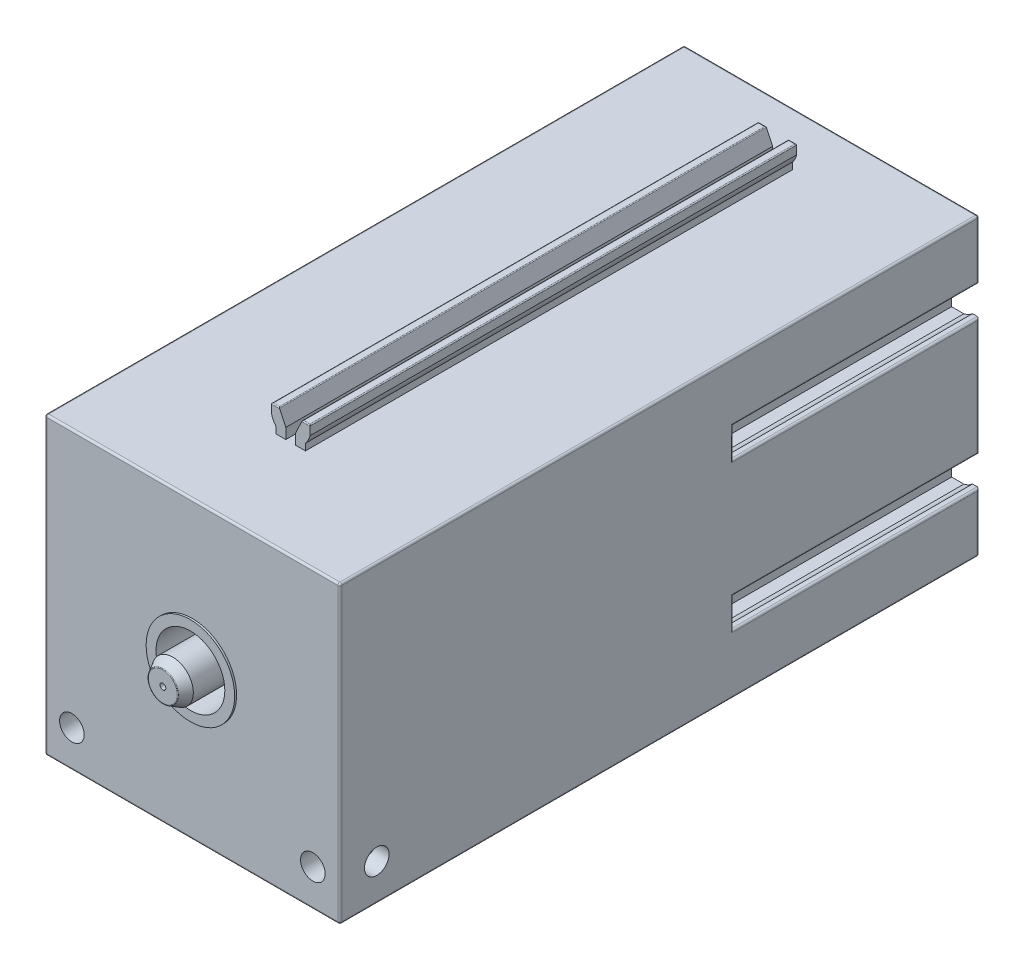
ISO-10303-21;
HEADER;
FILE_DESCRIPTION(('STEP AP214'),'2;1');
FILE_NAME('part.step','',(''),(''),'','','');
FILE_SCHEMA(('AUTOMOTIVE_DESIGN { 1 0 10303 214 1 1 1 1 }'));
ENDSEC;
DATA;
#1=APPLICATION_CONTEXT('core data for automotive mechanical design processes');
#2=APPLICATION_PROTOCOL_DEFINITION('international standard','automotive_design',2000,#1);
#3=PRODUCT_CONTEXT('',#1,'mechanical');
#4=PRODUCT('Part','Part','',(#3));
#5=PRODUCT_RELATED_PRODUCT_CATEGORY('part','',(#4));
#6=PRODUCT_DEFINITION_FORMATION('','',#4);
#7=PRODUCT_DEFINITION_CONTEXT('part definition',#1,'design');
#8=PRODUCT_DEFINITION('design','',#6,#7);
#9=PRODUCT_DEFINITION_SHAPE('','',#8);
#10=(LENGTH_UNIT() NAMED_UNIT(*) SI_UNIT(.MILLI.,.METRE.));
#11=(NAMED_UNIT(*) PLANE_ANGLE_UNIT() SI_UNIT($,.RADIAN.));
#12=(NAMED_UNIT(*) SI_UNIT($,.STERADIAN.) SOLID_ANGLE_UNIT());
#13=UNCERTAINTY_MEASURE_WITH_UNIT(LENGTH_MEASURE(1.E-05),#10,'distance_accuracy_value','');
#14=(GEOMETRIC_REPRESENTATION_CONTEXT(3) GLOBAL_UNCERTAINTY_ASSIGNED_CONTEXT((#13)) GLOBAL_UNIT_ASSIGNED_CONTEXT((#10,
#11,#12)) REPRESENTATION_CONTEXT('',''));
#15=CARTESIAN_POINT('',(0.,0.,0.));
#16=DIRECTION('',(0.,0.,1.));
#17=DIRECTION('',(1.,0.,0.));
#18=AXIS2_PLACEMENT_3D('',#15,#16,#17);
#19=CARTESIAN_POINT('',(-12.25,3.75,-5.));
#20=DIRECTION('',(0.,0.,1.));
#21=DIRECTION('',(1.,0.,0.));
#22=AXIS2_PLACEMENT_3D('',#19,#20,#21);
#23=CYLINDRICAL_SURFACE('',#22,1.25);
#24=CARTESIAN_POINT('',(-12.25,3.75,0.));
#25=DIRECTION('',(0.,0.,1.));
#26=DIRECTION('',(1.,0.,0.));
#27=AXIS2_PLACEMENT_3D('',#24,#25,#26);
#28=CIRCLE('',#27,1.25);
#29=CARTESIAN_POINT('',(-11.,3.75,0.));
#30=VERTEX_POINT('',#29);
#31=EDGE_CURVE('E654',#30,#30,#28,.T.);
#32=ORIENTED_EDGE('',*,*,#31,.T.);
#33=EDGE_LOOP('',(#32));
#34=FACE_BOUND('',#33,.T.);
#35=CARTESIAN_POINT('',(-12.25,3.75,-3.75));
#36=DIRECTION('',(0.707106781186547,0.,0.707106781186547));
#37=DIRECTION('',(-0.707106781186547,0.,0.707106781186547));
#38=AXIS2_PLACEMENT_3D('',#35,#36,#37);
#39=ELLIPSE('',#38,1.76776695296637,1.25);
#40=CARTESIAN_POINT('',(-12.25,2.5,-3.75));
#41=VERTEX_POINT('',#40);
#42=CARTESIAN_POINT('',(-12.25,5.,-3.75));
#43=VERTEX_POINT('',#42);
#44=EDGE_CURVE('E52',#41,#43,#39,.F.);
#45=ORIENTED_EDGE('',*,*,#44,.T.);
#46=CARTESIAN_POINT('',(-12.25,3.75,-3.75));
#47=DIRECTION('',(-0.707106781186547,0.,0.707106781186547));
#48=DIRECTION('',(0.707106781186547,0.,0.707106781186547));
#49=AXIS2_PLACEMENT_3D('',#46,#47,#48);
#50=ELLIPSE('',#49,1.76776695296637,1.25);
#51=EDGE_CURVE('E636',#43,#41,#50,.F.);
#52=ORIENTED_EDGE('',*,*,#51,.T.);
#53=EDGE_LOOP('',(#45,#52));
#54=FACE_BOUND('',#53,.T.);
#55=ADVANCED_FACE('F36',(#34,#54),#23,.F.);
#56=CARTESIAN_POINT('',(12.25,3.75,-5.));
#57=DIRECTION('',(0.,0.,1.));
#58=DIRECTION('',(1.,0.,0.));
#59=AXIS2_PLACEMENT_3D('',#56,#57,#58);
#60=CYLINDRICAL_SURFACE('',#59,1.25);
#61=CARTESIAN_POINT('',(12.25,3.75,0.));
#62=DIRECTION('',(0.,0.,1.));
#63=DIRECTION('',(1.,0.,0.));
#64=AXIS2_PLACEMENT_3D('',#61,#62,#63);
#65=CIRCLE('',#64,1.25);
#66=CARTESIAN_POINT('',(13.5,3.75,0.));
#67=VERTEX_POINT('',#66);
#68=EDGE_CURVE('E663',#67,#67,#65,.T.);
#69=ORIENTED_EDGE('',*,*,#68,.T.);
#70=EDGE_LOOP('',(#69));
#71=FACE_BOUND('',#70,.T.);
#72=CARTESIAN_POINT('',(12.25,3.75,-3.75));
#73=DIRECTION('',(-0.707106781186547,0.,0.707106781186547));
#74=DIRECTION('',(0.707106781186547,0.,0.707106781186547));
#75=AXIS2_PLACEMENT_3D('',#72,#73,#74);
#76=ELLIPSE('',#75,1.76776695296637,1.25);
#77=CARTESIAN_POINT('',(12.25,5.,-3.75));
#78=VERTEX_POINT('',#77);
#79=CARTESIAN_POINT('',(12.25,2.5,-3.75));
#80=VERTEX_POINT('',#79);
#81=EDGE_CURVE('E59',#78,#80,#76,.F.);
#82=ORIENTED_EDGE('',*,*,#81,.T.);
#83=CARTESIAN_POINT('',(12.25,3.75,-3.75));
#84=DIRECTION('',(0.707106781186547,0.,0.707106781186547));
#85=DIRECTION('',(-0.707106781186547,0.,0.707106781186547));
#86=AXIS2_PLACEMENT_3D('',#83,#84,#85);
#87=ELLIPSE('',#86,1.76776695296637,1.25);
#88=EDGE_CURVE('E1876',#80,#78,#87,.F.);
#89=ORIENTED_EDGE('',*,*,#88,.T.);
#90=EDGE_LOOP('',(#82,#89));
#91=FACE_BOUND('',#90,.T.);
#92=ADVANCED_FACE('F1806',(#71,#91),#60,.F.);
#93=CARTESIAN_POINT('',(0.,15.,-5.));
#94=DIRECTION('',(0.,0.,1.));
#95=DIRECTION('',(1.,0.,0.));
#96=AXIS2_PLACEMENT_3D('',#93,#94,#95);
#97=PLANE('',#96);
#98=CARTESIAN_POINT('',(0.,15.,-5.));
#99=DIRECTION('',(0.,0.,1.));
#100=DIRECTION('',(1.,0.,0.));
#101=AXIS2_PLACEMENT_3D('',#98,#99,#100);
#102=CIRCLE('',#101,3.5);
#103=CARTESIAN_POINT('',(3.5,15.,-5.));
#104=VERTEX_POINT('',#103);
#105=EDGE_CURVE('E683',#104,#104,#102,.T.);
#106=ORIENTED_EDGE('',*,*,#105,.T.);
#107=EDGE_LOOP('',(#106));
#108=FACE_BOUND('',#107,.T.);
#109=CARTESIAN_POINT('',(0.,15.,-5.));
#110=DIRECTION('',(0.,0.,1.));
#111=DIRECTION('',(1.,0.,0.));
#112=AXIS2_PLACEMENT_3D('',#109,#110,#111);
#113=CIRCLE('',#112,2.1);
#114=CARTESIAN_POINT('',(2.1,15.,-5.));
#115=VERTEX_POINT('',#114);
#116=EDGE_CURVE('E671',#115,#115,#113,.T.);
#117=ORIENTED_EDGE('',*,*,#116,.F.);
#118=EDGE_LOOP('',(#117));
#119=FACE_BOUND('',#118,.T.);
#120=ADVANCED_FACE('F1812',(#108,#119),#97,.T.);
#121=CARTESIAN_POINT('',(-15.,30.,0.));
#122=DIRECTION('',(0.,0.,-1.));
#123=DIRECTION('',(-1.,0.,0.));
#124=AXIS2_PLACEMENT_3D('',#121,#122,#123);
#125=PLANE('',#124);
#126=ORIENTED_EDGE('',*,*,#68,.F.);
#127=EDGE_LOOP('',(#126));
#128=FACE_BOUND('',#127,.T.);
#129=ORIENTED_EDGE('',*,*,#31,.F.);
#130=EDGE_LOOP('',(#129));
#131=FACE_BOUND('',#130,.T.);
#132=DIRECTION('',(0.,-1.,0.));
#133=VECTOR('',#132,1.);
#134=CARTESIAN_POINT('',(-14.8,0.,0.));
#135=LINE('',#134,#133);
#136=CARTESIAN_POINT('',(-14.8,29.8,0.));
#137=VERTEX_POINT('',#136);
#138=CARTESIAN_POINT('',(-14.8,0.199999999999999,0.));
#139=VERTEX_POINT('',#138);
#140=EDGE_CURVE('E1220',#137,#139,#135,.T.);
#141=ORIENTED_EDGE('',*,*,#140,.T.);
#142=DIRECTION('',(1.,0.,0.));
#143=VECTOR('',#142,1.);
#144=CARTESIAN_POINT('',(15.,0.199999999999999,0.));
#145=LINE('',#144,#143);
#146=CARTESIAN_POINT('',(14.8,0.199999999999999,0.));
#147=VERTEX_POINT('',#146);
#148=EDGE_CURVE('E1222',#139,#147,#145,.T.);
#149=ORIENTED_EDGE('',*,*,#148,.T.);
#150=DIRECTION('',(0.,1.,0.));
#151=VECTOR('',#150,1.);
#152=CARTESIAN_POINT('',(14.8,30.,0.));
#153=LINE('',#152,#151);
#154=CARTESIAN_POINT('',(14.8,29.8,0.));
#155=VERTEX_POINT('',#154);
#156=EDGE_CURVE('E1218',#147,#155,#153,.T.);
#157=ORIENTED_EDGE('',*,*,#156,.T.);
#158=DIRECTION('',(-1.,0.,0.));
#159=VECTOR('',#158,1.);
#160=CARTESIAN_POINT('',(-15.,29.8,0.));
#161=LINE('',#160,#159);
#162=EDGE_CURVE('E1216',#155,#137,#161,.T.);
#163=ORIENTED_EDGE('',*,*,#162,.T.);
#164=EDGE_LOOP('',(#141,#149,#157,#163));
#165=FACE_BOUND('',#164,.T.);
#166=CARTESIAN_POINT('',(0.,15.,0.));
#167=DIRECTION('',(0.,0.,-1.));
#168=DIRECTION('',(-1.,0.,0.));
#169=AXIS2_PLACEMENT_3D('',#166,#167,#168);
#170=CIRCLE('',#169,4.5);
#171=CARTESIAN_POINT('',(-4.5,15.,0.));
#172=VERTEX_POINT('',#171);
#173=EDGE_CURVE('E1140',#172,#172,#170,.F.);
#174=ORIENTED_EDGE('',*,*,#173,.F.);
#175=EDGE_LOOP('',(#174));
#176=FACE_BOUND('',#175,.T.);
#177=ADVANCED_FACE('F2591',(#128,#131,#165,#176),#125,.F.);
#178=CARTESIAN_POINT('',(-15.,30.,-65.));
#179=DIRECTION('',(0.,1.,0.));
#180=DIRECTION('',(0.,0.,1.));
#181=AXIS2_PLACEMENT_3D('',#178,#179,#180);
#182=PLANE('',#181);
#183=DIRECTION('',(0.,0.,1.));
#184=VECTOR('',#183,1.);
#185=CARTESIAN_POINT('',(-14.8,30.,-65.));
#186=LINE('',#185,#184);
#187=CARTESIAN_POINT('',(-14.8,30.,-64.8));
#188=VERTEX_POINT('',#187);
#189=CARTESIAN_POINT('',(-14.8,30.,-0.2));
#190=VERTEX_POINT('',#189);
#191=EDGE_CURVE('E1272',#188,#190,#186,.T.);
#192=ORIENTED_EDGE('',*,*,#191,.T.);
#193=DIRECTION('',(-1.,0.,0.));
#194=VECTOR('',#193,1.);
#195=CARTESIAN_POINT('',(15.,30.,-0.2));
#196=LINE('',#195,#194);
#197=CARTESIAN_POINT('',(14.8,30.,-0.2));
#198=VERTEX_POINT('',#197);
#199=EDGE_CURVE('E1275',#190,#198,#196,.F.);
#200=ORIENTED_EDGE('',*,*,#199,.T.);
#201=DIRECTION('',(0.,0.,1.));
#202=VECTOR('',#201,1.);
#203=CARTESIAN_POINT('',(14.8,30.,-65.));
#204=LINE('',#203,#202);
#205=CARTESIAN_POINT('',(14.8,30.,-64.8));
#206=VERTEX_POINT('',#205);
#207=EDGE_CURVE('E1270',#198,#206,#204,.F.);
#208=ORIENTED_EDGE('',*,*,#207,.T.);
#209=DIRECTION('',(-1.,0.,0.));
#210=VECTOR('',#209,1.);
#211=CARTESIAN_POINT('',(-15.,30.,-64.8));
#212=LINE('',#211,#210);
#213=EDGE_CURVE('E1268',#206,#188,#212,.T.);
#214=ORIENTED_EDGE('',*,*,#213,.T.);
#215=EDGE_LOOP('',(#192,#200,#208,#214));
#216=FACE_BOUND('',#215,.T.);
#217=DIRECTION('',(0.,0.,-1.));
#218=VECTOR('',#217,1.);
#219=CARTESIAN_POINT('',(1.5,30.,-10.));
#220=LINE('',#219,#218);
#221=CARTESIAN_POINT('',(1.5,30.,-10.));
#222=VERTEX_POINT('',#221);
#223=CARTESIAN_POINT('',(1.5,30.,-59.5));
#224=VERTEX_POINT('',#223);
#225=EDGE_CURVE('E770',#222,#224,#220,.T.);
#226=ORIENTED_EDGE('',*,*,#225,.F.);
#227=DIRECTION('',(-1.,0.,0.));
#228=VECTOR('',#227,1.);
#229=CARTESIAN_POINT('',(1.5,30.,-10.));
#230=LINE('',#229,#228);
#231=CARTESIAN_POINT('',(0.5,30.,-10.));
#232=VERTEX_POINT('',#231);
#233=EDGE_CURVE('E749',#222,#232,#230,.T.);
#234=ORIENTED_EDGE('',*,*,#233,.T.);
#235=DIRECTION('',(0.,0.,-1.));
#236=VECTOR('',#235,1.);
#237=CARTESIAN_POINT('',(0.5,30.,-10.));
#238=LINE('',#237,#236);
#239=CARTESIAN_POINT('',(0.5,30.,-59.5));
#240=VERTEX_POINT('',#239);
#241=EDGE_CURVE('E767',#232,#240,#238,.T.);
#242=ORIENTED_EDGE('',*,*,#241,.T.);
#243=DIRECTION('',(-1.,0.,0.));
#244=VECTOR('',#243,1.);
#245=CARTESIAN_POINT('',(1.5,30.,-59.5));
#246=LINE('',#245,#244);
#247=EDGE_CURVE('E738',#224,#240,#246,.T.);
#248=ORIENTED_EDGE('',*,*,#247,.F.);
#249=EDGE_LOOP('',(#226,#234,#242,#248));
#250=FACE_BOUND('',#249,.T.);
#251=DIRECTION('',(0.,0.,-1.));
#252=VECTOR('',#251,1.);
#253=CARTESIAN_POINT('',(-0.5,30.,-10.));
#254=LINE('',#253,#252);
#255=CARTESIAN_POINT('',(-0.5,30.,-10.));
#256=VERTEX_POINT('',#255);
#257=CARTESIAN_POINT('',(-0.5,30.,-59.5));
#258=VERTEX_POINT('',#257);
#259=EDGE_CURVE('E727',#256,#258,#254,.T.);
#260=ORIENTED_EDGE('',*,*,#259,.F.);
#261=DIRECTION('',(-1.,0.,0.));
#262=VECTOR('',#261,1.);
#263=CARTESIAN_POINT('',(-0.5,30.,-10.));
#264=LINE('',#263,#262);
#265=CARTESIAN_POINT('',(-1.5,30.,-10.));
#266=VERTEX_POINT('',#265);
#267=EDGE_CURVE('E699',#256,#266,#264,.T.);
#268=ORIENTED_EDGE('',*,*,#267,.T.);
#269=DIRECTION('',(0.,0.,-1.));
#270=VECTOR('',#269,1.);
#271=CARTESIAN_POINT('',(-1.5,30.,-10.));
#272=LINE('',#271,#270);
#273=CARTESIAN_POINT('',(-1.5,30.,-59.5));
#274=VERTEX_POINT('',#273);
#275=EDGE_CURVE('E725',#266,#274,#272,.T.);
#276=ORIENTED_EDGE('',*,*,#275,.T.);
#277=DIRECTION('',(-1.,0.,0.));
#278=VECTOR('',#277,1.);
#279=CARTESIAN_POINT('',(-0.5,30.,-59.5));
#280=LINE('',#279,#278);
#281=EDGE_CURVE('E717',#258,#274,#280,.T.);
#282=ORIENTED_EDGE('',*,*,#281,.F.);
#283=EDGE_LOOP('',(#260,#268,#276,#282));
#284=FACE_BOUND('',#283,.T.);
#285=ADVANCED_FACE('F1697',(#216,#250,#284),#182,.T.);
#286=CARTESIAN_POINT('',(-15.,0.,-65.));
#287=DIRECTION('',(-1.,0.,0.));
#288=DIRECTION('',(0.,0.,1.));
#289=AXIS2_PLACEMENT_3D('',#286,#287,#288);
#290=PLANE('',#289);
#291=CARTESIAN_POINT('',(-15.,3.75,-3.75));
#292=DIRECTION('',(-1.,0.,0.));
#293=DIRECTION('',(0.,0.,1.));
#294=AXIS2_PLACEMENT_3D('',#291,#292,#293);
#295=CIRCLE('',#294,1.25);
#296=CARTESIAN_POINT('',(-15.,3.75,-2.5));
#297=VERTEX_POINT('',#296);
#298=EDGE_CURVE('E1855',#297,#297,#295,.T.);
#299=ORIENTED_EDGE('',*,*,#298,.F.);
#300=EDGE_LOOP('',(#299));
#301=FACE_BOUND('',#300,.T.);
#302=DIRECTION('',(0.,0.,-1.));
#303=VECTOR('',#302,1.);
#304=CARTESIAN_POINT('',(-15.,20.8,-65.));
#305=LINE('',#304,#303);
#306=CARTESIAN_POINT('',(-15.,20.8,-39.8));
#307=VERTEX_POINT('',#306);
#308=CARTESIAN_POINT('',(-15.,20.8,-64.8));
#309=VERTEX_POINT('',#308);
#310=EDGE_CURVE('E1257',#307,#309,#305,.T.);
#311=ORIENTED_EDGE('',*,*,#310,.T.);
#312=DIRECTION('',(0.,-1.,0.));
#313=VECTOR('',#312,1.);
#314=CARTESIAN_POINT('',(-15.,0.,-64.8));
#315=LINE('',#314,#313);
#316=CARTESIAN_POINT('',(-15.,9.2,-64.8));
#317=VERTEX_POINT('',#316);
#318=EDGE_CURVE('E1259',#309,#317,#315,.T.);
#319=ORIENTED_EDGE('',*,*,#318,.T.);
#320=DIRECTION('',(0.,0.,-1.));
#321=VECTOR('',#320,1.);
#322=CARTESIAN_POINT('',(-15.,9.2,-40.));
#323=LINE('',#322,#321);
#324=CARTESIAN_POINT('',(-15.,9.2,-39.8));
#325=VERTEX_POINT('',#324);
#326=EDGE_CURVE('E1237',#317,#325,#323,.F.);
#327=ORIENTED_EDGE('',*,*,#326,.T.);
#328=DIRECTION('',(0.,1.,0.));
#329=VECTOR('',#328,1.);
#330=CARTESIAN_POINT('',(-15.,6.,-39.8));
#331=LINE('',#330,#329);
#332=CARTESIAN_POINT('',(-15.,5.8,-39.8));
#333=VERTEX_POINT('',#332);
#334=EDGE_CURVE('E1239',#325,#333,#331,.F.);
#335=ORIENTED_EDGE('',*,*,#334,.T.);
#336=DIRECTION('',(0.,0.,-1.));
#337=VECTOR('',#336,1.);
#338=CARTESIAN_POINT('',(-15.,5.8,-65.));
#339=LINE('',#338,#337);
#340=CARTESIAN_POINT('',(-15.,5.8,-64.8));
#341=VERTEX_POINT('',#340);
#342=EDGE_CURVE('E1241',#333,#341,#339,.T.);
#343=ORIENTED_EDGE('',*,*,#342,.T.);
#344=DIRECTION('',(0.,-1.,0.));
#345=VECTOR('',#344,1.);
#346=CARTESIAN_POINT('',(-15.,0.,-64.8));
#347=LINE('',#346,#345);
#348=CARTESIAN_POINT('',(-15.,0.2,-64.8));
#349=VERTEX_POINT('',#348);
#350=EDGE_CURVE('E1243',#341,#349,#347,.T.);
#351=ORIENTED_EDGE('',*,*,#350,.T.);
#352=DIRECTION('',(0.,0.,1.));
#353=VECTOR('',#352,1.);
#354=CARTESIAN_POINT('',(-15.,0.2,-65.));
#355=LINE('',#354,#353);
#356=CARTESIAN_POINT('',(-15.,0.2,-0.2));
#357=VERTEX_POINT('',#356);
#358=EDGE_CURVE('E1245',#349,#357,#355,.T.);
#359=ORIENTED_EDGE('',*,*,#358,.T.);
#360=DIRECTION('',(0.,-1.,0.));
#361=VECTOR('',#360,1.);
#362=CARTESIAN_POINT('',(-15.,30.,-0.2));
#363=LINE('',#362,#361);
#364=CARTESIAN_POINT('',(-15.,29.8,-0.2));
#365=VERTEX_POINT('',#364);
#366=EDGE_CURVE('E1247',#357,#365,#363,.F.);
#367=ORIENTED_EDGE('',*,*,#366,.T.);
#368=DIRECTION('',(0.,0.,1.));
#369=VECTOR('',#368,1.);
#370=CARTESIAN_POINT('',(-15.,29.8,-65.));
#371=LINE('',#370,#369);
#372=CARTESIAN_POINT('',(-15.,29.8,-64.8));
#373=VERTEX_POINT('',#372);
#374=EDGE_CURVE('E1249',#365,#373,#371,.F.);
#375=ORIENTED_EDGE('',*,*,#374,.T.);
#376=DIRECTION('',(0.,-1.,0.));
#377=VECTOR('',#376,1.);
#378=CARTESIAN_POINT('',(-15.,0.,-64.8));
#379=LINE('',#378,#377);
#380=CARTESIAN_POINT('',(-15.,24.2,-64.8));
#381=VERTEX_POINT('',#380);
#382=EDGE_CURVE('E1251',#373,#381,#379,.T.);
#383=ORIENTED_EDGE('',*,*,#382,.T.);
#384=DIRECTION('',(0.,0.,-1.));
#385=VECTOR('',#384,1.);
#386=CARTESIAN_POINT('',(-15.,24.2,-40.));
#387=LINE('',#386,#385);
#388=CARTESIAN_POINT('',(-15.,24.2,-39.8));
#389=VERTEX_POINT('',#388);
#390=EDGE_CURVE('E1253',#381,#389,#387,.F.);
#391=ORIENTED_EDGE('',*,*,#390,.T.);
#392=DIRECTION('',(0.,1.,0.));
#393=VECTOR('',#392,1.);
#394=CARTESIAN_POINT('',(-15.,0.,-39.8));
#395=LINE('',#394,#393);
#396=EDGE_CURVE('E1255',#389,#307,#395,.F.);
#397=ORIENTED_EDGE('',*,*,#396,.T.);
#398=EDGE_LOOP('',(#311,#319,#327,#335,#343,#351,#359,#367,#375,#383,#391,#397));
#399=FACE_BOUND('',#398,.T.);
#400=ADVANCED_FACE('F1665',(#301,#399),#290,.T.);
#401=CARTESIAN_POINT('',(15.,0.,-65.));
#402=DIRECTION('',(1.,0.,0.));
#403=DIRECTION('',(0.,0.,-1.));
#404=AXIS2_PLACEMENT_3D('',#401,#402,#403);
#405=PLANE('',#404);
#406=CARTESIAN_POINT('',(15.,3.75,-3.75));
#407=DIRECTION('',(1.,0.,0.));
#408=DIRECTION('',(0.,0.,-1.));
#409=AXIS2_PLACEMENT_3D('',#406,#407,#408);
#410=CIRCLE('',#409,1.25);
#411=CARTESIAN_POINT('',(15.,3.75,-5.));
#412=VERTEX_POINT('',#411);
#413=EDGE_CURVE('E650',#412,#412,#410,.T.);
#414=ORIENTED_EDGE('',*,*,#413,.F.);
#415=EDGE_LOOP('',(#414));
#416=FACE_BOUND('',#415,.T.);
#417=DIRECTION('',(0.,0.,-1.));
#418=VECTOR('',#417,1.);
#419=CARTESIAN_POINT('',(15.,9.2,-65.));
#420=LINE('',#419,#418);
#421=CARTESIAN_POINT('',(15.,9.2,-39.8));
#422=VERTEX_POINT('',#421);
#423=CARTESIAN_POINT('',(15.,9.2,-64.8));
#424=VERTEX_POINT('',#423);
#425=EDGE_CURVE('E1303',#422,#424,#420,.T.);
#426=ORIENTED_EDGE('',*,*,#425,.T.);
#427=DIRECTION('',(0.,1.,0.));
#428=VECTOR('',#427,1.);
#429=CARTESIAN_POINT('',(15.,0.,-64.8));
#430=LINE('',#429,#428);
#431=CARTESIAN_POINT('',(15.,20.8,-64.8));
#432=VERTEX_POINT('',#431);
#433=EDGE_CURVE('E1305',#424,#432,#430,.T.);
#434=ORIENTED_EDGE('',*,*,#433,.T.);
#435=DIRECTION('',(0.,0.,-1.));
#436=VECTOR('',#435,1.);
#437=CARTESIAN_POINT('',(15.,20.8,-40.));
#438=LINE('',#437,#436);
#439=CARTESIAN_POINT('',(15.,20.8,-39.8));
#440=VERTEX_POINT('',#439);
#441=EDGE_CURVE('E1283',#432,#440,#438,.F.);
#442=ORIENTED_EDGE('',*,*,#441,.T.);
#443=DIRECTION('',(0.,-1.,0.));
#444=VECTOR('',#443,1.);
#445=CARTESIAN_POINT('',(15.,24.,-39.8));
#446=LINE('',#445,#444);
#447=CARTESIAN_POINT('',(15.,24.2,-39.8));
#448=VERTEX_POINT('',#447);
#449=EDGE_CURVE('E1285',#440,#448,#446,.F.);
#450=ORIENTED_EDGE('',*,*,#449,.T.);
#451=DIRECTION('',(0.,0.,-1.));
#452=VECTOR('',#451,1.);
#453=CARTESIAN_POINT('',(15.,24.2,-65.));
#454=LINE('',#453,#452);
#455=CARTESIAN_POINT('',(15.,24.2,-64.8));
#456=VERTEX_POINT('',#455);
#457=EDGE_CURVE('E1287',#448,#456,#454,.T.);
#458=ORIENTED_EDGE('',*,*,#457,.T.);
#459=DIRECTION('',(0.,1.,0.));
#460=VECTOR('',#459,1.);
#461=CARTESIAN_POINT('',(15.,0.,-64.8));
#462=LINE('',#461,#460);
#463=CARTESIAN_POINT('',(15.,29.8,-64.8));
#464=VERTEX_POINT('',#463);
#465=EDGE_CURVE('E1289',#456,#464,#462,.T.);
#466=ORIENTED_EDGE('',*,*,#465,.T.);
#467=DIRECTION('',(0.,0.,1.));
#468=VECTOR('',#467,1.);
#469=CARTESIAN_POINT('',(15.,29.8,-65.));
#470=LINE('',#469,#468);
#471=CARTESIAN_POINT('',(15.,29.8,-0.2));
#472=VERTEX_POINT('',#471);
#473=EDGE_CURVE('E1291',#464,#472,#470,.T.);
#474=ORIENTED_EDGE('',*,*,#473,.T.);
#475=DIRECTION('',(0.,1.,0.));
#476=VECTOR('',#475,1.);
#477=CARTESIAN_POINT('',(15.,0.,-0.2));
#478=LINE('',#477,#476);
#479=CARTESIAN_POINT('',(15.,0.2,-0.2));
#480=VERTEX_POINT('',#479);
#481=EDGE_CURVE('E1293',#472,#480,#478,.F.);
#482=ORIENTED_EDGE('',*,*,#481,.T.);
#483=DIRECTION('',(0.,0.,1.));
#484=VECTOR('',#483,1.);
#485=CARTESIAN_POINT('',(15.,0.2,-65.));
#486=LINE('',#485,#484);
#487=CARTESIAN_POINT('',(15.,0.2,-64.8));
#488=VERTEX_POINT('',#487);
#489=EDGE_CURVE('E1295',#480,#488,#486,.F.);
#490=ORIENTED_EDGE('',*,*,#489,.T.);
#491=DIRECTION('',(0.,1.,0.));
#492=VECTOR('',#491,1.);
#493=CARTESIAN_POINT('',(15.,0.,-64.8));
#494=LINE('',#493,#492);
#495=CARTESIAN_POINT('',(15.,5.8,-64.8));
#496=VERTEX_POINT('',#495);
#497=EDGE_CURVE('E1297',#488,#496,#494,.T.);
#498=ORIENTED_EDGE('',*,*,#497,.T.);
#499=DIRECTION('',(0.,0.,-1.));
#500=VECTOR('',#499,1.);
#501=CARTESIAN_POINT('',(15.,5.8,-40.));
#502=LINE('',#501,#500);
#503=CARTESIAN_POINT('',(15.,5.8,-39.8));
#504=VERTEX_POINT('',#503);
#505=EDGE_CURVE('E1299',#496,#504,#502,.F.);
#506=ORIENTED_EDGE('',*,*,#505,.T.);
#507=DIRECTION('',(0.,-1.,0.));
#508=VECTOR('',#507,1.);
#509=CARTESIAN_POINT('',(15.,0.,-39.8));
#510=LINE('',#509,#508);
#511=EDGE_CURVE('E1301',#504,#422,#510,.F.);
#512=ORIENTED_EDGE('',*,*,#511,.T.);
#513=EDGE_LOOP('',(#426,#434,#442,#450,#458,#466,#474,#482,#490,#498,#506,#512));
#514=FACE_BOUND('',#513,.T.);
#515=ADVANCED_FACE('F1500',(#416,#514),#405,.T.);
#516=CARTESIAN_POINT('',(-15.,0.,-65.));
#517=DIRECTION('',(0.,-1.,0.));
#518=DIRECTION('',(0.,0.,-1.));
#519=AXIS2_PLACEMENT_3D('',#516,#517,#518);
#520=PLANE('',#519);
#521=DIRECTION('',(0.,0.,-1.));
#522=VECTOR('',#521,1.);
#523=CARTESIAN_POINT('',(5.8,0.,-11.));
#524=LINE('',#523,#522);
#525=CARTESIAN_POINT('',(5.8,0.,-64.8));
#526=VERTEX_POINT('',#525);
#527=CARTESIAN_POINT('',(5.8,0.,-10.8));
#528=VERTEX_POINT('',#527);
#529=EDGE_CURVE('E1191',#526,#528,#524,.F.);
#530=ORIENTED_EDGE('',*,*,#529,.T.);
#531=DIRECTION('',(-1.,0.,0.));
#532=VECTOR('',#531,1.);
#533=CARTESIAN_POINT('',(-15.,0.,-10.8));
#534=LINE('',#533,#532);
#535=CARTESIAN_POINT('',(9.2,0.,-10.8));
#536=VERTEX_POINT('',#535);
#537=EDGE_CURVE('E1193',#528,#536,#534,.F.);
#538=ORIENTED_EDGE('',*,*,#537,.T.);
#539=DIRECTION('',(0.,0.,-1.));
#540=VECTOR('',#539,1.);
#541=CARTESIAN_POINT('',(9.2,0.,-65.));
#542=LINE('',#541,#540);
#543=CARTESIAN_POINT('',(9.2,0.,-64.8));
#544=VERTEX_POINT('',#543);
#545=EDGE_CURVE('E1178',#536,#544,#542,.T.);
#546=ORIENTED_EDGE('',*,*,#545,.T.);
#547=DIRECTION('',(1.,0.,0.));
#548=VECTOR('',#547,1.);
#549=CARTESIAN_POINT('',(-15.,0.,-64.8));
#550=LINE('',#549,#548);
#551=CARTESIAN_POINT('',(14.8,0.,-64.8));
#552=VERTEX_POINT('',#551);
#553=EDGE_CURVE('E1172',#544,#552,#550,.T.);
#554=ORIENTED_EDGE('',*,*,#553,.T.);
#555=DIRECTION('',(0.,0.,1.));
#556=VECTOR('',#555,1.);
#557=CARTESIAN_POINT('',(14.8,0.,-65.));
#558=LINE('',#557,#556);
#559=CARTESIAN_POINT('',(14.8,0.,-0.2));
#560=VERTEX_POINT('',#559);
#561=EDGE_CURVE('E1170',#552,#560,#558,.T.);
#562=ORIENTED_EDGE('',*,*,#561,.T.);
#563=DIRECTION('',(1.,0.,0.));
#564=VECTOR('',#563,1.);
#565=CARTESIAN_POINT('',(-15.,0.,-0.2));
#566=LINE('',#565,#564);
#567=CARTESIAN_POINT('',(-14.8,0.,-0.2));
#568=VERTEX_POINT('',#567);
#569=EDGE_CURVE('E1174',#560,#568,#566,.F.);
#570=ORIENTED_EDGE('',*,*,#569,.T.);
#571=DIRECTION('',(0.,0.,1.));
#572=VECTOR('',#571,1.);
#573=CARTESIAN_POINT('',(-14.8,0.,-65.));
#574=LINE('',#573,#572);
#575=CARTESIAN_POINT('',(-14.8,0.,-64.8));
#576=VERTEX_POINT('',#575);
#577=EDGE_CURVE('E1176',#568,#576,#574,.F.);
#578=ORIENTED_EDGE('',*,*,#577,.T.);
#579=DIRECTION('',(1.,0.,0.));
#580=VECTOR('',#579,1.);
#581=CARTESIAN_POINT('',(-15.,0.,-64.8));
#582=LINE('',#581,#580);
#583=CARTESIAN_POINT('',(-9.2,0.,-64.8));
#584=VERTEX_POINT('',#583);
#585=EDGE_CURVE('E1180',#576,#584,#582,.T.);
#586=ORIENTED_EDGE('',*,*,#585,.T.);
#587=DIRECTION('',(0.,0.,-1.));
#588=VECTOR('',#587,1.);
#589=CARTESIAN_POINT('',(-9.2,0.,-11.));
#590=LINE('',#589,#588);
#591=CARTESIAN_POINT('',(-9.2,0.,-10.8));
#592=VERTEX_POINT('',#591);
#593=EDGE_CURVE('E1183',#584,#592,#590,.F.);
#594=ORIENTED_EDGE('',*,*,#593,.T.);
#595=DIRECTION('',(-1.,0.,0.));
#596=VECTOR('',#595,1.);
#597=CARTESIAN_POINT('',(-6.,0.,-10.8));
#598=LINE('',#597,#596);
#599=CARTESIAN_POINT('',(-5.8,0.,-10.8));
#600=VERTEX_POINT('',#599);
#601=EDGE_CURVE('E1185',#592,#600,#598,.F.);
#602=ORIENTED_EDGE('',*,*,#601,.T.);
#603=DIRECTION('',(0.,0.,-1.));
#604=VECTOR('',#603,1.);
#605=CARTESIAN_POINT('',(-5.8,0.,-65.));
#606=LINE('',#605,#604);
#607=CARTESIAN_POINT('',(-5.8,0.,-64.8));
#608=VERTEX_POINT('',#607);
#609=EDGE_CURVE('E1187',#600,#608,#606,.T.);
#610=ORIENTED_EDGE('',*,*,#609,.T.);
#611=DIRECTION('',(1.,0.,0.));
#612=VECTOR('',#611,1.);
#613=CARTESIAN_POINT('',(-15.,0.,-64.8));
#614=LINE('',#613,#612);
#615=EDGE_CURVE('E1189',#608,#526,#614,.T.);
#616=ORIENTED_EDGE('',*,*,#615,.T.);
#617=EDGE_LOOP('',(#530,#538,#546,#554,#562,#570,#578,#586,#594,#602,#610,#616));
#618=FACE_BOUND('',#617,.T.);
#619=ADVANCED_FACE('F1900',(#618),#520,.T.);
#620=CARTESIAN_POINT('',(-15.,30.,-65.));
#621=DIRECTION('',(0.,0.,-1.));
#622=DIRECTION('',(-1.,0.,0.));
#623=AXIS2_PLACEMENT_3D('',#620,#621,#622);
#624=PLANE('',#623);
#625=DIRECTION('',(0.,1.,0.));
#626=VECTOR('',#625,1.);
#627=CARTESIAN_POINT('',(6.,0.677124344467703,-65.));
#628=LINE('',#627,#626);
#629=CARTESIAN_POINT('',(6.,0.2,-65.));
#630=VERTEX_POINT('',#629);
#631=CARTESIAN_POINT('',(6.,0.677124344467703,-65.));
#632=VERTEX_POINT('',#631);
#633=EDGE_CURVE('E1073',#630,#632,#628,.T.);
#634=ORIENTED_EDGE('',*,*,#633,.F.);
#635=DIRECTION('',(1.,0.,0.));
#636=VECTOR('',#635,1.);
#637=CARTESIAN_POINT('',(-15.,0.199999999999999,-65.));
#638=LINE('',#637,#636);
#639=CARTESIAN_POINT('',(-6.,0.2,-65.));
#640=VERTEX_POINT('',#639);
#641=EDGE_CURVE('E1214',#630,#640,#638,.F.);
#642=ORIENTED_EDGE('',*,*,#641,.T.);
#643=DIRECTION('',(0.,-1.,0.));
#644=VECTOR('',#643,1.);
#645=CARTESIAN_POINT('',(-6.,0.677124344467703,-65.));
#646=LINE('',#645,#644);
#647=CARTESIAN_POINT('',(-6.,0.677124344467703,-65.));
#648=VERTEX_POINT('',#647);
#649=EDGE_CURVE('E1026',#648,#640,#646,.T.);
#650=ORIENTED_EDGE('',*,*,#649,.F.);
#651=CARTESIAN_POINT('',(-7.5,2.,-65.));
#652=DIRECTION('',(0.,0.,-1.));
#653=DIRECTION('',(1.,0.,0.));
#654=AXIS2_PLACEMENT_3D('',#651,#652,#653);
#655=CIRCLE('',#654,2.);
#656=CARTESIAN_POINT('',(-5.55,1.55559027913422,-65.));
#657=VERTEX_POINT('',#656);
#658=EDGE_CURVE('E1023',#657,#648,#655,.T.);
#659=ORIENTED_EDGE('',*,*,#658,.F.);
#660=DIRECTION('',(0.,-1.,0.));
#661=VECTOR('',#660,1.);
#662=CARTESIAN_POINT('',(-5.55,2.8,-65.));
#663=LINE('',#662,#661);
#664=CARTESIAN_POINT('',(-5.55,2.8,-65.));
#665=VERTEX_POINT('',#664);
#666=EDGE_CURVE('E1020',#665,#657,#663,.T.);
#667=ORIENTED_EDGE('',*,*,#666,.F.);
#668=DIRECTION('',(1.,0.,0.));
#669=VECTOR('',#668,1.);
#670=CARTESIAN_POINT('',(-9.45,2.8,-65.));
#671=LINE('',#670,#669);
#672=CARTESIAN_POINT('',(-9.45,2.8,-65.));
#673=VERTEX_POINT('',#672);
#674=EDGE_CURVE('E1017',#673,#665,#671,.T.);
#675=ORIENTED_EDGE('',*,*,#674,.F.);
#676=DIRECTION('',(0.,1.,0.));
#677=VECTOR('',#676,1.);
#678=CARTESIAN_POINT('',(-9.45,2.8,-65.));
#679=LINE('',#678,#677);
#680=CARTESIAN_POINT('',(-9.45,1.55559027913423,-65.));
#681=VERTEX_POINT('',#680);
#682=EDGE_CURVE('E1014',#681,#673,#679,.T.);
#683=ORIENTED_EDGE('',*,*,#682,.F.);
#684=CARTESIAN_POINT('',(-7.5,2.,-65.));
#685=DIRECTION('',(0.,0.,-1.));
#686=DIRECTION('',(1.,0.,0.));
#687=AXIS2_PLACEMENT_3D('',#684,#685,#686);
#688=CIRCLE('',#687,2.);
#689=CARTESIAN_POINT('',(-9.,0.677124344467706,-65.));
#690=VERTEX_POINT('',#689);
#691=EDGE_CURVE('E979',#690,#681,#688,.T.);
#692=ORIENTED_EDGE('',*,*,#691,.F.);
#693=DIRECTION('',(0.,1.,0.));
#694=VECTOR('',#693,1.);
#695=CARTESIAN_POINT('',(-9.,0.677124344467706,-65.));
#696=LINE('',#695,#694);
#697=CARTESIAN_POINT('',(-9.,0.2,-65.));
#698=VERTEX_POINT('',#697);
#699=EDGE_CURVE('E995',#698,#690,#696,.T.);
#700=ORIENTED_EDGE('',*,*,#699,.F.);
#701=DIRECTION('',(1.,0.,0.));
#702=VECTOR('',#701,1.);
#703=CARTESIAN_POINT('',(-15.,0.199999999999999,-65.));
#704=LINE('',#703,#702);
#705=CARTESIAN_POINT('',(-14.8,0.2,-65.));
#706=VERTEX_POINT('',#705);
#707=EDGE_CURVE('E1209',#698,#706,#704,.F.);
#708=ORIENTED_EDGE('',*,*,#707,.T.);
#709=DIRECTION('',(0.,-1.,0.));
#710=VECTOR('',#709,1.);
#711=CARTESIAN_POINT('',(-14.8,30.,-65.));
#712=LINE('',#711,#710);
#713=CARTESIAN_POINT('',(-14.8,6.,-65.));
#714=VERTEX_POINT('',#713);
#715=EDGE_CURVE('E1207',#706,#714,#712,.F.);
#716=ORIENTED_EDGE('',*,*,#715,.T.);
#717=DIRECTION('',(-1.,0.,0.));
#718=VECTOR('',#717,1.);
#719=CARTESIAN_POINT('',(-15.,6.,-65.));
#720=LINE('',#719,#718);
#721=CARTESIAN_POINT('',(-14.3228756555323,6.,-65.));
#722=VERTEX_POINT('',#721);
#723=EDGE_CURVE('E814',#722,#714,#720,.T.);
#724=ORIENTED_EDGE('',*,*,#723,.F.);
#725=CARTESIAN_POINT('',(-13.,7.5,-65.));
#726=DIRECTION('',(0.,0.,-1.));
#727=DIRECTION('',(1.,0.,0.));
#728=AXIS2_PLACEMENT_3D('',#725,#726,#727);
#729=CIRCLE('',#728,2.);
#730=CARTESIAN_POINT('',(-13.4444097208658,5.55,-65.));
#731=VERTEX_POINT('',#730);
#732=EDGE_CURVE('E811',#731,#722,#729,.T.);
#733=ORIENTED_EDGE('',*,*,#732,.F.);
#734=DIRECTION('',(-1.,0.,0.));
#735=VECTOR('',#734,1.);
#736=CARTESIAN_POINT('',(-12.2,5.55,-65.));
#737=LINE('',#736,#735);
#738=CARTESIAN_POINT('',(-12.2,5.55,-65.));
#739=VERTEX_POINT('',#738);
#740=EDGE_CURVE('E808',#739,#731,#737,.T.);
#741=ORIENTED_EDGE('',*,*,#740,.F.);
#742=DIRECTION('',(0.,-1.,0.));
#743=VECTOR('',#742,1.);
#744=CARTESIAN_POINT('',(-12.2,9.45,-65.));
#745=LINE('',#744,#743);
#746=CARTESIAN_POINT('',(-12.2,9.45,-65.));
#747=VERTEX_POINT('',#746);
#748=EDGE_CURVE('E805',#747,#739,#745,.T.);
#749=ORIENTED_EDGE('',*,*,#748,.F.);
#750=DIRECTION('',(1.,0.,0.));
#751=VECTOR('',#750,1.);
#752=CARTESIAN_POINT('',(-12.2,9.45,-65.));
#753=LINE('',#752,#751);
#754=CARTESIAN_POINT('',(-13.4444097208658,9.45,-65.));
#755=VERTEX_POINT('',#754);
#756=EDGE_CURVE('E802',#755,#747,#753,.T.);
#757=ORIENTED_EDGE('',*,*,#756,.F.);
#758=CARTESIAN_POINT('',(-13.,7.5,-65.));
#759=DIRECTION('',(0.,0.,-1.));
#760=DIRECTION('',(1.,0.,0.));
#761=AXIS2_PLACEMENT_3D('',#758,#759,#760);
#762=CIRCLE('',#761,2.);
#763=CARTESIAN_POINT('',(-14.3228756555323,9.,-65.));
#764=VERTEX_POINT('',#763);
#765=EDGE_CURVE('E769',#764,#755,#762,.T.);
#766=ORIENTED_EDGE('',*,*,#765,.F.);
#767=DIRECTION('',(1.,0.,0.));
#768=VECTOR('',#767,1.);
#769=CARTESIAN_POINT('',(-14.3228756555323,9.,-65.));
#770=LINE('',#769,#768);
#771=CARTESIAN_POINT('',(-14.8,9.,-65.));
#772=VERTEX_POINT('',#771);
#773=EDGE_CURVE('E783',#772,#764,#770,.T.);
#774=ORIENTED_EDGE('',*,*,#773,.F.);
#775=DIRECTION('',(0.,-1.,0.));
#776=VECTOR('',#775,1.);
#777=CARTESIAN_POINT('',(-14.8,30.,-65.));
#778=LINE('',#777,#776);
#779=CARTESIAN_POINT('',(-14.8,21.,-65.));
#780=VERTEX_POINT('',#779);
#781=EDGE_CURVE('E1212',#772,#780,#778,.F.);
#782=ORIENTED_EDGE('',*,*,#781,.T.);
#783=DIRECTION('',(-1.,0.,0.));
#784=VECTOR('',#783,1.);
#785=CARTESIAN_POINT('',(-14.3228756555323,21.,-65.));
#786=LINE('',#785,#784);
#787=CARTESIAN_POINT('',(-14.3228756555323,21.,-65.));
#788=VERTEX_POINT('',#787);
#789=EDGE_CURVE('E867',#788,#780,#786,.T.);
#790=ORIENTED_EDGE('',*,*,#789,.F.);
#791=CARTESIAN_POINT('',(-13.,22.5,-65.));
#792=DIRECTION('',(0.,0.,-1.));
#793=DIRECTION('',(-1.,0.,0.));
#794=AXIS2_PLACEMENT_3D('',#791,#792,#793);
#795=CIRCLE('',#794,2.);
#796=CARTESIAN_POINT('',(-13.4444097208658,20.55,-65.));
#797=VERTEX_POINT('',#796);
#798=EDGE_CURVE('E864',#797,#788,#795,.T.);
#799=ORIENTED_EDGE('',*,*,#798,.F.);
#800=DIRECTION('',(-1.,0.,0.));
#801=VECTOR('',#800,1.);
#802=CARTESIAN_POINT('',(-12.2,20.55,-65.));
#803=LINE('',#802,#801);
#804=CARTESIAN_POINT('',(-12.2,20.55,-65.));
#805=VERTEX_POINT('',#804);
#806=EDGE_CURVE('E861',#805,#797,#803,.T.);
#807=ORIENTED_EDGE('',*,*,#806,.F.);
#808=DIRECTION('',(0.,-1.,0.));
#809=VECTOR('',#808,1.);
#810=CARTESIAN_POINT('',(-12.2,20.55,-65.));
#811=LINE('',#810,#809);
#812=CARTESIAN_POINT('',(-12.2,24.45,-65.));
#813=VERTEX_POINT('',#812);
#814=EDGE_CURVE('E858',#813,#805,#811,.T.);
#815=ORIENTED_EDGE('',*,*,#814,.F.);
#816=DIRECTION('',(1.,0.,0.));
#817=VECTOR('',#816,1.);
#818=CARTESIAN_POINT('',(-12.2,24.45,-65.));
#819=LINE('',#818,#817);
#820=CARTESIAN_POINT('',(-13.4444097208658,24.45,-65.));
#821=VERTEX_POINT('',#820);
#822=EDGE_CURVE('E855',#821,#813,#819,.T.);
#823=ORIENTED_EDGE('',*,*,#822,.F.);
#824=CARTESIAN_POINT('',(-13.,22.5,-65.));
#825=DIRECTION('',(0.,0.,-1.));
#826=DIRECTION('',(-1.,0.,0.));
#827=AXIS2_PLACEMENT_3D('',#824,#825,#826);
#828=CIRCLE('',#827,2.);
#829=CARTESIAN_POINT('',(-14.3228756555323,24.,-65.));
#830=VERTEX_POINT('',#829);
#831=EDGE_CURVE('E821',#830,#821,#828,.T.);
#832=ORIENTED_EDGE('',*,*,#831,.F.);
#833=DIRECTION('',(1.,0.,0.));
#834=VECTOR('',#833,1.);
#835=CARTESIAN_POINT('',(-15.,24.,-65.));
#836=LINE('',#835,#834);
#837=CARTESIAN_POINT('',(-14.8,24.,-65.));
#838=VERTEX_POINT('',#837);
#839=EDGE_CURVE('E836',#838,#830,#836,.T.);
#840=ORIENTED_EDGE('',*,*,#839,.F.);
#841=DIRECTION('',(0.,-1.,0.));
#842=VECTOR('',#841,1.);
#843=CARTESIAN_POINT('',(-14.8,30.,-65.));
#844=LINE('',#843,#842);
#845=CARTESIAN_POINT('',(-14.8,29.8,-65.));
#846=VERTEX_POINT('',#845);
#847=EDGE_CURVE('E1199',#838,#846,#844,.F.);
#848=ORIENTED_EDGE('',*,*,#847,.T.);
#849=DIRECTION('',(-1.,0.,0.));
#850=VECTOR('',#849,1.);
#851=CARTESIAN_POINT('',(-15.,29.8,-65.));
#852=LINE('',#851,#850);
#853=CARTESIAN_POINT('',(14.8,29.8,-65.));
#854=VERTEX_POINT('',#853);
#855=EDGE_CURVE('E1195',#846,#854,#852,.F.);
#856=ORIENTED_EDGE('',*,*,#855,.T.);
#857=DIRECTION('',(0.,1.,0.));
#858=VECTOR('',#857,1.);
#859=CARTESIAN_POINT('',(14.8,30.,-65.));
#860=LINE('',#859,#858);
#861=CARTESIAN_POINT('',(14.8,24.,-65.));
#862=VERTEX_POINT('',#861);
#863=EDGE_CURVE('E1197',#854,#862,#860,.F.);
#864=ORIENTED_EDGE('',*,*,#863,.T.);
#865=DIRECTION('',(1.,0.,0.));
#866=VECTOR('',#865,1.);
#867=CARTESIAN_POINT('',(15.,24.,-65.));
#868=LINE('',#867,#866);
#869=CARTESIAN_POINT('',(14.3228756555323,24.,-65.));
#870=VERTEX_POINT('',#869);
#871=EDGE_CURVE('E920',#870,#862,#868,.T.);
#872=ORIENTED_EDGE('',*,*,#871,.F.);
#873=CARTESIAN_POINT('',(13.,22.5,-65.));
#874=DIRECTION('',(0.,0.,-1.));
#875=DIRECTION('',(1.,0.,0.));
#876=AXIS2_PLACEMENT_3D('',#873,#874,#875);
#877=CIRCLE('',#876,2.);
#878=CARTESIAN_POINT('',(13.4444097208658,24.45,-65.));
#879=VERTEX_POINT('',#878);
#880=EDGE_CURVE('E917',#879,#870,#877,.T.);
#881=ORIENTED_EDGE('',*,*,#880,.F.);
#882=DIRECTION('',(1.,0.,0.));
#883=VECTOR('',#882,1.);
#884=CARTESIAN_POINT('',(12.2,24.45,-65.));
#885=LINE('',#884,#883);
#886=CARTESIAN_POINT('',(12.2,24.45,-65.));
#887=VERTEX_POINT('',#886);
#888=EDGE_CURVE('E914',#887,#879,#885,.T.);
#889=ORIENTED_EDGE('',*,*,#888,.F.);
#890=DIRECTION('',(0.,1.,0.));
#891=VECTOR('',#890,1.);
#892=CARTESIAN_POINT('',(12.2,20.55,-65.));
#893=LINE('',#892,#891);
#894=CARTESIAN_POINT('',(12.2,20.55,-65.));
#895=VERTEX_POINT('',#894);
#896=EDGE_CURVE('E911',#895,#887,#893,.T.);
#897=ORIENTED_EDGE('',*,*,#896,.F.);
#898=DIRECTION('',(-1.,0.,0.));
#899=VECTOR('',#898,1.);
#900=CARTESIAN_POINT('',(12.2,20.55,-65.));
#901=LINE('',#900,#899);
#902=CARTESIAN_POINT('',(13.4444097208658,20.55,-65.));
#903=VERTEX_POINT('',#902);
#904=EDGE_CURVE('E908',#903,#895,#901,.T.);
#905=ORIENTED_EDGE('',*,*,#904,.F.);
#906=CARTESIAN_POINT('',(13.,22.5,-65.));
#907=DIRECTION('',(0.,0.,-1.));
#908=DIRECTION('',(1.,0.,0.));
#909=AXIS2_PLACEMENT_3D('',#906,#907,#908);
#910=CIRCLE('',#909,2.);
#911=CARTESIAN_POINT('',(14.3228756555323,21.,-65.));
#912=VERTEX_POINT('',#911);
#913=EDGE_CURVE('E874',#912,#903,#910,.T.);
#914=ORIENTED_EDGE('',*,*,#913,.F.);
#915=DIRECTION('',(-1.,0.,0.));
#916=VECTOR('',#915,1.);
#917=CARTESIAN_POINT('',(14.3228756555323,21.,-65.));
#918=LINE('',#917,#916);
#919=CARTESIAN_POINT('',(14.8,21.,-65.));
#920=VERTEX_POINT('',#919);
#921=EDGE_CURVE('E889',#920,#912,#918,.T.);
#922=ORIENTED_EDGE('',*,*,#921,.F.);
#923=DIRECTION('',(0.,1.,0.));
#924=VECTOR('',#923,1.);
#925=CARTESIAN_POINT('',(14.8,30.,-65.));
#926=LINE('',#925,#924);
#927=CARTESIAN_POINT('',(14.8,9.,-65.));
#928=VERTEX_POINT('',#927);
#929=EDGE_CURVE('E1205',#920,#928,#926,.F.);
#930=ORIENTED_EDGE('',*,*,#929,.T.);
#931=DIRECTION('',(1.,0.,0.));
#932=VECTOR('',#931,1.);
#933=CARTESIAN_POINT('',(14.3228756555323,9.,-65.));
#934=LINE('',#933,#932);
#935=CARTESIAN_POINT('',(14.3228756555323,9.,-65.));
#936=VERTEX_POINT('',#935);
#937=EDGE_CURVE('E961',#936,#928,#934,.T.);
#938=ORIENTED_EDGE('',*,*,#937,.F.);
#939=CARTESIAN_POINT('',(13.,7.5,-65.));
#940=DIRECTION('',(0.,0.,-1.));
#941=DIRECTION('',(-1.,0.,0.));
#942=AXIS2_PLACEMENT_3D('',#939,#940,#941);
#943=CIRCLE('',#942,2.);
#944=CARTESIAN_POINT('',(13.4444097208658,9.45,-65.));
#945=VERTEX_POINT('',#944);
#946=EDGE_CURVE('E927',#945,#936,#943,.T.);
#947=ORIENTED_EDGE('',*,*,#946,.F.);
#948=DIRECTION('',(1.,0.,0.));
#949=VECTOR('',#948,1.);
#950=CARTESIAN_POINT('',(12.2,9.45,-65.));
#951=LINE('',#950,#949);
#952=CARTESIAN_POINT('',(12.2,9.45,-65.));
#953=VERTEX_POINT('',#952);
#954=EDGE_CURVE('E942',#953,#945,#951,.T.);
#955=ORIENTED_EDGE('',*,*,#954,.F.);
#956=DIRECTION('',(0.,1.,0.));
#957=VECTOR('',#956,1.);
#958=CARTESIAN_POINT('',(12.2,9.45,-65.));
#959=LINE('',#958,#957);
#960=CARTESIAN_POINT('',(12.2,5.55,-65.));
#961=VERTEX_POINT('',#960);
#962=EDGE_CURVE('E972',#961,#953,#959,.T.);
#963=ORIENTED_EDGE('',*,*,#962,.F.);
#964=DIRECTION('',(-1.,0.,0.));
#965=VECTOR('',#964,1.);
#966=CARTESIAN_POINT('',(12.2,5.55,-65.));
#967=LINE('',#966,#965);
#968=CARTESIAN_POINT('',(13.4444097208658,5.55,-65.));
#969=VERTEX_POINT('',#968);
#970=EDGE_CURVE('E969',#969,#961,#967,.T.);
#971=ORIENTED_EDGE('',*,*,#970,.F.);
#972=CARTESIAN_POINT('',(13.,7.5,-65.));
#973=DIRECTION('',(0.,0.,-1.));
#974=DIRECTION('',(-1.,0.,0.));
#975=AXIS2_PLACEMENT_3D('',#972,#973,#974);
#976=CIRCLE('',#975,2.);
#977=CARTESIAN_POINT('',(14.3228756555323,6.,-65.));
#978=VERTEX_POINT('',#977);
#979=EDGE_CURVE('E966',#978,#969,#976,.T.);
#980=ORIENTED_EDGE('',*,*,#979,.F.);
#981=DIRECTION('',(-1.,0.,0.));
#982=VECTOR('',#981,1.);
#983=CARTESIAN_POINT('',(15.,6.,-65.));
#984=LINE('',#983,#982);
#985=CARTESIAN_POINT('',(14.8,6.,-65.));
#986=VERTEX_POINT('',#985);
#987=EDGE_CURVE('E964',#986,#978,#984,.T.);
#988=ORIENTED_EDGE('',*,*,#987,.F.);
#989=DIRECTION('',(0.,1.,0.));
#990=VECTOR('',#989,1.);
#991=CARTESIAN_POINT('',(14.8,30.,-65.));
#992=LINE('',#991,#990);
#993=CARTESIAN_POINT('',(14.8,0.2,-65.));
#994=VERTEX_POINT('',#993);
#995=EDGE_CURVE('E1201',#986,#994,#992,.F.);
#996=ORIENTED_EDGE('',*,*,#995,.T.);
#997=DIRECTION('',(1.,0.,0.));
#998=VECTOR('',#997,1.);
#999=CARTESIAN_POINT('',(-15.,0.199999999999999,-65.));
#1000=LINE('',#999,#998);
#1001=CARTESIAN_POINT('',(9.,0.2,-65.));
#1002=VERTEX_POINT('',#1001);
#1003=EDGE_CURVE('E1203',#994,#1002,#1000,.F.);
#1004=ORIENTED_EDGE('',*,*,#1003,.T.);
#1005=DIRECTION('',(0.,-1.,0.));
#1006=VECTOR('',#1005,1.);
#1007=CARTESIAN_POINT('',(9.,0.677124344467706,-65.));
#1008=LINE('',#1007,#1006);
#1009=CARTESIAN_POINT('',(9.,0.677124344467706,-65.));
#1010=VERTEX_POINT('',#1009);
#1011=EDGE_CURVE('E1070',#1010,#1002,#1008,.T.);
#1012=ORIENTED_EDGE('',*,*,#1011,.F.);
#1013=CARTESIAN_POINT('',(7.5,2.,-65.));
#1014=DIRECTION('',(0.,0.,-1.));
#1015=DIRECTION('',(-1.,0.,0.));
#1016=AXIS2_PLACEMENT_3D('',#1013,#1014,#1015);
#1017=CIRCLE('',#1016,2.);
#1018=CARTESIAN_POINT('',(9.45,1.55559027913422,-65.));
#1019=VERTEX_POINT('',#1018);
#1020=EDGE_CURVE('E1067',#1019,#1010,#1017,.T.);
#1021=ORIENTED_EDGE('',*,*,#1020,.F.);
#1022=DIRECTION('',(0.,-1.,0.));
#1023=VECTOR('',#1022,1.);
#1024=CARTESIAN_POINT('',(9.45,2.8,-65.));
#1025=LINE('',#1024,#1023);
#1026=CARTESIAN_POINT('',(9.45,2.8,-65.));
#1027=VERTEX_POINT('',#1026);
#1028=EDGE_CURVE('E1033',#1027,#1019,#1025,.T.);
#1029=ORIENTED_EDGE('',*,*,#1028,.F.);
#1030=DIRECTION('',(1.,0.,0.));
#1031=VECTOR('',#1030,1.);
#1032=CARTESIAN_POINT('',(9.45,2.8,-65.));
#1033=LINE('',#1032,#1031);
#1034=CARTESIAN_POINT('',(5.55,2.8,-65.));
#1035=VERTEX_POINT('',#1034);
#1036=EDGE_CURVE('E1048',#1035,#1027,#1033,.T.);
#1037=ORIENTED_EDGE('',*,*,#1036,.F.);
#1038=DIRECTION('',(0.,1.,0.));
#1039=VECTOR('',#1038,1.);
#1040=CARTESIAN_POINT('',(5.55,2.8,-65.));
#1041=LINE('',#1040,#1039);
#1042=CARTESIAN_POINT('',(5.55,1.55559027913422,-65.));
#1043=VERTEX_POINT('',#1042);
#1044=EDGE_CURVE('E1078',#1043,#1035,#1041,.T.);
#1045=ORIENTED_EDGE('',*,*,#1044,.F.);
#1046=CARTESIAN_POINT('',(7.5,2.,-65.));
#1047=DIRECTION('',(0.,0.,-1.));
#1048=DIRECTION('',(-1.,0.,0.));
#1049=AXIS2_PLACEMENT_3D('',#1046,#1047,#1048);
#1050=CIRCLE('',#1049,2.);
#1051=EDGE_CURVE('E1075',#632,#1043,#1050,.T.);
#1052=ORIENTED_EDGE('',*,*,#1051,.F.);
#1053=EDGE_LOOP('',(#634,#642,#650,#659,#667,#675,#683,#692,#700,#708,#716,#724,#733,#741,#749,
#757,#766,#774,#782,#790,#799,#807,#815,#823,#832,#840,#848,#856,#864,#872,#881,#889,#897,#905,
#914,#922,#930,#938,#947,#955,#963,#971,#980,#988,#996,#1004,#1012,#1021,#1029,#1037,#1045,#1052));
#1054=FACE_BOUND('',#1053,.T.);
#1055=ADVANCED_FACE('F1470',(#1054),#624,.T.);
#1056=CARTESIAN_POINT('',(9.45,2.8,-11.));
#1057=DIRECTION('',(1.,0.,0.));
#1058=DIRECTION('',(0.,0.,-1.));
#1059=AXIS2_PLACEMENT_3D('',#1056,#1057,#1058);
#1060=PLANE('',#1059);
#1061=ORIENTED_EDGE('',*,*,#1028,.T.);
#1062=DIRECTION('',(0.,0.,-1.));
#1063=VECTOR('',#1062,1.);
#1064=CARTESIAN_POINT('',(9.45,1.55559027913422,-11.));
#1065=LINE('',#1064,#1063);
#1066=CARTESIAN_POINT('',(9.45,1.55559027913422,-11.));
#1067=VERTEX_POINT('',#1066);
#1068=EDGE_CURVE('E1065',#1067,#1019,#1065,.T.);
#1069=ORIENTED_EDGE('',*,*,#1068,.F.);
#1070=DIRECTION('',(0.,-1.,0.));
#1071=VECTOR('',#1070,1.);
#1072=CARTESIAN_POINT('',(9.45,2.8,-11.));
#1073=LINE('',#1072,#1071);
#1074=CARTESIAN_POINT('',(9.45,2.8,-11.));
#1075=VERTEX_POINT('',#1074);
#1076=EDGE_CURVE('E1044',#1075,#1067,#1073,.T.);
#1077=ORIENTED_EDGE('',*,*,#1076,.F.);
#1078=DIRECTION('',(0.,0.,-1.));
#1079=VECTOR('',#1078,1.);
#1080=CARTESIAN_POINT('',(9.45,2.8,-11.));
#1081=LINE('',#1080,#1079);
#1082=EDGE_CURVE('E1083',#1075,#1027,#1081,.T.);
#1083=ORIENTED_EDGE('',*,*,#1082,.T.);
#1084=EDGE_LOOP('',(#1061,#1069,#1077,#1083));
#1085=FACE_BOUND('',#1084,.T.);
#1086=ADVANCED_FACE('F1581',(#1085),#1060,.F.);
#1087=CARTESIAN_POINT('',(9.45,2.8,-11.));
#1088=DIRECTION('',(0.,1.,0.));
#1089=DIRECTION('',(0.,0.,1.));
#1090=AXIS2_PLACEMENT_3D('',#1087,#1088,#1089);
#1091=PLANE('',#1090);
#1092=ORIENTED_EDGE('',*,*,#1036,.T.);
#1093=ORIENTED_EDGE('',*,*,#1082,.F.);
#1094=DIRECTION('',(1.,0.,0.));
#1095=VECTOR('',#1094,1.);
#1096=CARTESIAN_POINT('',(9.45,2.8,-11.));
#1097=LINE('',#1096,#1095);
#1098=CARTESIAN_POINT('',(5.55,2.8,-11.));
#1099=VERTEX_POINT('',#1098);
#1100=EDGE_CURVE('E1062',#1099,#1075,#1097,.T.);
#1101=ORIENTED_EDGE('',*,*,#1100,.F.);
#1102=DIRECTION('',(0.,0.,-1.));
#1103=VECTOR('',#1102,1.);
#1104=CARTESIAN_POINT('',(5.55,2.8,-11.));
#1105=LINE('',#1104,#1103);
#1106=EDGE_CURVE('E1086',#1099,#1035,#1105,.T.);
#1107=ORIENTED_EDGE('',*,*,#1106,.T.);
#1108=EDGE_LOOP('',(#1092,#1093,#1101,#1107));
#1109=FACE_BOUND('',#1108,.T.);
#1110=ADVANCED_FACE('F1584',(#1109),#1091,.F.);
#1111=CARTESIAN_POINT('',(5.55,2.8,-11.));
#1112=DIRECTION('',(-1.,0.,0.));
#1113=DIRECTION('',(0.,0.,1.));
#1114=AXIS2_PLACEMENT_3D('',#1111,#1112,#1113);
#1115=PLANE('',#1114);
#1116=ORIENTED_EDGE('',*,*,#1044,.T.);
#1117=ORIENTED_EDGE('',*,*,#1106,.F.);
#1118=DIRECTION('',(0.,1.,0.));
#1119=VECTOR('',#1118,1.);
#1120=CARTESIAN_POINT('',(5.55,2.8,-11.));
#1121=LINE('',#1120,#1119);
#1122=CARTESIAN_POINT('',(5.55,1.55559027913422,-11.));
#1123=VERTEX_POINT('',#1122);
#1124=EDGE_CURVE('E1059',#1123,#1099,#1121,.T.);
#1125=ORIENTED_EDGE('',*,*,#1124,.F.);
#1126=DIRECTION('',(0.,0.,-1.));
#1127=VECTOR('',#1126,1.);
#1128=CARTESIAN_POINT('',(5.55,1.55559027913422,-11.));
#1129=LINE('',#1128,#1127);
#1130=EDGE_CURVE('E1088',#1123,#1043,#1129,.T.);
#1131=ORIENTED_EDGE('',*,*,#1130,.T.);
#1132=EDGE_LOOP('',(#1116,#1117,#1125,#1131));
#1133=FACE_BOUND('',#1132,.T.);
#1134=ADVANCED_FACE('F1587',(#1133),#1115,.F.);
#1135=CARTESIAN_POINT('',(7.5,2.,-11.));
#1136=DIRECTION('',(0.,0.,-1.));
#1137=DIRECTION('',(-1.,0.,0.));
#1138=AXIS2_PLACEMENT_3D('',#1135,#1136,#1137);
#1139=CYLINDRICAL_SURFACE('',#1138,2.);
#1140=ORIENTED_EDGE('',*,*,#1051,.T.);
#1141=ORIENTED_EDGE('',*,*,#1130,.F.);
#1142=CARTESIAN_POINT('',(7.5,2.,-11.));
#1143=DIRECTION('',(0.,0.,-1.));
#1144=DIRECTION('',(-1.,0.,0.));
#1145=AXIS2_PLACEMENT_3D('',#1142,#1143,#1144);
#1146=CIRCLE('',#1145,2.);
#1147=CARTESIAN_POINT('',(6.,0.677124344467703,-11.));
#1148=VERTEX_POINT('',#1147);
#1149=EDGE_CURVE('E1056',#1148,#1123,#1146,.T.);
#1150=ORIENTED_EDGE('',*,*,#1149,.F.);
#1151=DIRECTION('',(0.,0.,-1.));
#1152=VECTOR('',#1151,1.);
#1153=CARTESIAN_POINT('',(6.,0.677124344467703,-11.));
#1154=LINE('',#1153,#1152);
#1155=EDGE_CURVE('E1090',#1148,#632,#1154,.T.);
#1156=ORIENTED_EDGE('',*,*,#1155,.T.);
#1157=EDGE_LOOP('',(#1140,#1141,#1150,#1156));
#1158=FACE_BOUND('',#1157,.T.);
#1159=ADVANCED_FACE('F1591',(#1158),#1139,.F.);
#1160=CARTESIAN_POINT('',(6.,0.677124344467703,-11.));
#1161=DIRECTION('',(-1.,0.,0.));
#1162=DIRECTION('',(0.,0.,1.));
#1163=AXIS2_PLACEMENT_3D('',#1160,#1161,#1162);
#1164=PLANE('',#1163);
#1165=DIRECTION('',(0.,1.,0.));
#1166=VECTOR('',#1165,1.);
#1167=CARTESIAN_POINT('',(6.,0.677124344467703,-11.));
#1168=LINE('',#1167,#1166);
#1169=CARTESIAN_POINT('',(6.,0.2,-11.));
#1170=VERTEX_POINT('',#1169);
#1171=EDGE_CURVE('E1054',#1170,#1148,#1168,.T.);
#1172=ORIENTED_EDGE('',*,*,#1171,.F.);
#1173=DIRECTION('',(0.,0.,-1.));
#1174=VECTOR('',#1173,1.);
#1175=CARTESIAN_POINT('',(6.,0.2,-65.));
#1176=LINE('',#1175,#1174);
#1177=EDGE_CURVE('E1229',#1170,#630,#1176,.T.);
#1178=ORIENTED_EDGE('',*,*,#1177,.T.);
#1179=ORIENTED_EDGE('',*,*,#633,.T.);
#1180=ORIENTED_EDGE('',*,*,#1155,.F.);
#1181=EDGE_LOOP('',(#1172,#1178,#1179,#1180));
#1182=FACE_BOUND('',#1181,.T.);
#1183=ADVANCED_FACE('F1595',(#1182),#1164,.F.);
#1184=CARTESIAN_POINT('',(9.,0.677124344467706,-11.));
#1185=DIRECTION('',(1.,0.,0.));
#1186=DIRECTION('',(0.,0.,-1.));
#1187=AXIS2_PLACEMENT_3D('',#1184,#1185,#1186);
#1188=PLANE('',#1187);
#1189=ORIENTED_EDGE('',*,*,#1011,.T.);
#1190=DIRECTION('',(0.,0.,-1.));
#1191=VECTOR('',#1190,1.);
#1192=CARTESIAN_POINT('',(9.,0.2,-11.));
#1193=LINE('',#1192,#1191);
#1194=CARTESIAN_POINT('',(9.,0.2,-11.));
#1195=VERTEX_POINT('',#1194);
#1196=EDGE_CURVE('E1225',#1002,#1195,#1193,.F.);
#1197=ORIENTED_EDGE('',*,*,#1196,.T.);
#1198=DIRECTION('',(0.,-1.,0.));
#1199=VECTOR('',#1198,1.);
#1200=CARTESIAN_POINT('',(9.,0.677124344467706,-11.));
#1201=LINE('',#1200,#1199);
#1202=CARTESIAN_POINT('',(9.,0.677124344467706,-11.));
#1203=VERTEX_POINT('',#1202);
#1204=EDGE_CURVE('E1051',#1203,#1195,#1201,.T.);
#1205=ORIENTED_EDGE('',*,*,#1204,.F.);
#1206=DIRECTION('',(0.,0.,-1.));
#1207=VECTOR('',#1206,1.);
#1208=CARTESIAN_POINT('',(9.,0.677124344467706,-11.));
#1209=LINE('',#1208,#1207);
#1210=EDGE_CURVE('E1093',#1203,#1010,#1209,.T.);
#1211=ORIENTED_EDGE('',*,*,#1210,.T.);
#1212=EDGE_LOOP('',(#1189,#1197,#1205,#1211));
#1213=FACE_BOUND('',#1212,.T.);
#1214=ADVANCED_FACE('F1568',(#1213),#1188,.F.);
#1215=CARTESIAN_POINT('',(7.5,2.,-11.));
#1216=DIRECTION('',(0.,0.,-1.));
#1217=DIRECTION('',(-1.,0.,0.));
#1218=AXIS2_PLACEMENT_3D('',#1215,#1216,#1217);
#1219=CYLINDRICAL_SURFACE('',#1218,2.);
#1220=ORIENTED_EDGE('',*,*,#1020,.T.);
#1221=ORIENTED_EDGE('',*,*,#1210,.F.);
#1222=CARTESIAN_POINT('',(7.5,2.,-11.));
#1223=DIRECTION('',(0.,0.,-1.));
#1224=DIRECTION('',(-1.,0.,0.));
#1225=AXIS2_PLACEMENT_3D('',#1222,#1223,#1224);
#1226=CIRCLE('',#1225,2.);
#1227=EDGE_CURVE('E1047',#1067,#1203,#1226,.T.);
#1228=ORIENTED_EDGE('',*,*,#1227,.F.);
#1229=ORIENTED_EDGE('',*,*,#1068,.T.);
#1230=EDGE_LOOP('',(#1220,#1221,#1228,#1229));
#1231=FACE_BOUND('',#1230,.T.);
#1232=ADVANCED_FACE('F1575',(#1231),#1219,.F.);
#1233=CARTESIAN_POINT('',(7.5,2.,-11.));
#1234=DIRECTION('',(0.,0.,-1.));
#1235=DIRECTION('',(-1.,0.,0.));
#1236=AXIS2_PLACEMENT_3D('',#1233,#1234,#1235);
#1237=PLANE('',#1236);
#1238=ORIENTED_EDGE('',*,*,#1204,.T.);
#1239=DIRECTION('',(-1.,0.,0.));
#1240=VECTOR('',#1239,1.);
#1241=CARTESIAN_POINT('',(7.5,0.2,-11.));
#1242=LINE('',#1241,#1240);
#1243=EDGE_CURVE('E1227',#1195,#1170,#1242,.T.);
#1244=ORIENTED_EDGE('',*,*,#1243,.T.);
#1245=ORIENTED_EDGE('',*,*,#1171,.T.);
#1246=ORIENTED_EDGE('',*,*,#1149,.T.);
#1247=ORIENTED_EDGE('',*,*,#1124,.T.);
#1248=ORIENTED_EDGE('',*,*,#1100,.T.);
#1249=ORIENTED_EDGE('',*,*,#1076,.T.);
#1250=ORIENTED_EDGE('',*,*,#1227,.T.);
#1251=EDGE_LOOP('',(#1238,#1244,#1245,#1246,#1247,#1248,#1249,#1250));
#1252=FACE_BOUND('',#1251,.T.);
#1253=ADVANCED_FACE('F1570',(#1252),#1237,.T.);
#1254=CARTESIAN_POINT('',(-7.5,2.,-11.));
#1255=DIRECTION('',(0.,0.,-1.));
#1256=DIRECTION('',(-1.,0.,0.));
#1257=AXIS2_PLACEMENT_3D('',#1254,#1255,#1256);
#1258=CYLINDRICAL_SURFACE('',#1257,2.);
#1259=ORIENTED_EDGE('',*,*,#691,.T.);
#1260=DIRECTION('',(0.,0.,-1.));
#1261=VECTOR('',#1260,1.);
#1262=CARTESIAN_POINT('',(-9.45,1.55559027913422,-11.));
#1263=LINE('',#1262,#1261);
#1264=CARTESIAN_POINT('',(-9.45,1.55559027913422,-11.));
#1265=VERTEX_POINT('',#1264);
#1266=EDGE_CURVE('E1012',#1265,#681,#1263,.T.);
#1267=ORIENTED_EDGE('',*,*,#1266,.F.);
#1268=CARTESIAN_POINT('',(-7.5,2.,-11.));
#1269=DIRECTION('',(0.,0.,-1.));
#1270=DIRECTION('',(1.,0.,0.));
#1271=AXIS2_PLACEMENT_3D('',#1268,#1269,#1270);
#1272=CIRCLE('',#1271,2.);
#1273=CARTESIAN_POINT('',(-9.,0.677124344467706,-11.));
#1274=VERTEX_POINT('',#1273);
#1275=EDGE_CURVE('E991',#1274,#1265,#1272,.T.);
#1276=ORIENTED_EDGE('',*,*,#1275,.F.);
#1277=DIRECTION('',(0.,0.,-1.));
#1278=VECTOR('',#1277,1.);
#1279=CARTESIAN_POINT('',(-9.,0.677124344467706,-11.));
#1280=LINE('',#1279,#1278);
#1281=EDGE_CURVE('E1030',#1274,#690,#1280,.T.);
#1282=ORIENTED_EDGE('',*,*,#1281,.T.);
#1283=EDGE_LOOP('',(#1259,#1267,#1276,#1282));
#1284=FACE_BOUND('',#1283,.T.);
#1285=ADVANCED_FACE('F1631',(#1284),#1258,.F.);
#1286=CARTESIAN_POINT('',(-9.,0.677124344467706,-11.));
#1287=DIRECTION('',(-1.,0.,0.));
#1288=DIRECTION('',(0.,0.,1.));
#1289=AXIS2_PLACEMENT_3D('',#1286,#1287,#1288);
#1290=PLANE('',#1289);
#1291=DIRECTION('',(0.,1.,0.));
#1292=VECTOR('',#1291,1.);
#1293=CARTESIAN_POINT('',(-9.,0.677124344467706,-11.));
#1294=LINE('',#1293,#1292);
#1295=CARTESIAN_POINT('',(-9.,0.2,-11.));
#1296=VERTEX_POINT('',#1295);
#1297=EDGE_CURVE('E1010',#1296,#1274,#1294,.T.);
#1298=ORIENTED_EDGE('',*,*,#1297,.F.);
#1299=DIRECTION('',(0.,0.,-1.));
#1300=VECTOR('',#1299,1.);
#1301=CARTESIAN_POINT('',(-9.,0.2,-65.));
#1302=LINE('',#1301,#1300);
#1303=EDGE_CURVE('E1235',#1296,#698,#1302,.T.);
#1304=ORIENTED_EDGE('',*,*,#1303,.T.);
#1305=ORIENTED_EDGE('',*,*,#699,.T.);
#1306=ORIENTED_EDGE('',*,*,#1281,.F.);
#1307=EDGE_LOOP('',(#1298,#1304,#1305,#1306));
#1308=FACE_BOUND('',#1307,.T.);
#1309=ADVANCED_FACE('F1636',(#1308),#1290,.F.);
#1310=CARTESIAN_POINT('',(-6.,0.677124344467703,-11.));
#1311=DIRECTION('',(1.,0.,0.));
#1312=DIRECTION('',(0.,0.,-1.));
#1313=AXIS2_PLACEMENT_3D('',#1310,#1311,#1312);
#1314=PLANE('',#1313);
#1315=ORIENTED_EDGE('',*,*,#649,.T.);
#1316=DIRECTION('',(0.,0.,-1.));
#1317=VECTOR('',#1316,1.);
#1318=CARTESIAN_POINT('',(-6.,0.2,-11.));
#1319=LINE('',#1318,#1317);
#1320=CARTESIAN_POINT('',(-6.,0.2,-11.));
#1321=VERTEX_POINT('',#1320);
#1322=EDGE_CURVE('E1231',#640,#1321,#1319,.F.);
#1323=ORIENTED_EDGE('',*,*,#1322,.T.);
#1324=DIRECTION('',(0.,-1.,0.));
#1325=VECTOR('',#1324,1.);
#1326=CARTESIAN_POINT('',(-6.,0.677124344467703,-11.));
#1327=LINE('',#1326,#1325);
#1328=CARTESIAN_POINT('',(-6.,0.677124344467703,-11.));
#1329=VERTEX_POINT('',#1328);
#1330=EDGE_CURVE('E1007',#1329,#1321,#1327,.T.);
#1331=ORIENTED_EDGE('',*,*,#1330,.F.);
#1332=DIRECTION('',(0.,0.,-1.));
#1333=VECTOR('',#1332,1.);
#1334=CARTESIAN_POINT('',(-6.,0.677124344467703,-11.));
#1335=LINE('',#1334,#1333);
#1336=EDGE_CURVE('E1034',#1329,#648,#1335,.T.);
#1337=ORIENTED_EDGE('',*,*,#1336,.T.);
#1338=EDGE_LOOP('',(#1315,#1323,#1331,#1337));
#1339=FACE_BOUND('',#1338,.T.);
#1340=ADVANCED_FACE('F1610',(#1339),#1314,.F.);
#1341=CARTESIAN_POINT('',(-7.5,2.,-11.));
#1342=DIRECTION('',(0.,0.,-1.));
#1343=DIRECTION('',(-1.,0.,0.));
#1344=AXIS2_PLACEMENT_3D('',#1341,#1342,#1343);
#1345=CYLINDRICAL_SURFACE('',#1344,2.);
#1346=ORIENTED_EDGE('',*,*,#658,.T.);
#1347=ORIENTED_EDGE('',*,*,#1336,.F.);
#1348=CARTESIAN_POINT('',(-7.5,2.,-11.));
#1349=DIRECTION('',(0.,0.,-1.));
#1350=DIRECTION('',(1.,0.,0.));
#1351=AXIS2_PLACEMENT_3D('',#1348,#1349,#1350);
#1352=CIRCLE('',#1351,2.);
#1353=CARTESIAN_POINT('',(-5.55,1.55559027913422,-11.));
#1354=VERTEX_POINT('',#1353);
#1355=EDGE_CURVE('E1004',#1354,#1329,#1352,.T.);
#1356=ORIENTED_EDGE('',*,*,#1355,.F.);
#1357=DIRECTION('',(0.,0.,-1.));
#1358=VECTOR('',#1357,1.);
#1359=CARTESIAN_POINT('',(-5.55,1.55559027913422,-11.));
#1360=LINE('',#1359,#1358);
#1361=EDGE_CURVE('E1036',#1354,#657,#1360,.T.);
#1362=ORIENTED_EDGE('',*,*,#1361,.T.);
#1363=EDGE_LOOP('',(#1346,#1347,#1356,#1362));
#1364=FACE_BOUND('',#1363,.T.);
#1365=ADVANCED_FACE('F1614',(#1364),#1345,.F.);
#1366=CARTESIAN_POINT('',(-5.55,2.8,-11.));
#1367=DIRECTION('',(1.,0.,0.));
#1368=DIRECTION('',(0.,0.,-1.));
#1369=AXIS2_PLACEMENT_3D('',#1366,#1367,#1368);
#1370=PLANE('',#1369);
#1371=ORIENTED_EDGE('',*,*,#666,.T.);
#1372=ORIENTED_EDGE('',*,*,#1361,.F.);
#1373=DIRECTION('',(0.,-1.,0.));
#1374=VECTOR('',#1373,1.);
#1375=CARTESIAN_POINT('',(-5.55,2.8,-11.));
#1376=LINE('',#1375,#1374);
#1377=CARTESIAN_POINT('',(-5.55,2.8,-11.));
#1378=VERTEX_POINT('',#1377);
#1379=EDGE_CURVE('E1001',#1378,#1354,#1376,.T.);
#1380=ORIENTED_EDGE('',*,*,#1379,.F.);
#1381=DIRECTION('',(0.,0.,-1.));
#1382=VECTOR('',#1381,1.);
#1383=CARTESIAN_POINT('',(-5.55,2.8,-11.));
#1384=LINE('',#1383,#1382);
#1385=EDGE_CURVE('E1038',#1378,#665,#1384,.T.);
#1386=ORIENTED_EDGE('',*,*,#1385,.T.);
#1387=EDGE_LOOP('',(#1371,#1372,#1380,#1386));
#1388=FACE_BOUND('',#1387,.T.);
#1389=ADVANCED_FACE('F1619',(#1388),#1370,.F.);
#1390=CARTESIAN_POINT('',(-9.45,2.8,-11.));
#1391=DIRECTION('',(0.,1.,0.));
#1392=DIRECTION('',(0.,0.,1.));
#1393=AXIS2_PLACEMENT_3D('',#1390,#1391,#1392);
#1394=PLANE('',#1393);
#1395=ORIENTED_EDGE('',*,*,#674,.T.);
#1396=ORIENTED_EDGE('',*,*,#1385,.F.);
#1397=DIRECTION('',(1.,0.,0.));
#1398=VECTOR('',#1397,1.);
#1399=CARTESIAN_POINT('',(-9.45,2.8,-11.));
#1400=LINE('',#1399,#1398);
#1401=CARTESIAN_POINT('',(-9.45,2.8,-11.));
#1402=VERTEX_POINT('',#1401);
#1403=EDGE_CURVE('E998',#1402,#1378,#1400,.T.);
#1404=ORIENTED_EDGE('',*,*,#1403,.F.);
#1405=DIRECTION('',(0.,0.,-1.));
#1406=VECTOR('',#1405,1.);
#1407=CARTESIAN_POINT('',(-9.45,2.8,-11.));
#1408=LINE('',#1407,#1406);
#1409=EDGE_CURVE('E1040',#1402,#673,#1408,.T.);
#1410=ORIENTED_EDGE('',*,*,#1409,.T.);
#1411=EDGE_LOOP('',(#1395,#1396,#1404,#1410));
#1412=FACE_BOUND('',#1411,.T.);
#1413=ADVANCED_FACE('F1623',(#1412),#1394,.F.);
#1414=CARTESIAN_POINT('',(-9.45,2.8,-11.));
#1415=DIRECTION('',(-1.,0.,0.));
#1416=DIRECTION('',(0.,0.,1.));
#1417=AXIS2_PLACEMENT_3D('',#1414,#1415,#1416);
#1418=PLANE('',#1417);
#1419=ORIENTED_EDGE('',*,*,#682,.T.);
#1420=ORIENTED_EDGE('',*,*,#1409,.F.);
#1421=DIRECTION('',(0.,1.,0.));
#1422=VECTOR('',#1421,1.);
#1423=CARTESIAN_POINT('',(-9.45,2.8,-11.));
#1424=LINE('',#1423,#1422);
#1425=EDGE_CURVE('E994',#1265,#1402,#1424,.T.);
#1426=ORIENTED_EDGE('',*,*,#1425,.F.);
#1427=ORIENTED_EDGE('',*,*,#1266,.T.);
#1428=EDGE_LOOP('',(#1419,#1420,#1426,#1427));
#1429=FACE_BOUND('',#1428,.T.);
#1430=ADVANCED_FACE('F1626',(#1429),#1418,.F.);
#1431=CARTESIAN_POINT('',(-7.5,2.,-11.));
#1432=DIRECTION('',(0.,0.,1.));
#1433=DIRECTION('',(1.,0.,0.));
#1434=AXIS2_PLACEMENT_3D('',#1431,#1432,#1433);
#1435=PLANE('',#1434);
#1436=ORIENTED_EDGE('',*,*,#1330,.T.);
#1437=DIRECTION('',(-1.,0.,0.));
#1438=VECTOR('',#1437,1.);
#1439=CARTESIAN_POINT('',(-9.,0.2,-11.));
#1440=LINE('',#1439,#1438);
#1441=EDGE_CURVE('E1233',#1321,#1296,#1440,.T.);
#1442=ORIENTED_EDGE('',*,*,#1441,.T.);
#1443=ORIENTED_EDGE('',*,*,#1297,.T.);
#1444=ORIENTED_EDGE('',*,*,#1275,.T.);
#1445=ORIENTED_EDGE('',*,*,#1425,.T.);
#1446=ORIENTED_EDGE('',*,*,#1403,.T.);
#1447=ORIENTED_EDGE('',*,*,#1379,.T.);
#1448=ORIENTED_EDGE('',*,*,#1355,.T.);
#1449=EDGE_LOOP('',(#1436,#1442,#1443,#1444,#1445,#1446,#1447,#1448));
#1450=FACE_BOUND('',#1449,.T.);
#1451=ADVANCED_FACE('F2477',(#1450),#1435,.F.);
#1452=CARTESIAN_POINT('',(13.,7.5,-40.));
#1453=DIRECTION('',(0.,0.,-1.));
#1454=DIRECTION('',(-1.,0.,0.));
#1455=AXIS2_PLACEMENT_3D('',#1452,#1453,#1454);
#1456=CYLINDRICAL_SURFACE('',#1455,2.);
#1457=ORIENTED_EDGE('',*,*,#946,.T.);
#1458=DIRECTION('',(0.,0.,-1.));
#1459=VECTOR('',#1458,1.);
#1460=CARTESIAN_POINT('',(14.3228756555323,9.,-40.));
#1461=LINE('',#1460,#1459);
#1462=CARTESIAN_POINT('',(14.3228756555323,9.,-40.));
#1463=VERTEX_POINT('',#1462);
#1464=EDGE_CURVE('E959',#1463,#936,#1461,.T.);
#1465=ORIENTED_EDGE('',*,*,#1464,.F.);
#1466=CARTESIAN_POINT('',(13.,7.5,-40.));
#1467=DIRECTION('',(0.,0.,-1.));
#1468=DIRECTION('',(-1.,0.,0.));
#1469=AXIS2_PLACEMENT_3D('',#1466,#1467,#1468);
#1470=CIRCLE('',#1469,2.);
#1471=CARTESIAN_POINT('',(13.4444097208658,9.45,-40.));
#1472=VERTEX_POINT('',#1471);
#1473=EDGE_CURVE('E938',#1472,#1463,#1470,.T.);
#1474=ORIENTED_EDGE('',*,*,#1473,.F.);
#1475=DIRECTION('',(0.,0.,-1.));
#1476=VECTOR('',#1475,1.);
#1477=CARTESIAN_POINT('',(13.4444097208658,9.45,-40.));
#1478=LINE('',#1477,#1476);
#1479=EDGE_CURVE('E977',#1472,#945,#1478,.T.);
#1480=ORIENTED_EDGE('',*,*,#1479,.T.);
#1481=EDGE_LOOP('',(#1457,#1465,#1474,#1480));
#1482=FACE_BOUND('',#1481,.T.);
#1483=ADVANCED_FACE('F1520',(#1482),#1456,.F.);
#1484=CARTESIAN_POINT('',(12.2,9.45,-40.));
#1485=DIRECTION('',(0.,1.,0.));
#1486=DIRECTION('',(0.,0.,1.));
#1487=AXIS2_PLACEMENT_3D('',#1484,#1485,#1486);
#1488=PLANE('',#1487);
#1489=ORIENTED_EDGE('',*,*,#954,.T.);
#1490=ORIENTED_EDGE('',*,*,#1479,.F.);
#1491=DIRECTION('',(1.,0.,0.));
#1492=VECTOR('',#1491,1.);
#1493=CARTESIAN_POINT('',(12.2,9.45,-40.));
#1494=LINE('',#1493,#1492);
#1495=CARTESIAN_POINT('',(12.2,9.45,-40.));
#1496=VERTEX_POINT('',#1495);
#1497=EDGE_CURVE('E956',#1496,#1472,#1494,.T.);
#1498=ORIENTED_EDGE('',*,*,#1497,.F.);
#1499=DIRECTION('',(0.,0.,-1.));
#1500=VECTOR('',#1499,1.);
#1501=CARTESIAN_POINT('',(12.2,9.45,-40.));
#1502=LINE('',#1501,#1500);
#1503=EDGE_CURVE('E980',#1496,#953,#1502,.T.);
#1504=ORIENTED_EDGE('',*,*,#1503,.T.);
#1505=EDGE_LOOP('',(#1489,#1490,#1498,#1504));
#1506=FACE_BOUND('',#1505,.T.);
#1507=ADVANCED_FACE('F1526',(#1506),#1488,.F.);
#1508=CARTESIAN_POINT('',(12.2,9.45,-40.));
#1509=DIRECTION('',(-1.,0.,0.));
#1510=DIRECTION('',(0.,0.,1.));
#1511=AXIS2_PLACEMENT_3D('',#1508,#1509,#1510);
#1512=PLANE('',#1511);
#1513=ORIENTED_EDGE('',*,*,#962,.T.);
#1514=ORIENTED_EDGE('',*,*,#1503,.F.);
#1515=DIRECTION('',(0.,1.,0.));
#1516=VECTOR('',#1515,1.);
#1517=CARTESIAN_POINT('',(12.2,9.45,-40.));
#1518=LINE('',#1517,#1516);
#1519=CARTESIAN_POINT('',(12.2,5.55,-40.));
#1520=VERTEX_POINT('',#1519);
#1521=EDGE_CURVE('E953',#1520,#1496,#1518,.T.);
#1522=ORIENTED_EDGE('',*,*,#1521,.F.);
#1523=DIRECTION('',(0.,0.,-1.));
#1524=VECTOR('',#1523,1.);
#1525=CARTESIAN_POINT('',(12.2,5.55,-40.));
#1526=LINE('',#1525,#1524);
#1527=EDGE_CURVE('E982',#1520,#961,#1526,.T.);
#1528=ORIENTED_EDGE('',*,*,#1527,.T.);
#1529=EDGE_LOOP('',(#1513,#1514,#1522,#1528));
#1530=FACE_BOUND('',#1529,.T.);
#1531=ADVANCED_FACE('F1529',(#1530),#1512,.F.);
#1532=CARTESIAN_POINT('',(12.2,5.55,-40.));
#1533=DIRECTION('',(0.,-1.,0.));
#1534=DIRECTION('',(0.,0.,-1.));
#1535=AXIS2_PLACEMENT_3D('',#1532,#1533,#1534);
#1536=PLANE('',#1535);
#1537=ORIENTED_EDGE('',*,*,#970,.T.);
#1538=ORIENTED_EDGE('',*,*,#1527,.F.);
#1539=DIRECTION('',(-1.,0.,0.));
#1540=VECTOR('',#1539,1.);
#1541=CARTESIAN_POINT('',(12.2,5.55,-40.));
#1542=LINE('',#1541,#1540);
#1543=CARTESIAN_POINT('',(13.4444097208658,5.55,-40.));
#1544=VERTEX_POINT('',#1543);
#1545=EDGE_CURVE('E950',#1544,#1520,#1542,.T.);
#1546=ORIENTED_EDGE('',*,*,#1545,.F.);
#1547=DIRECTION('',(0.,0.,-1.));
#1548=VECTOR('',#1547,1.);
#1549=CARTESIAN_POINT('',(13.4444097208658,5.55,-40.));
#1550=LINE('',#1549,#1548);
#1551=EDGE_CURVE('E984',#1544,#969,#1550,.T.);
#1552=ORIENTED_EDGE('',*,*,#1551,.T.);
#1553=EDGE_LOOP('',(#1537,#1538,#1546,#1552));
#1554=FACE_BOUND('',#1553,.T.);
#1555=ADVANCED_FACE('F1532',(#1554),#1536,.F.);
#1556=CARTESIAN_POINT('',(13.,7.5,-40.));
#1557=DIRECTION('',(0.,0.,-1.));
#1558=DIRECTION('',(-1.,0.,0.));
#1559=AXIS2_PLACEMENT_3D('',#1556,#1557,#1558);
#1560=CYLINDRICAL_SURFACE('',#1559,2.);
#1561=ORIENTED_EDGE('',*,*,#979,.T.);
#1562=ORIENTED_EDGE('',*,*,#1551,.F.);
#1563=CARTESIAN_POINT('',(13.,7.5,-40.));
#1564=DIRECTION('',(0.,0.,-1.));
#1565=DIRECTION('',(-1.,0.,0.));
#1566=AXIS2_PLACEMENT_3D('',#1563,#1564,#1565);
#1567=CIRCLE('',#1566,2.);
#1568=CARTESIAN_POINT('',(14.3228756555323,6.,-40.));
#1569=VERTEX_POINT('',#1568);
#1570=EDGE_CURVE('E947',#1569,#1544,#1567,.T.);
#1571=ORIENTED_EDGE('',*,*,#1570,.F.);
#1572=DIRECTION('',(0.,0.,-1.));
#1573=VECTOR('',#1572,1.);
#1574=CARTESIAN_POINT('',(14.3228756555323,6.,-40.));
#1575=LINE('',#1574,#1573);
#1576=EDGE_CURVE('E986',#1569,#978,#1575,.T.);
#1577=ORIENTED_EDGE('',*,*,#1576,.T.);
#1578=EDGE_LOOP('',(#1561,#1562,#1571,#1577));
#1579=FACE_BOUND('',#1578,.T.);
#1580=ADVANCED_FACE('F1537',(#1579),#1560,.F.);
#1581=CARTESIAN_POINT('',(15.,6.,-40.));
#1582=DIRECTION('',(0.,-1.,0.));
#1583=DIRECTION('',(0.,0.,-1.));
#1584=AXIS2_PLACEMENT_3D('',#1581,#1582,#1583);
#1585=PLANE('',#1584);
#1586=DIRECTION('',(-1.,0.,0.));
#1587=VECTOR('',#1586,1.);
#1588=CARTESIAN_POINT('',(15.,6.,-40.));
#1589=LINE('',#1588,#1587);
#1590=CARTESIAN_POINT('',(14.8,6.,-40.));
#1591=VERTEX_POINT('',#1590);
#1592=EDGE_CURVE('E945',#1591,#1569,#1589,.T.);
#1593=ORIENTED_EDGE('',*,*,#1592,.F.);
#1594=DIRECTION('',(0.,0.,-1.));
#1595=VECTOR('',#1594,1.);
#1596=CARTESIAN_POINT('',(14.8,6.,-65.));
#1597=LINE('',#1596,#1595);
#1598=EDGE_CURVE('E1312',#1591,#986,#1597,.T.);
#1599=ORIENTED_EDGE('',*,*,#1598,.T.);
#1600=ORIENTED_EDGE('',*,*,#987,.T.);
#1601=ORIENTED_EDGE('',*,*,#1576,.F.);
#1602=EDGE_LOOP('',(#1593,#1599,#1600,#1601));
#1603=FACE_BOUND('',#1602,.T.);
#1604=ADVANCED_FACE('F1541',(#1603),#1585,.F.);
#1605=CARTESIAN_POINT('',(14.3228756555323,9.,-40.));
#1606=DIRECTION('',(0.,1.,0.));
#1607=DIRECTION('',(0.,0.,1.));
#1608=AXIS2_PLACEMENT_3D('',#1605,#1606,#1607);
#1609=PLANE('',#1608);
#1610=ORIENTED_EDGE('',*,*,#937,.T.);
#1611=DIRECTION('',(0.,0.,-1.));
#1612=VECTOR('',#1611,1.);
#1613=CARTESIAN_POINT('',(14.8,9.,-40.));
#1614=LINE('',#1613,#1612);
#1615=CARTESIAN_POINT('',(14.8,9.,-40.));
#1616=VERTEX_POINT('',#1615);
#1617=EDGE_CURVE('E1308',#928,#1616,#1614,.F.);
#1618=ORIENTED_EDGE('',*,*,#1617,.T.);
#1619=DIRECTION('',(1.,0.,0.));
#1620=VECTOR('',#1619,1.);
#1621=CARTESIAN_POINT('',(14.3228756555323,9.,-40.));
#1622=LINE('',#1621,#1620);
#1623=EDGE_CURVE('E941',#1463,#1616,#1622,.T.);
#1624=ORIENTED_EDGE('',*,*,#1623,.F.);
#1625=ORIENTED_EDGE('',*,*,#1464,.T.);
#1626=EDGE_LOOP('',(#1610,#1618,#1624,#1625));
#1627=FACE_BOUND('',#1626,.T.);
#1628=ADVANCED_FACE('F1513',(#1627),#1609,.F.);
#1629=CARTESIAN_POINT('',(13.,7.5,-40.));
#1630=DIRECTION('',(0.,0.,-1.));
#1631=DIRECTION('',(-1.,0.,0.));
#1632=AXIS2_PLACEMENT_3D('',#1629,#1630,#1631);
#1633=PLANE('',#1632);
#1634=ORIENTED_EDGE('',*,*,#1623,.T.);
#1635=DIRECTION('',(0.,-1.,0.));
#1636=VECTOR('',#1635,1.);
#1637=CARTESIAN_POINT('',(14.8,7.5,-40.));
#1638=LINE('',#1637,#1636);
#1639=EDGE_CURVE('E1310',#1616,#1591,#1638,.T.);
#1640=ORIENTED_EDGE('',*,*,#1639,.T.);
#1641=ORIENTED_EDGE('',*,*,#1592,.T.);
#1642=ORIENTED_EDGE('',*,*,#1570,.T.);
#1643=ORIENTED_EDGE('',*,*,#1545,.T.);
#1644=ORIENTED_EDGE('',*,*,#1521,.T.);
#1645=ORIENTED_EDGE('',*,*,#1497,.T.);
#1646=ORIENTED_EDGE('',*,*,#1473,.T.);
#1647=EDGE_LOOP('',(#1634,#1640,#1641,#1642,#1643,#1644,#1645,#1646));
#1648=FACE_BOUND('',#1647,.T.);
#1649=ADVANCED_FACE('F1515',(#1648),#1633,.T.);
#1650=CARTESIAN_POINT('',(13.,22.5,-40.));
#1651=DIRECTION('',(0.,0.,-1.));
#1652=DIRECTION('',(-1.,0.,0.));
#1653=AXIS2_PLACEMENT_3D('',#1650,#1651,#1652);
#1654=CYLINDRICAL_SURFACE('',#1653,2.);
#1655=ORIENTED_EDGE('',*,*,#913,.T.);
#1656=DIRECTION('',(0.,0.,-1.));
#1657=VECTOR('',#1656,1.);
#1658=CARTESIAN_POINT('',(13.4444097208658,20.55,-40.));
#1659=LINE('',#1658,#1657);
#1660=CARTESIAN_POINT('',(13.4444097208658,20.55,-40.));
#1661=VERTEX_POINT('',#1660);
#1662=EDGE_CURVE('E906',#1661,#903,#1659,.T.);
#1663=ORIENTED_EDGE('',*,*,#1662,.F.);
#1664=CARTESIAN_POINT('',(13.,22.5,-40.));
#1665=DIRECTION('',(0.,0.,-1.));
#1666=DIRECTION('',(1.,0.,0.));
#1667=AXIS2_PLACEMENT_3D('',#1664,#1665,#1666);
#1668=CIRCLE('',#1667,2.);
#1669=CARTESIAN_POINT('',(14.3228756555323,21.,-40.));
#1670=VERTEX_POINT('',#1669);
#1671=EDGE_CURVE('E885',#1670,#1661,#1668,.T.);
#1672=ORIENTED_EDGE('',*,*,#1671,.F.);
#1673=DIRECTION('',(0.,0.,-1.));
#1674=VECTOR('',#1673,1.);
#1675=CARTESIAN_POINT('',(14.3228756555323,21.,-40.));
#1676=LINE('',#1675,#1674);
#1677=EDGE_CURVE('E924',#1670,#912,#1676,.T.);
#1678=ORIENTED_EDGE('',*,*,#1677,.T.);
#1679=EDGE_LOOP('',(#1655,#1663,#1672,#1678));
#1680=FACE_BOUND('',#1679,.T.);
#1681=ADVANCED_FACE('F1475',(#1680),#1654,.F.);
#1682=CARTESIAN_POINT('',(14.3228756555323,21.,-40.));
#1683=DIRECTION('',(0.,-1.,0.));
#1684=DIRECTION('',(0.,0.,-1.));
#1685=AXIS2_PLACEMENT_3D('',#1682,#1683,#1684);
#1686=PLANE('',#1685);
#1687=DIRECTION('',(-1.,0.,0.));
#1688=VECTOR('',#1687,1.);
#1689=CARTESIAN_POINT('',(14.3228756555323,21.,-40.));
#1690=LINE('',#1689,#1688);
#1691=CARTESIAN_POINT('',(14.8,21.,-40.));
#1692=VERTEX_POINT('',#1691);
#1693=EDGE_CURVE('E904',#1692,#1670,#1690,.T.);
#1694=ORIENTED_EDGE('',*,*,#1693,.F.);
#1695=DIRECTION('',(0.,0.,-1.));
#1696=VECTOR('',#1695,1.);
#1697=CARTESIAN_POINT('',(14.8,21.,-65.));
#1698=LINE('',#1697,#1696);
#1699=EDGE_CURVE('E11',#1692,#920,#1698,.T.);
#1700=ORIENTED_EDGE('',*,*,#1699,.T.);
#1701=ORIENTED_EDGE('',*,*,#921,.T.);
#1702=ORIENTED_EDGE('',*,*,#1677,.F.);
#1703=EDGE_LOOP('',(#1694,#1700,#1701,#1702));
#1704=FACE_BOUND('',#1703,.T.);
#1705=ADVANCED_FACE('F1465',(#1704),#1686,.F.);
#1706=CARTESIAN_POINT('',(15.,24.,-40.));
#1707=DIRECTION('',(0.,1.,0.));
#1708=DIRECTION('',(0.,0.,1.));
#1709=AXIS2_PLACEMENT_3D('',#1706,#1707,#1708);
#1710=PLANE('',#1709);
#1711=ORIENTED_EDGE('',*,*,#871,.T.);
#1712=DIRECTION('',(0.,0.,-1.));
#1713=VECTOR('',#1712,1.);
#1714=CARTESIAN_POINT('',(14.8,24.,-40.));
#1715=LINE('',#1714,#1713);
#1716=CARTESIAN_POINT('',(14.8,24.,-40.));
#1717=VERTEX_POINT('',#1716);
#1718=EDGE_CURVE('E1314',#862,#1717,#1715,.F.);
#1719=ORIENTED_EDGE('',*,*,#1718,.T.);
#1720=DIRECTION('',(1.,0.,0.));
#1721=VECTOR('',#1720,1.);
#1722=CARTESIAN_POINT('',(15.,24.,-40.));
#1723=LINE('',#1722,#1721);
#1724=CARTESIAN_POINT('',(14.3228756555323,24.,-40.));
#1725=VERTEX_POINT('',#1724);
#1726=EDGE_CURVE('E901',#1725,#1717,#1723,.T.);
#1727=ORIENTED_EDGE('',*,*,#1726,.F.);
#1728=DIRECTION('',(0.,0.,-1.));
#1729=VECTOR('',#1728,1.);
#1730=CARTESIAN_POINT('',(14.3228756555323,24.,-40.));
#1731=LINE('',#1730,#1729);
#1732=EDGE_CURVE('E928',#1725,#870,#1731,.T.);
#1733=ORIENTED_EDGE('',*,*,#1732,.T.);
#1734=EDGE_LOOP('',(#1711,#1719,#1727,#1733));
#1735=FACE_BOUND('',#1734,.T.);
#1736=ADVANCED_FACE('F1486',(#1735),#1710,.F.);
#1737=CARTESIAN_POINT('',(13.,22.5,-40.));
#1738=DIRECTION('',(0.,0.,-1.));
#1739=DIRECTION('',(-1.,0.,0.));
#1740=AXIS2_PLACEMENT_3D('',#1737,#1738,#1739);
#1741=CYLINDRICAL_SURFACE('',#1740,2.);
#1742=ORIENTED_EDGE('',*,*,#880,.T.);
#1743=ORIENTED_EDGE('',*,*,#1732,.F.);
#1744=CARTESIAN_POINT('',(13.,22.5,-40.));
#1745=DIRECTION('',(0.,0.,-1.));
#1746=DIRECTION('',(1.,0.,0.));
#1747=AXIS2_PLACEMENT_3D('',#1744,#1745,#1746);
#1748=CIRCLE('',#1747,2.);
#1749=CARTESIAN_POINT('',(13.4444097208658,24.45,-40.));
#1750=VERTEX_POINT('',#1749);
#1751=EDGE_CURVE('E898',#1750,#1725,#1748,.T.);
#1752=ORIENTED_EDGE('',*,*,#1751,.F.);
#1753=DIRECTION('',(0.,0.,-1.));
#1754=VECTOR('',#1753,1.);
#1755=CARTESIAN_POINT('',(13.4444097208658,24.45,-40.));
#1756=LINE('',#1755,#1754);
#1757=EDGE_CURVE('E930',#1750,#879,#1756,.T.);
#1758=ORIENTED_EDGE('',*,*,#1757,.T.);
#1759=EDGE_LOOP('',(#1742,#1743,#1752,#1758));
#1760=FACE_BOUND('',#1759,.T.);
#1761=ADVANCED_FACE('F2410',(#1760),#1741,.F.);
#1762=CARTESIAN_POINT('',(12.2,24.45,-40.));
#1763=DIRECTION('',(0.,1.,0.));
#1764=DIRECTION('',(0.,0.,1.));
#1765=AXIS2_PLACEMENT_3D('',#1762,#1763,#1764);
#1766=PLANE('',#1765);
#1767=ORIENTED_EDGE('',*,*,#888,.T.);
#1768=ORIENTED_EDGE('',*,*,#1757,.F.);
#1769=DIRECTION('',(1.,0.,0.));
#1770=VECTOR('',#1769,1.);
#1771=CARTESIAN_POINT('',(12.2,24.45,-40.));
#1772=LINE('',#1771,#1770);
#1773=CARTESIAN_POINT('',(12.2,24.45,-40.));
#1774=VERTEX_POINT('',#1773);
#1775=EDGE_CURVE('E895',#1774,#1750,#1772,.T.);
#1776=ORIENTED_EDGE('',*,*,#1775,.F.);
#1777=DIRECTION('',(0.,0.,-1.));
#1778=VECTOR('',#1777,1.);
#1779=CARTESIAN_POINT('',(12.2,24.45,-40.));
#1780=LINE('',#1779,#1778);
#1781=EDGE_CURVE('E932',#1774,#887,#1780,.T.);
#1782=ORIENTED_EDGE('',*,*,#1781,.T.);
#1783=EDGE_LOOP('',(#1767,#1768,#1776,#1782));
#1784=FACE_BOUND('',#1783,.T.);
#1785=ADVANCED_FACE('F2400',(#1784),#1766,.F.);
#1786=CARTESIAN_POINT('',(12.2,20.55,-40.));
#1787=DIRECTION('',(-1.,0.,0.));
#1788=DIRECTION('',(0.,0.,1.));
#1789=AXIS2_PLACEMENT_3D('',#1786,#1787,#1788);
#1790=PLANE('',#1789);
#1791=ORIENTED_EDGE('',*,*,#896,.T.);
#1792=ORIENTED_EDGE('',*,*,#1781,.F.);
#1793=DIRECTION('',(0.,1.,0.));
#1794=VECTOR('',#1793,1.);
#1795=CARTESIAN_POINT('',(12.2,20.55,-40.));
#1796=LINE('',#1795,#1794);
#1797=CARTESIAN_POINT('',(12.2,20.55,-40.));
#1798=VERTEX_POINT('',#1797);
#1799=EDGE_CURVE('E892',#1798,#1774,#1796,.T.);
#1800=ORIENTED_EDGE('',*,*,#1799,.F.);
#1801=DIRECTION('',(0.,0.,-1.));
#1802=VECTOR('',#1801,1.);
#1803=CARTESIAN_POINT('',(12.2,20.55,-40.));
#1804=LINE('',#1803,#1802);
#1805=EDGE_CURVE('E934',#1798,#895,#1804,.T.);
#1806=ORIENTED_EDGE('',*,*,#1805,.T.);
#1807=EDGE_LOOP('',(#1791,#1792,#1800,#1806));
#1808=FACE_BOUND('',#1807,.T.);
#1809=ADVANCED_FACE('F2391',(#1808),#1790,.F.);
#1810=CARTESIAN_POINT('',(12.2,20.55,-40.));
#1811=DIRECTION('',(0.,-1.,0.));
#1812=DIRECTION('',(0.,0.,-1.));
#1813=AXIS2_PLACEMENT_3D('',#1810,#1811,#1812);
#1814=PLANE('',#1813);
#1815=ORIENTED_EDGE('',*,*,#904,.T.);
#1816=ORIENTED_EDGE('',*,*,#1805,.F.);
#1817=DIRECTION('',(-1.,0.,0.));
#1818=VECTOR('',#1817,1.);
#1819=CARTESIAN_POINT('',(12.2,20.55,-40.));
#1820=LINE('',#1819,#1818);
#1821=EDGE_CURVE('E888',#1661,#1798,#1820,.T.);
#1822=ORIENTED_EDGE('',*,*,#1821,.F.);
#1823=ORIENTED_EDGE('',*,*,#1662,.T.);
#1824=EDGE_LOOP('',(#1815,#1816,#1822,#1823));
#1825=FACE_BOUND('',#1824,.T.);
#1826=ADVANCED_FACE('F1479',(#1825),#1814,.F.);
#1827=CARTESIAN_POINT('',(13.,22.5,-40.));
#1828=DIRECTION('',(0.,0.,1.));
#1829=DIRECTION('',(1.,0.,0.));
#1830=AXIS2_PLACEMENT_3D('',#1827,#1828,#1829);
#1831=PLANE('',#1830);
#1832=ORIENTED_EDGE('',*,*,#1726,.T.);
#1833=DIRECTION('',(0.,-1.,0.));
#1834=VECTOR('',#1833,1.);
#1835=CARTESIAN_POINT('',(14.8,21.,-40.));
#1836=LINE('',#1835,#1834);
#1837=EDGE_CURVE('E45',#1717,#1692,#1836,.T.);
#1838=ORIENTED_EDGE('',*,*,#1837,.T.);
#1839=ORIENTED_EDGE('',*,*,#1693,.T.);
#1840=ORIENTED_EDGE('',*,*,#1671,.T.);
#1841=ORIENTED_EDGE('',*,*,#1821,.T.);
#1842=ORIENTED_EDGE('',*,*,#1799,.T.);
#1843=ORIENTED_EDGE('',*,*,#1775,.T.);
#1844=ORIENTED_EDGE('',*,*,#1751,.T.);
#1845=EDGE_LOOP('',(#1832,#1838,#1839,#1840,#1841,#1842,#1843,#1844));
#1846=FACE_BOUND('',#1845,.T.);
#1847=ADVANCED_FACE('F1482',(#1846),#1831,.F.);
#1848=CARTESIAN_POINT('',(-13.,22.5,-40.));
#1849=DIRECTION('',(0.,0.,-1.));
#1850=DIRECTION('',(-1.,0.,0.));
#1851=AXIS2_PLACEMENT_3D('',#1848,#1849,#1850);
#1852=CYLINDRICAL_SURFACE('',#1851,2.);
#1853=ORIENTED_EDGE('',*,*,#831,.T.);
#1854=DIRECTION('',(0.,0.,-1.));
#1855=VECTOR('',#1854,1.);
#1856=CARTESIAN_POINT('',(-13.4444097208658,24.45,-40.));
#1857=LINE('',#1856,#1855);
#1858=CARTESIAN_POINT('',(-13.4444097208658,24.45,-40.));
#1859=VERTEX_POINT('',#1858);
#1860=EDGE_CURVE('E853',#1859,#821,#1857,.T.);
#1861=ORIENTED_EDGE('',*,*,#1860,.F.);
#1862=CARTESIAN_POINT('',(-13.,22.5,-40.));
#1863=DIRECTION('',(0.,0.,-1.));
#1864=DIRECTION('',(-1.,0.,0.));
#1865=AXIS2_PLACEMENT_3D('',#1862,#1863,#1864);
#1866=CIRCLE('',#1865,2.);
#1867=CARTESIAN_POINT('',(-14.3228756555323,24.,-40.));
#1868=VERTEX_POINT('',#1867);
#1869=EDGE_CURVE('E832',#1868,#1859,#1866,.T.);
#1870=ORIENTED_EDGE('',*,*,#1869,.F.);
#1871=DIRECTION('',(0.,0.,-1.));
#1872=VECTOR('',#1871,1.);
#1873=CARTESIAN_POINT('',(-14.3228756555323,24.,-40.));
#1874=LINE('',#1873,#1872);
#1875=EDGE_CURVE('E871',#1868,#830,#1874,.T.);
#1876=ORIENTED_EDGE('',*,*,#1875,.T.);
#1877=EDGE_LOOP('',(#1853,#1861,#1870,#1876));
#1878=FACE_BOUND('',#1877,.T.);
#1879=ADVANCED_FACE('F1788',(#1878),#1852,.F.);
#1880=CARTESIAN_POINT('',(-15.,24.,-40.));
#1881=DIRECTION('',(0.,1.,0.));
#1882=DIRECTION('',(0.,0.,1.));
#1883=AXIS2_PLACEMENT_3D('',#1880,#1881,#1882);
#1884=PLANE('',#1883);
#1885=DIRECTION('',(1.,0.,0.));
#1886=VECTOR('',#1885,1.);
#1887=CARTESIAN_POINT('',(-15.,24.,-40.));
#1888=LINE('',#1887,#1886);
#1889=CARTESIAN_POINT('',(-14.8,24.,-40.));
#1890=VERTEX_POINT('',#1889);
#1891=EDGE_CURVE('E851',#1890,#1868,#1888,.T.);
#1892=ORIENTED_EDGE('',*,*,#1891,.F.);
#1893=DIRECTION('',(0.,0.,-1.));
#1894=VECTOR('',#1893,1.);
#1895=CARTESIAN_POINT('',(-14.8,24.,-65.));
#1896=LINE('',#1895,#1894);
#1897=EDGE_CURVE('E1266',#1890,#838,#1896,.T.);
#1898=ORIENTED_EDGE('',*,*,#1897,.T.);
#1899=ORIENTED_EDGE('',*,*,#839,.T.);
#1900=ORIENTED_EDGE('',*,*,#1875,.F.);
#1901=EDGE_LOOP('',(#1892,#1898,#1899,#1900));
#1902=FACE_BOUND('',#1901,.T.);
#1903=ADVANCED_FACE('F1793',(#1902),#1884,.F.);
#1904=CARTESIAN_POINT('',(-14.3228756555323,21.,-40.));
#1905=DIRECTION('',(0.,-1.,0.));
#1906=DIRECTION('',(0.,0.,-1.));
#1907=AXIS2_PLACEMENT_3D('',#1904,#1905,#1906);
#1908=PLANE('',#1907);
#1909=ORIENTED_EDGE('',*,*,#789,.T.);
#1910=DIRECTION('',(0.,0.,-1.));
#1911=VECTOR('',#1910,1.);
#1912=CARTESIAN_POINT('',(-14.8,21.,-40.));
#1913=LINE('',#1912,#1911);
#1914=CARTESIAN_POINT('',(-14.8,21.,-40.));
#1915=VERTEX_POINT('',#1914);
#1916=EDGE_CURVE('E1262',#780,#1915,#1913,.F.);
#1917=ORIENTED_EDGE('',*,*,#1916,.T.);
#1918=DIRECTION('',(-1.,0.,0.));
#1919=VECTOR('',#1918,1.);
#1920=CARTESIAN_POINT('',(-14.3228756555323,21.,-40.));
#1921=LINE('',#1920,#1919);
#1922=CARTESIAN_POINT('',(-14.3228756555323,21.,-40.));
#1923=VERTEX_POINT('',#1922);
#1924=EDGE_CURVE('E848',#1923,#1915,#1921,.T.);
#1925=ORIENTED_EDGE('',*,*,#1924,.F.);
#1926=DIRECTION('',(0.,0.,-1.));
#1927=VECTOR('',#1926,1.);
#1928=CARTESIAN_POINT('',(-14.3228756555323,21.,-40.));
#1929=LINE('',#1928,#1927);
#1930=EDGE_CURVE('E875',#1923,#788,#1929,.T.);
#1931=ORIENTED_EDGE('',*,*,#1930,.T.);
#1932=EDGE_LOOP('',(#1909,#1917,#1925,#1931));
#1933=FACE_BOUND('',#1932,.T.);
#1934=ADVANCED_FACE('F1768',(#1933),#1908,.F.);
#1935=CARTESIAN_POINT('',(-13.,22.5,-40.));
#1936=DIRECTION('',(0.,0.,-1.));
#1937=DIRECTION('',(-1.,0.,0.));
#1938=AXIS2_PLACEMENT_3D('',#1935,#1936,#1937);
#1939=CYLINDRICAL_SURFACE('',#1938,2.);
#1940=ORIENTED_EDGE('',*,*,#798,.T.);
#1941=ORIENTED_EDGE('',*,*,#1930,.F.);
#1942=CARTESIAN_POINT('',(-13.,22.5,-40.));
#1943=DIRECTION('',(0.,0.,-1.));
#1944=DIRECTION('',(-1.,0.,0.));
#1945=AXIS2_PLACEMENT_3D('',#1942,#1943,#1944);
#1946=CIRCLE('',#1945,2.);
#1947=CARTESIAN_POINT('',(-13.4444097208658,20.55,-40.));
#1948=VERTEX_POINT('',#1947);
#1949=EDGE_CURVE('E845',#1948,#1923,#1946,.T.);
#1950=ORIENTED_EDGE('',*,*,#1949,.F.);
#1951=DIRECTION('',(0.,0.,-1.));
#1952=VECTOR('',#1951,1.);
#1953=CARTESIAN_POINT('',(-13.4444097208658,20.55,-40.));
#1954=LINE('',#1953,#1952);
#1955=EDGE_CURVE('E877',#1948,#797,#1954,.T.);
#1956=ORIENTED_EDGE('',*,*,#1955,.T.);
#1957=EDGE_LOOP('',(#1940,#1941,#1950,#1956));
#1958=FACE_BOUND('',#1957,.T.);
#1959=ADVANCED_FACE('F1772',(#1958),#1939,.F.);
#1960=CARTESIAN_POINT('',(-12.2,20.55,-40.));
#1961=DIRECTION('',(0.,-1.,0.));
#1962=DIRECTION('',(0.,0.,-1.));
#1963=AXIS2_PLACEMENT_3D('',#1960,#1961,#1962);
#1964=PLANE('',#1963);
#1965=ORIENTED_EDGE('',*,*,#806,.T.);
#1966=ORIENTED_EDGE('',*,*,#1955,.F.);
#1967=DIRECTION('',(-1.,0.,0.));
#1968=VECTOR('',#1967,1.);
#1969=CARTESIAN_POINT('',(-12.2,20.55,-40.));
#1970=LINE('',#1969,#1968);
#1971=CARTESIAN_POINT('',(-12.2,20.55,-40.));
#1972=VERTEX_POINT('',#1971);
#1973=EDGE_CURVE('E842',#1972,#1948,#1970,.T.);
#1974=ORIENTED_EDGE('',*,*,#1973,.F.);
#1975=DIRECTION('',(0.,0.,-1.));
#1976=VECTOR('',#1975,1.);
#1977=CARTESIAN_POINT('',(-12.2,20.55,-40.));
#1978=LINE('',#1977,#1976);
#1979=EDGE_CURVE('E879',#1972,#805,#1978,.T.);
#1980=ORIENTED_EDGE('',*,*,#1979,.T.);
#1981=EDGE_LOOP('',(#1965,#1966,#1974,#1980));
#1982=FACE_BOUND('',#1981,.T.);
#1983=ADVANCED_FACE('F1777',(#1982),#1964,.F.);
#1984=CARTESIAN_POINT('',(-12.2,20.55,-40.));
#1985=DIRECTION('',(1.,0.,0.));
#1986=DIRECTION('',(0.,0.,-1.));
#1987=AXIS2_PLACEMENT_3D('',#1984,#1985,#1986);
#1988=PLANE('',#1987);
#1989=ORIENTED_EDGE('',*,*,#814,.T.);
#1990=ORIENTED_EDGE('',*,*,#1979,.F.);
#1991=DIRECTION('',(0.,-1.,0.));
#1992=VECTOR('',#1991,1.);
#1993=CARTESIAN_POINT('',(-12.2,20.55,-40.));
#1994=LINE('',#1993,#1992);
#1995=CARTESIAN_POINT('',(-12.2,24.45,-40.));
#1996=VERTEX_POINT('',#1995);
#1997=EDGE_CURVE('E839',#1996,#1972,#1994,.T.);
#1998=ORIENTED_EDGE('',*,*,#1997,.F.);
#1999=DIRECTION('',(0.,0.,-1.));
#2000=VECTOR('',#1999,1.);
#2001=CARTESIAN_POINT('',(-12.2,24.45,-40.));
#2002=LINE('',#2001,#2000);
#2003=EDGE_CURVE('E881',#1996,#813,#2002,.T.);
#2004=ORIENTED_EDGE('',*,*,#2003,.T.);
#2005=EDGE_LOOP('',(#1989,#1990,#1998,#2004));
#2006=FACE_BOUND('',#2005,.T.);
#2007=ADVANCED_FACE('F1781',(#2006),#1988,.F.);
#2008=CARTESIAN_POINT('',(-12.2,24.45,-40.));
#2009=DIRECTION('',(0.,1.,0.));
#2010=DIRECTION('',(0.,0.,1.));
#2011=AXIS2_PLACEMENT_3D('',#2008,#2009,#2010);
#2012=PLANE('',#2011);
#2013=ORIENTED_EDGE('',*,*,#822,.T.);
#2014=ORIENTED_EDGE('',*,*,#2003,.F.);
#2015=DIRECTION('',(1.,0.,0.));
#2016=VECTOR('',#2015,1.);
#2017=CARTESIAN_POINT('',(-12.2,24.45,-40.));
#2018=LINE('',#2017,#2016);
#2019=EDGE_CURVE('E835',#1859,#1996,#2018,.T.);
#2020=ORIENTED_EDGE('',*,*,#2019,.F.);
#2021=ORIENTED_EDGE('',*,*,#1860,.T.);
#2022=EDGE_LOOP('',(#2013,#2014,#2020,#2021));
#2023=FACE_BOUND('',#2022,.T.);
#2024=ADVANCED_FACE('F1784',(#2023),#2012,.F.);
#2025=CARTESIAN_POINT('',(-13.,22.5,-40.));
#2026=DIRECTION('',(0.,0.,-1.));
#2027=DIRECTION('',(-1.,0.,0.));
#2028=AXIS2_PLACEMENT_3D('',#2025,#2026,#2027);
#2029=PLANE('',#2028);
#2030=ORIENTED_EDGE('',*,*,#1924,.T.);
#2031=DIRECTION('',(0.,1.,0.));
#2032=VECTOR('',#2031,1.);
#2033=CARTESIAN_POINT('',(-14.8,22.5,-40.));
#2034=LINE('',#2033,#2032);
#2035=EDGE_CURVE('E1264',#1915,#1890,#2034,.T.);
#2036=ORIENTED_EDGE('',*,*,#2035,.T.);
#2037=ORIENTED_EDGE('',*,*,#1891,.T.);
#2038=ORIENTED_EDGE('',*,*,#1869,.T.);
#2039=ORIENTED_EDGE('',*,*,#2019,.T.);
#2040=ORIENTED_EDGE('',*,*,#1997,.T.);
#2041=ORIENTED_EDGE('',*,*,#1973,.T.);
#2042=ORIENTED_EDGE('',*,*,#1949,.T.);
#2043=EDGE_LOOP('',(#2030,#2036,#2037,#2038,#2039,#2040,#2041,#2042));
#2044=FACE_BOUND('',#2043,.T.);
#2045=ADVANCED_FACE('F1795',(#2044),#2029,.T.);
#2046=CARTESIAN_POINT('',(-13.,7.5,-40.));
#2047=DIRECTION('',(0.,0.,-1.));
#2048=DIRECTION('',(-1.,0.,0.));
#2049=AXIS2_PLACEMENT_3D('',#2046,#2047,#2048);
#2050=CYLINDRICAL_SURFACE('',#2049,2.);
#2051=ORIENTED_EDGE('',*,*,#765,.T.);
#2052=DIRECTION('',(0.,0.,-1.));
#2053=VECTOR('',#2052,1.);
#2054=CARTESIAN_POINT('',(-13.4444097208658,9.45,-40.));
#2055=LINE('',#2054,#2053);
#2056=CARTESIAN_POINT('',(-13.4444097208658,9.45,-40.));
#2057=VERTEX_POINT('',#2056);
#2058=EDGE_CURVE('E800',#2057,#755,#2055,.T.);
#2059=ORIENTED_EDGE('',*,*,#2058,.F.);
#2060=CARTESIAN_POINT('',(-13.,7.5,-40.));
#2061=DIRECTION('',(0.,0.,-1.));
#2062=DIRECTION('',(1.,0.,0.));
#2063=AXIS2_PLACEMENT_3D('',#2060,#2061,#2062);
#2064=CIRCLE('',#2063,2.);
#2065=CARTESIAN_POINT('',(-14.3228756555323,9.,-40.));
#2066=VERTEX_POINT('',#2065);
#2067=EDGE_CURVE('E779',#2066,#2057,#2064,.T.);
#2068=ORIENTED_EDGE('',*,*,#2067,.F.);
#2069=DIRECTION('',(0.,0.,-1.));
#2070=VECTOR('',#2069,1.);
#2071=CARTESIAN_POINT('',(-14.3228756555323,9.,-40.));
#2072=LINE('',#2071,#2070);
#2073=EDGE_CURVE('E818',#2066,#764,#2072,.T.);
#2074=ORIENTED_EDGE('',*,*,#2073,.T.);
#2075=EDGE_LOOP('',(#2051,#2059,#2068,#2074));
#2076=FACE_BOUND('',#2075,.T.);
#2077=ADVANCED_FACE('F1749',(#2076),#2050,.F.);
#2078=CARTESIAN_POINT('',(-14.3228756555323,9.,-40.));
#2079=DIRECTION('',(0.,1.,0.));
#2080=DIRECTION('',(0.,0.,1.));
#2081=AXIS2_PLACEMENT_3D('',#2078,#2079,#2080);
#2082=PLANE('',#2081);
#2083=DIRECTION('',(1.,0.,0.));
#2084=VECTOR('',#2083,1.);
#2085=CARTESIAN_POINT('',(-14.3228756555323,9.,-40.));
#2086=LINE('',#2085,#2084);
#2087=CARTESIAN_POINT('',(-14.8,9.,-40.));
#2088=VERTEX_POINT('',#2087);
#2089=EDGE_CURVE('E798',#2088,#2066,#2086,.T.);
#2090=ORIENTED_EDGE('',*,*,#2089,.F.);
#2091=DIRECTION('',(0.,0.,-1.));
#2092=VECTOR('',#2091,1.);
#2093=CARTESIAN_POINT('',(-14.8,9.,-65.));
#2094=LINE('',#2093,#2092);
#2095=EDGE_CURVE('E1281',#2088,#772,#2094,.T.);
#2096=ORIENTED_EDGE('',*,*,#2095,.T.);
#2097=ORIENTED_EDGE('',*,*,#773,.T.);
#2098=ORIENTED_EDGE('',*,*,#2073,.F.);
#2099=EDGE_LOOP('',(#2090,#2096,#2097,#2098));
#2100=FACE_BOUND('',#2099,.T.);
#2101=ADVANCED_FACE('F1744',(#2100),#2082,.F.);
#2102=CARTESIAN_POINT('',(-15.,6.,-40.));
#2103=DIRECTION('',(0.,-1.,0.));
#2104=DIRECTION('',(0.,0.,-1.));
#2105=AXIS2_PLACEMENT_3D('',#2102,#2103,#2104);
#2106=PLANE('',#2105);
#2107=ORIENTED_EDGE('',*,*,#723,.T.);
#2108=DIRECTION('',(0.,0.,-1.));
#2109=VECTOR('',#2108,1.);
#2110=CARTESIAN_POINT('',(-14.8,6.,-40.));
#2111=LINE('',#2110,#2109);
#2112=CARTESIAN_POINT('',(-14.8,6.,-40.));
#2113=VERTEX_POINT('',#2112);
#2114=EDGE_CURVE('E1277',#714,#2113,#2111,.F.);
#2115=ORIENTED_EDGE('',*,*,#2114,.T.);
#2116=DIRECTION('',(-1.,0.,0.));
#2117=VECTOR('',#2116,1.);
#2118=CARTESIAN_POINT('',(-15.,6.,-40.));
#2119=LINE('',#2118,#2117);
#2120=CARTESIAN_POINT('',(-14.3228756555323,6.,-40.));
#2121=VERTEX_POINT('',#2120);
#2122=EDGE_CURVE('E795',#2121,#2113,#2119,.T.);
#2123=ORIENTED_EDGE('',*,*,#2122,.F.);
#2124=DIRECTION('',(0.,0.,-1.));
#2125=VECTOR('',#2124,1.);
#2126=CARTESIAN_POINT('',(-14.3228756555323,6.,-40.));
#2127=LINE('',#2126,#2125);
#2128=EDGE_CURVE('E822',#2121,#722,#2127,.T.);
#2129=ORIENTED_EDGE('',*,*,#2128,.T.);
#2130=EDGE_LOOP('',(#2107,#2115,#2123,#2129));
#2131=FACE_BOUND('',#2130,.T.);
#2132=ADVANCED_FACE('F1654',(#2131),#2106,.F.);
#2133=CARTESIAN_POINT('',(-13.,7.5,-40.));
#2134=DIRECTION('',(0.,0.,-1.));
#2135=DIRECTION('',(-1.,0.,0.));
#2136=AXIS2_PLACEMENT_3D('',#2133,#2134,#2135);
#2137=CYLINDRICAL_SURFACE('',#2136,2.);
#2138=ORIENTED_EDGE('',*,*,#732,.T.);
#2139=ORIENTED_EDGE('',*,*,#2128,.F.);
#2140=CARTESIAN_POINT('',(-13.,7.5,-40.));
#2141=DIRECTION('',(0.,0.,-1.));
#2142=DIRECTION('',(1.,0.,0.));
#2143=AXIS2_PLACEMENT_3D('',#2140,#2141,#2142);
#2144=CIRCLE('',#2143,2.);
#2145=CARTESIAN_POINT('',(-13.4444097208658,5.55,-40.));
#2146=VERTEX_POINT('',#2145);
#2147=EDGE_CURVE('E792',#2146,#2121,#2144,.T.);
#2148=ORIENTED_EDGE('',*,*,#2147,.F.);
#2149=DIRECTION('',(0.,0.,-1.));
#2150=VECTOR('',#2149,1.);
#2151=CARTESIAN_POINT('',(-13.4444097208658,5.55,-40.));
#2152=LINE('',#2151,#2150);
#2153=EDGE_CURVE('E824',#2146,#731,#2152,.T.);
#2154=ORIENTED_EDGE('',*,*,#2153,.T.);
#2155=EDGE_LOOP('',(#2138,#2139,#2148,#2154));
#2156=FACE_BOUND('',#2155,.T.);
#2157=ADVANCED_FACE('F1764',(#2156),#2137,.F.);
#2158=CARTESIAN_POINT('',(-12.2,5.55,-40.));
#2159=DIRECTION('',(0.,-1.,0.));
#2160=DIRECTION('',(0.,0.,-1.));
#2161=AXIS2_PLACEMENT_3D('',#2158,#2159,#2160);
#2162=PLANE('',#2161);
#2163=ORIENTED_EDGE('',*,*,#740,.T.);
#2164=ORIENTED_EDGE('',*,*,#2153,.F.);
#2165=DIRECTION('',(-1.,0.,0.));
#2166=VECTOR('',#2165,1.);
#2167=CARTESIAN_POINT('',(-12.2,5.55,-40.));
#2168=LINE('',#2167,#2166);
#2169=CARTESIAN_POINT('',(-12.2,5.55,-40.));
#2170=VERTEX_POINT('',#2169);
#2171=EDGE_CURVE('E789',#2170,#2146,#2168,.T.);
#2172=ORIENTED_EDGE('',*,*,#2171,.F.);
#2173=DIRECTION('',(0.,0.,-1.));
#2174=VECTOR('',#2173,1.);
#2175=CARTESIAN_POINT('',(-12.2,5.55,-40.));
#2176=LINE('',#2175,#2174);
#2177=EDGE_CURVE('E826',#2170,#739,#2176,.T.);
#2178=ORIENTED_EDGE('',*,*,#2177,.T.);
#2179=EDGE_LOOP('',(#2163,#2164,#2172,#2178));
#2180=FACE_BOUND('',#2179,.T.);
#2181=ADVANCED_FACE('F1761',(#2180),#2162,.F.);
#2182=CARTESIAN_POINT('',(-12.2,9.45,-40.));
#2183=DIRECTION('',(1.,0.,0.));
#2184=DIRECTION('',(0.,0.,-1.));
#2185=AXIS2_PLACEMENT_3D('',#2182,#2183,#2184);
#2186=PLANE('',#2185);
#2187=ORIENTED_EDGE('',*,*,#748,.T.);
#2188=ORIENTED_EDGE('',*,*,#2177,.F.);
#2189=DIRECTION('',(0.,-1.,0.));
#2190=VECTOR('',#2189,1.);
#2191=CARTESIAN_POINT('',(-12.2,9.45,-40.));
#2192=LINE('',#2191,#2190);
#2193=CARTESIAN_POINT('',(-12.2,9.45,-40.));
#2194=VERTEX_POINT('',#2193);
#2195=EDGE_CURVE('E786',#2194,#2170,#2192,.T.);
#2196=ORIENTED_EDGE('',*,*,#2195,.F.);
#2197=DIRECTION('',(0.,0.,-1.));
#2198=VECTOR('',#2197,1.);
#2199=CARTESIAN_POINT('',(-12.2,9.45,-40.));
#2200=LINE('',#2199,#2198);
#2201=EDGE_CURVE('E828',#2194,#747,#2200,.T.);
#2202=ORIENTED_EDGE('',*,*,#2201,.T.);
#2203=EDGE_LOOP('',(#2187,#2188,#2196,#2202));
#2204=FACE_BOUND('',#2203,.T.);
#2205=ADVANCED_FACE('F1757',(#2204),#2186,.F.);
#2206=CARTESIAN_POINT('',(-12.2,9.45,-40.));
#2207=DIRECTION('',(0.,1.,0.));
#2208=DIRECTION('',(0.,0.,1.));
#2209=AXIS2_PLACEMENT_3D('',#2206,#2207,#2208);
#2210=PLANE('',#2209);
#2211=ORIENTED_EDGE('',*,*,#756,.T.);
#2212=ORIENTED_EDGE('',*,*,#2201,.F.);
#2213=DIRECTION('',(1.,0.,0.));
#2214=VECTOR('',#2213,1.);
#2215=CARTESIAN_POINT('',(-12.2,9.45,-40.));
#2216=LINE('',#2215,#2214);
#2217=EDGE_CURVE('E782',#2057,#2194,#2216,.T.);
#2218=ORIENTED_EDGE('',*,*,#2217,.F.);
#2219=ORIENTED_EDGE('',*,*,#2058,.T.);
#2220=EDGE_LOOP('',(#2211,#2212,#2218,#2219));
#2221=FACE_BOUND('',#2220,.T.);
#2222=ADVANCED_FACE('F1753',(#2221),#2210,.F.);
#2223=CARTESIAN_POINT('',(-13.,7.5,-40.));
#2224=DIRECTION('',(0.,0.,1.));
#2225=DIRECTION('',(1.,0.,0.));
#2226=AXIS2_PLACEMENT_3D('',#2223,#2224,#2225);
#2227=PLANE('',#2226);
#2228=ORIENTED_EDGE('',*,*,#2122,.T.);
#2229=DIRECTION('',(0.,1.,0.));
#2230=VECTOR('',#2229,1.);
#2231=CARTESIAN_POINT('',(-14.8,9.,-40.));
#2232=LINE('',#2231,#2230);
#2233=EDGE_CURVE('E1279',#2113,#2088,#2232,.T.);
#2234=ORIENTED_EDGE('',*,*,#2233,.T.);
#2235=ORIENTED_EDGE('',*,*,#2089,.T.);
#2236=ORIENTED_EDGE('',*,*,#2067,.T.);
#2237=ORIENTED_EDGE('',*,*,#2217,.T.);
#2238=ORIENTED_EDGE('',*,*,#2195,.T.);
#2239=ORIENTED_EDGE('',*,*,#2171,.T.);
#2240=ORIENTED_EDGE('',*,*,#2147,.T.);
#2241=EDGE_LOOP('',(#2228,#2234,#2235,#2236,#2237,#2238,#2239,#2240));
#2242=FACE_BOUND('',#2241,.T.);
#2243=ADVANCED_FACE('F1741',(#2242),#2227,.F.);
#2244=CARTESIAN_POINT('',(0.5,30.,-10.));
#2245=DIRECTION('',(-1.,0.,0.));
#2246=DIRECTION('',(0.,0.,1.));
#2247=AXIS2_PLACEMENT_3D('',#2244,#2245,#2246);
#2248=PLANE('',#2247);
#2249=DIRECTION('',(0.,1.,0.));
#2250=VECTOR('',#2249,1.);
#2251=CARTESIAN_POINT('',(0.5,30.,-59.5));
#2252=LINE('',#2251,#2250);
#2253=CARTESIAN_POINT('',(0.5,31.0722534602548,-59.5));
#2254=VERTEX_POINT('',#2253);
#2255=EDGE_CURVE('E724',#240,#2254,#2252,.T.);
#2256=ORIENTED_EDGE('',*,*,#2255,.F.);
#2257=ORIENTED_EDGE('',*,*,#241,.F.);
#2258=DIRECTION('',(0.,1.,0.));
#2259=VECTOR('',#2258,1.);
#2260=CARTESIAN_POINT('',(0.5,30.,-10.));
#2261=LINE('',#2260,#2259);
#2262=CARTESIAN_POINT('',(0.5,31.0722534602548,-10.));
#2263=VERTEX_POINT('',#2262);
#2264=EDGE_CURVE('E734',#232,#2263,#2261,.T.);
#2265=ORIENTED_EDGE('',*,*,#2264,.T.);
#2266=DIRECTION('',(0.,0.,-1.));
#2267=VECTOR('',#2266,1.);
#2268=CARTESIAN_POINT('',(0.5,31.0722534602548,-10.));
#2269=LINE('',#2268,#2267);
#2270=EDGE_CURVE('E751',#2263,#2254,#2269,.T.);
#2271=ORIENTED_EDGE('',*,*,#2270,.T.);
#2272=EDGE_LOOP('',(#2256,#2257,#2265,#2271));
#2273=FACE_BOUND('',#2272,.T.);
#2274=ADVANCED_FACE('F2283',(#2273),#2248,.T.);
#2275=CARTESIAN_POINT('',(1.5,30.6771243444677,-10.));
#2276=DIRECTION('',(1.,0.,0.));
#2277=DIRECTION('',(0.,0.,-1.));
#2278=AXIS2_PLACEMENT_3D('',#2275,#2276,#2277);
#2279=PLANE('',#2278);
#2280=DIRECTION('',(0.,-1.,0.));
#2281=VECTOR('',#2280,1.);
#2282=CARTESIAN_POINT('',(1.5,30.6771243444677,-59.5));
#2283=LINE('',#2282,#2281);
#2284=CARTESIAN_POINT('',(1.5,30.6771243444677,-59.5));
#2285=VERTEX_POINT('',#2284);
#2286=EDGE_CURVE('E762',#2285,#224,#2283,.T.);
#2287=ORIENTED_EDGE('',*,*,#2286,.F.);
#2288=DIRECTION('',(0.,0.,-1.));
#2289=VECTOR('',#2288,1.);
#2290=CARTESIAN_POINT('',(1.5,30.6771243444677,-10.));
#2291=LINE('',#2290,#2289);
#2292=CARTESIAN_POINT('',(1.5,30.6771243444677,-10.));
#2293=VERTEX_POINT('',#2292);
#2294=EDGE_CURVE('E773',#2293,#2285,#2291,.T.);
#2295=ORIENTED_EDGE('',*,*,#2294,.F.);
#2296=DIRECTION('',(0.,-1.,0.));
#2297=VECTOR('',#2296,1.);
#2298=CARTESIAN_POINT('',(1.5,30.6771243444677,-10.));
#2299=LINE('',#2298,#2297);
#2300=EDGE_CURVE('E746',#2293,#222,#2299,.T.);
#2301=ORIENTED_EDGE('',*,*,#2300,.T.);
#2302=ORIENTED_EDGE('',*,*,#225,.T.);
#2303=EDGE_LOOP('',(#2287,#2295,#2301,#2302));
#2304=FACE_BOUND('',#2303,.T.);
#2305=ADVANCED_FACE('F2275',(#2304),#2279,.T.);
#2306=CARTESIAN_POINT('',(0.,32.,-10.));
#2307=DIRECTION('',(0.,0.,-1.));
#2308=DIRECTION('',(-1.,0.,0.));
#2309=AXIS2_PLACEMENT_3D('',#2306,#2307,#2308);
#2310=CYLINDRICAL_SURFACE('',#2309,2.);
#2311=CARTESIAN_POINT('',(0.,32.,-59.5));
#2312=DIRECTION('',(0.,0.,-1.));
#2313=DIRECTION('',(-1.,0.,0.));
#2314=AXIS2_PLACEMENT_3D('',#2311,#2312,#2313);
#2315=CIRCLE('',#2314,2.);
#2316=CARTESIAN_POINT('',(1.95,31.5555902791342,-59.5));
#2317=VERTEX_POINT('',#2316);
#2318=EDGE_CURVE('E759',#2317,#2285,#2315,.T.);
#2319=ORIENTED_EDGE('',*,*,#2318,.F.);
#2320=DIRECTION('',(0.,0.,-1.));
#2321=VECTOR('',#2320,1.);
#2322=CARTESIAN_POINT('',(1.95,31.5555902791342,-10.));
#2323=LINE('',#2322,#2321);
#2324=CARTESIAN_POINT('',(1.95,31.5555902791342,-10.));
#2325=VERTEX_POINT('',#2324);
#2326=EDGE_CURVE('E775',#2325,#2317,#2323,.T.);
#2327=ORIENTED_EDGE('',*,*,#2326,.F.);
#2328=CARTESIAN_POINT('',(0.,32.,-10.));
#2329=DIRECTION('',(0.,0.,-1.));
#2330=DIRECTION('',(-1.,0.,0.));
#2331=AXIS2_PLACEMENT_3D('',#2328,#2329,#2330);
#2332=CIRCLE('',#2331,2.);
#2333=EDGE_CURVE('E743',#2325,#2293,#2332,.T.);
#2334=ORIENTED_EDGE('',*,*,#2333,.T.);
#2335=ORIENTED_EDGE('',*,*,#2294,.T.);
#2336=EDGE_LOOP('',(#2319,#2327,#2334,#2335));
#2337=FACE_BOUND('',#2336,.T.);
#2338=ADVANCED_FACE('F2268',(#2337),#2310,.T.);
#2339=CARTESIAN_POINT('',(1.95,32.5,-10.));
#2340=DIRECTION('',(1.,0.,0.));
#2341=DIRECTION('',(0.,0.,-1.));
#2342=AXIS2_PLACEMENT_3D('',#2339,#2340,#2341);
#2343=PLANE('',#2342);
#2344=DIRECTION('',(0.,-1.,0.));
#2345=VECTOR('',#2344,1.);
#2346=CARTESIAN_POINT('',(1.95,32.5,-59.5));
#2347=LINE('',#2346,#2345);
#2348=CARTESIAN_POINT('',(1.95,32.4,-59.5));
#2349=VERTEX_POINT('',#2348);
#2350=EDGE_CURVE('E757',#2349,#2317,#2347,.T.);
#2351=ORIENTED_EDGE('',*,*,#2350,.F.);
#2352=DIRECTION('',(0.,0.,-1.));
#2353=VECTOR('',#2352,1.);
#2354=CARTESIAN_POINT('',(1.95,32.4,-10.));
#2355=LINE('',#2354,#2353);
#2356=CARTESIAN_POINT('',(1.95,32.4,-10.));
#2357=VERTEX_POINT('',#2356);
#2358=EDGE_CURVE('E1127',#2349,#2357,#2355,.F.);
#2359=ORIENTED_EDGE('',*,*,#2358,.T.);
#2360=DIRECTION('',(0.,-1.,0.));
#2361=VECTOR('',#2360,1.);
#2362=CARTESIAN_POINT('',(1.95,32.5,-10.));
#2363=LINE('',#2362,#2361);
#2364=EDGE_CURVE('E741',#2357,#2325,#2363,.T.);
#2365=ORIENTED_EDGE('',*,*,#2364,.T.);
#2366=ORIENTED_EDGE('',*,*,#2326,.T.);
#2367=EDGE_LOOP('',(#2351,#2359,#2365,#2366));
#2368=FACE_BOUND('',#2367,.T.);
#2369=ADVANCED_FACE('F2261',(#2368),#2343,.T.);
#2370=CARTESIAN_POINT('',(1.95,32.5,-10.));
#2371=DIRECTION('',(0.,1.,0.));
#2372=DIRECTION('',(0.,0.,1.));
#2373=AXIS2_PLACEMENT_3D('',#2370,#2371,#2372);
#2374=PLANE('',#2373);
#2375=DIRECTION('',(1.,0.,0.));
#2376=VECTOR('',#2375,1.);
#2377=CARTESIAN_POINT('',(1.95,32.5,-10.1));
#2378=LINE('',#2377,#2376);
#2379=CARTESIAN_POINT('',(1.22947617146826,32.5,-10.1));
#2380=VERTEX_POINT('',#2379);
#2381=CARTESIAN_POINT('',(1.85,32.5,-10.1));
#2382=VERTEX_POINT('',#2381);
#2383=EDGE_CURVE('E1122',#2380,#2382,#2378,.T.);
#2384=ORIENTED_EDGE('',*,*,#2383,.T.);
#2385=DIRECTION('',(0.,0.,-1.));
#2386=VECTOR('',#2385,1.);
#2387=CARTESIAN_POINT('',(1.85,32.5,-10.));
#2388=LINE('',#2387,#2386);
#2389=CARTESIAN_POINT('',(1.85,32.5,-59.4));
#2390=VERTEX_POINT('',#2389);
#2391=EDGE_CURVE('E1124',#2382,#2390,#2388,.T.);
#2392=ORIENTED_EDGE('',*,*,#2391,.T.);
#2393=DIRECTION('',(1.,0.,0.));
#2394=VECTOR('',#2393,1.);
#2395=CARTESIAN_POINT('',(1.95,32.5,-59.4));
#2396=LINE('',#2395,#2394);
#2397=CARTESIAN_POINT('',(1.22947617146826,32.5,-59.4));
#2398=VERTEX_POINT('',#2397);
#2399=EDGE_CURVE('E1118',#2390,#2398,#2396,.F.);
#2400=ORIENTED_EDGE('',*,*,#2399,.T.);
#2401=DIRECTION('',(0.,0.,-1.));
#2402=VECTOR('',#2401,1.);
#2403=CARTESIAN_POINT('',(1.22947617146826,32.5,-10.));
#2404=LINE('',#2403,#2402);
#2405=EDGE_CURVE('E1120',#2398,#2380,#2404,.F.);
#2406=ORIENTED_EDGE('',*,*,#2405,.T.);
#2407=EDGE_LOOP('',(#2384,#2392,#2400,#2406));
#2408=FACE_BOUND('',#2407,.T.);
#2409=ADVANCED_FACE('F2253',(#2408),#2374,.T.);
#2410=CARTESIAN_POINT('',(0.5,31.0722534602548,-10.));
#2411=DIRECTION('',(-0.906307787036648,0.422618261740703,0.));
#2412=DIRECTION('',(-0.422618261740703,-0.906307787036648,0.));
#2413=AXIS2_PLACEMENT_3D('',#2410,#2411,#2412);
#2414=PLANE('',#2413);
#2415=DIRECTION('',(0.422618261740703,0.906307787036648,0.));
#2416=VECTOR('',#2415,1.);
#2417=CARTESIAN_POINT('',(0.5,31.0722534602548,-10.));
#2418=LINE('',#2417,#2416);
#2419=CARTESIAN_POINT('',(1.11913837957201,32.4,-10.));
#2420=VERTEX_POINT('',#2419);
#2421=EDGE_CURVE('E737',#2263,#2420,#2418,.T.);
#2422=ORIENTED_EDGE('',*,*,#2421,.T.);
#2423=CARTESIAN_POINT('',(1.11913837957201,32.4,-10.1));
#2424=DIRECTION('',(-0.906307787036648,0.422618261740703,0.));
#2425=DIRECTION('',(-0.422618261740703,-0.906307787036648,0.));
#2426=AXIS2_PLACEMENT_3D('',#2423,#2424,#2425);
#2427=ELLIPSE('',#2426,0.110337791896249,0.1);
#2428=CARTESIAN_POINT('',(1.13884539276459,32.4422618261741,-10.0093692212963));
#2429=VERTEX_POINT('',#2428);
#2430=EDGE_CURVE('E1136',#2420,#2429,#2427,.T.);
#2431=ORIENTED_EDGE('',*,*,#2430,.T.);
#2432=DIRECTION('',(0.,0.,-1.));
#2433=VECTOR('',#2432,1.);
#2434=CARTESIAN_POINT('',(1.13884539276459,32.4422618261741,-10.));
#2435=LINE('',#2434,#2433);
#2436=CARTESIAN_POINT('',(1.13884539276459,32.4422618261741,-59.4906307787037));
#2437=VERTEX_POINT('',#2436);
#2438=EDGE_CURVE('E1134',#2429,#2437,#2435,.T.);
#2439=ORIENTED_EDGE('',*,*,#2438,.T.);
#2440=CARTESIAN_POINT('',(1.11913837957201,32.4,-59.4));
#2441=DIRECTION('',(-0.906307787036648,0.422618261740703,0.));
#2442=DIRECTION('',(0.422618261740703,0.906307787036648,0.));
#2443=AXIS2_PLACEMENT_3D('',#2440,#2441,#2442);
#2444=ELLIPSE('',#2443,0.110337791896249,0.1);
#2445=CARTESIAN_POINT('',(1.11913837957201,32.4,-59.5));
#2446=VERTEX_POINT('',#2445);
#2447=EDGE_CURVE('E1132',#2437,#2446,#2444,.T.);
#2448=ORIENTED_EDGE('',*,*,#2447,.T.);
#2449=DIRECTION('',(0.422618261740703,0.906307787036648,0.));
#2450=VECTOR('',#2449,1.);
#2451=CARTESIAN_POINT('',(0.5,31.0722534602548,-59.5));
#2452=LINE('',#2451,#2450);
#2453=EDGE_CURVE('E754',#2254,#2446,#2452,.T.);
#2454=ORIENTED_EDGE('',*,*,#2453,.F.);
#2455=ORIENTED_EDGE('',*,*,#2270,.F.);
#2456=EDGE_LOOP('',(#2422,#2431,#2439,#2448,#2454,#2455));
#2457=FACE_BOUND('',#2456,.T.);
#2458=ADVANCED_FACE('F2245',(#2457),#2414,.T.);
#2459=CARTESIAN_POINT('',(0.,32.,-10.));
#2460=DIRECTION('',(0.,0.,-1.));
#2461=DIRECTION('',(-1.,0.,0.));
#2462=AXIS2_PLACEMENT_3D('',#2459,#2460,#2461);
#2463=PLANE('',#2462);
#2464=ORIENTED_EDGE('',*,*,#2364,.F.);
#2465=DIRECTION('',(1.,0.,0.));
#2466=VECTOR('',#2465,1.);
#2467=CARTESIAN_POINT('',(1.16576914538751,32.4,-10.));
#2468=LINE('',#2467,#2466);
#2469=EDGE_CURVE('E1130',#2357,#2420,#2468,.F.);
#2470=ORIENTED_EDGE('',*,*,#2469,.T.);
#2471=ORIENTED_EDGE('',*,*,#2421,.F.);
#2472=ORIENTED_EDGE('',*,*,#2264,.F.);
#2473=ORIENTED_EDGE('',*,*,#233,.F.);
#2474=ORIENTED_EDGE('',*,*,#2300,.F.);
#2475=ORIENTED_EDGE('',*,*,#2333,.F.);
#2476=EDGE_LOOP('',(#2464,#2470,#2471,#2472,#2473,#2474,#2475));
#2477=FACE_BOUND('',#2476,.T.);
#2478=ADVANCED_FACE('F2237',(#2477),#2463,.F.);
#2479=CARTESIAN_POINT('',(0.,32.,-59.5));
#2480=DIRECTION('',(0.,0.,-1.));
#2481=DIRECTION('',(-1.,0.,0.));
#2482=AXIS2_PLACEMENT_3D('',#2479,#2480,#2481);
#2483=PLANE('',#2482);
#2484=ORIENTED_EDGE('',*,*,#2453,.T.);
#2485=DIRECTION('',(1.,0.,0.));
#2486=VECTOR('',#2485,1.);
#2487=CARTESIAN_POINT('',(0.,32.4,-59.5));
#2488=LINE('',#2487,#2486);
#2489=EDGE_CURVE('E1138',#2446,#2349,#2488,.T.);
#2490=ORIENTED_EDGE('',*,*,#2489,.T.);
#2491=ORIENTED_EDGE('',*,*,#2350,.T.);
#2492=ORIENTED_EDGE('',*,*,#2318,.T.);
#2493=ORIENTED_EDGE('',*,*,#2286,.T.);
#2494=ORIENTED_EDGE('',*,*,#247,.T.);
#2495=ORIENTED_EDGE('',*,*,#2255,.T.);
#2496=EDGE_LOOP('',(#2484,#2490,#2491,#2492,#2493,#2494,#2495));
#2497=FACE_BOUND('',#2496,.T.);
#2498=ADVANCED_FACE('F2229',(#2497),#2483,.T.);
#2499=CARTESIAN_POINT('',(0.,32.,-10.));
#2500=DIRECTION('',(0.,0.,-1.));
#2501=DIRECTION('',(-1.,0.,0.));
#2502=AXIS2_PLACEMENT_3D('',#2499,#2500,#2501);
#2503=CYLINDRICAL_SURFACE('',#2502,2.);
#2504=CARTESIAN_POINT('',(0.,32.,-59.5));
#2505=DIRECTION('',(0.,0.,-1.));
#2506=DIRECTION('',(-1.,0.,0.));
#2507=AXIS2_PLACEMENT_3D('',#2504,#2505,#2506);
#2508=CIRCLE('',#2507,2.);
#2509=CARTESIAN_POINT('',(-1.5,30.6771243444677,-59.5));
#2510=VERTEX_POINT('',#2509);
#2511=CARTESIAN_POINT('',(-1.95,31.5555902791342,-59.5));
#2512=VERTEX_POINT('',#2511);
#2513=EDGE_CURVE('E705',#2510,#2512,#2508,.T.);
#2514=ORIENTED_EDGE('',*,*,#2513,.F.);
#2515=DIRECTION('',(0.,0.,-1.));
#2516=VECTOR('',#2515,1.);
#2517=CARTESIAN_POINT('',(-1.5,30.6771243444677,-10.));
#2518=LINE('',#2517,#2516);
#2519=CARTESIAN_POINT('',(-1.5,30.6771243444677,-10.));
#2520=VERTEX_POINT('',#2519);
#2521=EDGE_CURVE('E722',#2520,#2510,#2518,.T.);
#2522=ORIENTED_EDGE('',*,*,#2521,.F.);
#2523=CARTESIAN_POINT('',(0.,32.,-10.));
#2524=DIRECTION('',(0.,0.,-1.));
#2525=DIRECTION('',(-1.,0.,0.));
#2526=AXIS2_PLACEMENT_3D('',#2523,#2524,#2525);
#2527=CIRCLE('',#2526,2.);
#2528=CARTESIAN_POINT('',(-1.95,31.5555902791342,-10.));
#2529=VERTEX_POINT('',#2528);
#2530=EDGE_CURVE('E687',#2520,#2529,#2527,.T.);
#2531=ORIENTED_EDGE('',*,*,#2530,.T.);
#2532=DIRECTION('',(0.,0.,-1.));
#2533=VECTOR('',#2532,1.);
#2534=CARTESIAN_POINT('',(-1.95,31.5555902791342,-10.));
#2535=LINE('',#2534,#2533);
#2536=EDGE_CURVE('E704',#2529,#2512,#2535,.T.);
#2537=ORIENTED_EDGE('',*,*,#2536,.T.);
#2538=EDGE_LOOP('',(#2514,#2522,#2531,#2537));
#2539=FACE_BOUND('',#2538,.T.);
#2540=ADVANCED_FACE('F2221',(#2539),#2503,.T.);
#2541=CARTESIAN_POINT('',(-1.5,30.,-10.));
#2542=DIRECTION('',(-1.,0.,0.));
#2543=DIRECTION('',(0.,0.,1.));
#2544=AXIS2_PLACEMENT_3D('',#2541,#2542,#2543);
#2545=PLANE('',#2544);
#2546=DIRECTION('',(0.,1.,0.));
#2547=VECTOR('',#2546,1.);
#2548=CARTESIAN_POINT('',(-1.5,30.,-59.5));
#2549=LINE('',#2548,#2547);
#2550=EDGE_CURVE('E691',#274,#2510,#2549,.T.);
#2551=ORIENTED_EDGE('',*,*,#2550,.F.);
#2552=ORIENTED_EDGE('',*,*,#275,.F.);
#2553=DIRECTION('',(0.,1.,0.));
#2554=VECTOR('',#2553,1.);
#2555=CARTESIAN_POINT('',(-1.5,30.,-10.));
#2556=LINE('',#2555,#2554);
#2557=EDGE_CURVE('E701',#266,#2520,#2556,.T.);
#2558=ORIENTED_EDGE('',*,*,#2557,.T.);
#2559=ORIENTED_EDGE('',*,*,#2521,.T.);
#2560=EDGE_LOOP('',(#2551,#2552,#2558,#2559));
#2561=FACE_BOUND('',#2560,.T.);
#2562=ADVANCED_FACE('F2212',(#2561),#2545,.T.);
#2563=CARTESIAN_POINT('',(-0.5,30.,-10.));
#2564=DIRECTION('',(1.,0.,0.));
#2565=DIRECTION('',(0.,0.,-1.));
#2566=AXIS2_PLACEMENT_3D('',#2563,#2564,#2565);
#2567=PLANE('',#2566);
#2568=DIRECTION('',(0.,-1.,0.));
#2569=VECTOR('',#2568,1.);
#2570=CARTESIAN_POINT('',(-0.5,30.,-59.5));
#2571=LINE('',#2570,#2569);
#2572=CARTESIAN_POINT('',(-0.5,31.0722534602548,-59.5));
#2573=VERTEX_POINT('',#2572);
#2574=EDGE_CURVE('E714',#2573,#258,#2571,.T.);
#2575=ORIENTED_EDGE('',*,*,#2574,.F.);
#2576=DIRECTION('',(0.,0.,-1.));
#2577=VECTOR('',#2576,1.);
#2578=CARTESIAN_POINT('',(-0.5,31.0722534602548,-10.));
#2579=LINE('',#2578,#2577);
#2580=CARTESIAN_POINT('',(-0.5,31.0722534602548,-10.));
#2581=VERTEX_POINT('',#2580);
#2582=EDGE_CURVE('E730',#2581,#2573,#2579,.T.);
#2583=ORIENTED_EDGE('',*,*,#2582,.F.);
#2584=DIRECTION('',(0.,-1.,0.));
#2585=VECTOR('',#2584,1.);
#2586=CARTESIAN_POINT('',(-0.5,30.,-10.));
#2587=LINE('',#2586,#2585);
#2588=EDGE_CURVE('E696',#2581,#256,#2587,.T.);
#2589=ORIENTED_EDGE('',*,*,#2588,.T.);
#2590=ORIENTED_EDGE('',*,*,#259,.T.);
#2591=EDGE_LOOP('',(#2575,#2583,#2589,#2590));
#2592=FACE_BOUND('',#2591,.T.);
#2593=ADVANCED_FACE('F2203',(#2592),#2567,.T.);
#2594=CARTESIAN_POINT('',(-0.5,31.0722534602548,-10.));
#2595=DIRECTION('',(0.906307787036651,0.422618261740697,0.));
#2596=DIRECTION('',(-0.422618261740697,0.906307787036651,0.));
#2597=AXIS2_PLACEMENT_3D('',#2594,#2595,#2596);
#2598=PLANE('',#2597);
#2599=DIRECTION('',(0.,0.,-1.));
#2600=VECTOR('',#2599,1.);
#2601=CARTESIAN_POINT('',(-1.13884539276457,32.4422618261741,-10.));
#2602=LINE('',#2601,#2600);
#2603=CARTESIAN_POINT('',(-1.13884539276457,32.4422618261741,-59.4906307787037));
#2604=VERTEX_POINT('',#2603);
#2605=CARTESIAN_POINT('',(-1.13884539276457,32.4422618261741,-10.0093692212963));
#2606=VERTEX_POINT('',#2605);
#2607=EDGE_CURVE('E1107',#2604,#2606,#2602,.F.);
#2608=ORIENTED_EDGE('',*,*,#2607,.T.);
#2609=CARTESIAN_POINT('',(-1.11913837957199,32.4,-10.1));
#2610=DIRECTION('',(0.906307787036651,0.422618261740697,0.));
#2611=DIRECTION('',(-0.422618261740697,0.906307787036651,0.));
#2612=AXIS2_PLACEMENT_3D('',#2609,#2610,#2611);
#2613=ELLIPSE('',#2612,0.110337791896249,0.1);
#2614=CARTESIAN_POINT('',(-1.11913837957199,32.4,-10.));
#2615=VERTEX_POINT('',#2614);
#2616=EDGE_CURVE('E1110',#2606,#2615,#2613,.T.);
#2617=ORIENTED_EDGE('',*,*,#2616,.T.);
#2618=DIRECTION('',(0.422618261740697,-0.906307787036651,0.));
#2619=VECTOR('',#2618,1.);
#2620=CARTESIAN_POINT('',(-0.5,31.0722534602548,-10.));
#2621=LINE('',#2620,#2619);
#2622=EDGE_CURVE('E694',#2615,#2581,#2621,.T.);
#2623=ORIENTED_EDGE('',*,*,#2622,.T.);
#2624=ORIENTED_EDGE('',*,*,#2582,.T.);
#2625=DIRECTION('',(0.422618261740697,-0.906307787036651,0.));
#2626=VECTOR('',#2625,1.);
#2627=CARTESIAN_POINT('',(-0.5,31.0722534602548,-59.5));
#2628=LINE('',#2627,#2626);
#2629=CARTESIAN_POINT('',(-1.11913837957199,32.4,-59.5));
#2630=VERTEX_POINT('',#2629);
#2631=EDGE_CURVE('E712',#2630,#2573,#2628,.T.);
#2632=ORIENTED_EDGE('',*,*,#2631,.F.);
#2633=CARTESIAN_POINT('',(-1.11913837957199,32.4,-59.4));
#2634=DIRECTION('',(0.906307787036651,0.422618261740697,0.));
#2635=DIRECTION('',(0.422618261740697,-0.906307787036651,0.));
#2636=AXIS2_PLACEMENT_3D('',#2633,#2634,#2635);
#2637=ELLIPSE('',#2636,0.110337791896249,0.1);
#2638=EDGE_CURVE('E1105',#2630,#2604,#2637,.T.);
#2639=ORIENTED_EDGE('',*,*,#2638,.T.);
#2640=EDGE_LOOP('',(#2608,#2617,#2623,#2624,#2632,#2639));
#2641=FACE_BOUND('',#2640,.T.);
#2642=ADVANCED_FACE('F2195',(#2641),#2598,.T.);
#2643=CARTESIAN_POINT('',(-1.16576914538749,32.5,-10.));
#2644=DIRECTION('',(0.,1.,0.));
#2645=DIRECTION('',(0.,0.,1.));
#2646=AXIS2_PLACEMENT_3D('',#2643,#2644,#2645);
#2647=PLANE('',#2646);
#2648=DIRECTION('',(1.,0.,0.));
#2649=VECTOR('',#2648,1.);
#2650=CARTESIAN_POINT('',(-1.16576914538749,32.5,-10.1));
#2651=LINE('',#2650,#2649);
#2652=CARTESIAN_POINT('',(-1.85,32.5,-10.1));
#2653=VERTEX_POINT('',#2652);
#2654=CARTESIAN_POINT('',(-1.22947617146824,32.5,-10.1));
#2655=VERTEX_POINT('',#2654);
#2656=EDGE_CURVE('E1100',#2653,#2655,#2651,.T.);
#2657=ORIENTED_EDGE('',*,*,#2656,.T.);
#2658=DIRECTION('',(0.,0.,-1.));
#2659=VECTOR('',#2658,1.);
#2660=CARTESIAN_POINT('',(-1.22947617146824,32.5,-10.));
#2661=LINE('',#2660,#2659);
#2662=CARTESIAN_POINT('',(-1.22947617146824,32.5,-59.4));
#2663=VERTEX_POINT('',#2662);
#2664=EDGE_CURVE('E1102',#2655,#2663,#2661,.T.);
#2665=ORIENTED_EDGE('',*,*,#2664,.T.);
#2666=DIRECTION('',(1.,0.,0.));
#2667=VECTOR('',#2666,1.);
#2668=CARTESIAN_POINT('',(-1.16576914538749,32.5,-59.4));
#2669=LINE('',#2668,#2667);
#2670=CARTESIAN_POINT('',(-1.85,32.5,-59.4));
#2671=VERTEX_POINT('',#2670);
#2672=EDGE_CURVE('E1085',#2663,#2671,#2669,.F.);
#2673=ORIENTED_EDGE('',*,*,#2672,.T.);
#2674=DIRECTION('',(0.,0.,-1.));
#2675=VECTOR('',#2674,1.);
#2676=CARTESIAN_POINT('',(-1.85,32.5,-10.));
#2677=LINE('',#2676,#2675);
#2678=EDGE_CURVE('E1098',#2671,#2653,#2677,.F.);
#2679=ORIENTED_EDGE('',*,*,#2678,.T.);
#2680=EDGE_LOOP('',(#2657,#2665,#2673,#2679));
#2681=FACE_BOUND('',#2680,.T.);
#2682=ADVANCED_FACE('F2187',(#2681),#2647,.T.);
#2683=CARTESIAN_POINT('',(-1.95,32.5,-10.));
#2684=DIRECTION('',(-1.,0.,0.));
#2685=DIRECTION('',(0.,0.,1.));
#2686=AXIS2_PLACEMENT_3D('',#2683,#2684,#2685);
#2687=PLANE('',#2686);
#2688=DIRECTION('',(0.,1.,0.));
#2689=VECTOR('',#2688,1.);
#2690=CARTESIAN_POINT('',(-1.95,32.5,-10.));
#2691=LINE('',#2690,#2689);
#2692=CARTESIAN_POINT('',(-1.95,32.4,-10.));
#2693=VERTEX_POINT('',#2692);
#2694=EDGE_CURVE('E690',#2529,#2693,#2691,.T.);
#2695=ORIENTED_EDGE('',*,*,#2694,.T.);
#2696=DIRECTION('',(0.,0.,-1.));
#2697=VECTOR('',#2696,1.);
#2698=CARTESIAN_POINT('',(-1.95,32.4,-10.));
#2699=LINE('',#2698,#2697);
#2700=CARTESIAN_POINT('',(-1.95,32.4,-59.5));
#2701=VERTEX_POINT('',#2700);
#2702=EDGE_CURVE('E1114',#2693,#2701,#2699,.T.);
#2703=ORIENTED_EDGE('',*,*,#2702,.T.);
#2704=DIRECTION('',(0.,1.,0.));
#2705=VECTOR('',#2704,1.);
#2706=CARTESIAN_POINT('',(-1.95,32.5,-59.5));
#2707=LINE('',#2706,#2705);
#2708=EDGE_CURVE('E708',#2512,#2701,#2707,.T.);
#2709=ORIENTED_EDGE('',*,*,#2708,.F.);
#2710=ORIENTED_EDGE('',*,*,#2536,.F.);
#2711=EDGE_LOOP('',(#2695,#2703,#2709,#2710));
#2712=FACE_BOUND('',#2711,.T.);
#2713=ADVANCED_FACE('F2179',(#2712),#2687,.T.);
#2714=CARTESIAN_POINT('',(0.,32.,-10.));
#2715=DIRECTION('',(0.,0.,-1.));
#2716=DIRECTION('',(-1.,0.,0.));
#2717=AXIS2_PLACEMENT_3D('',#2714,#2715,#2716);
#2718=PLANE('',#2717);
#2719=ORIENTED_EDGE('',*,*,#2622,.F.);
#2720=DIRECTION('',(1.,0.,0.));
#2721=VECTOR('',#2720,1.);
#2722=CARTESIAN_POINT('',(-1.95,32.4,-10.));
#2723=LINE('',#2722,#2721);
#2724=EDGE_CURVE('E1112',#2615,#2693,#2723,.F.);
#2725=ORIENTED_EDGE('',*,*,#2724,.T.);
#2726=ORIENTED_EDGE('',*,*,#2694,.F.);
#2727=ORIENTED_EDGE('',*,*,#2530,.F.);
#2728=ORIENTED_EDGE('',*,*,#2557,.F.);
#2729=ORIENTED_EDGE('',*,*,#267,.F.);
#2730=ORIENTED_EDGE('',*,*,#2588,.F.);
#2731=EDGE_LOOP('',(#2719,#2725,#2726,#2727,#2728,#2729,#2730));
#2732=FACE_BOUND('',#2731,.T.);
#2733=ADVANCED_FACE('F2171',(#2732),#2718,.F.);
#2734=CARTESIAN_POINT('',(0.,32.,-59.5));
#2735=DIRECTION('',(0.,0.,-1.));
#2736=DIRECTION('',(-1.,0.,0.));
#2737=AXIS2_PLACEMENT_3D('',#2734,#2735,#2736);
#2738=PLANE('',#2737);
#2739=ORIENTED_EDGE('',*,*,#2708,.T.);
#2740=DIRECTION('',(1.,0.,0.));
#2741=VECTOR('',#2740,1.);
#2742=CARTESIAN_POINT('',(0.,32.4,-59.5));
#2743=LINE('',#2742,#2741);
#2744=EDGE_CURVE('E1116',#2701,#2630,#2743,.T.);
#2745=ORIENTED_EDGE('',*,*,#2744,.T.);
#2746=ORIENTED_EDGE('',*,*,#2631,.T.);
#2747=ORIENTED_EDGE('',*,*,#2574,.T.);
#2748=ORIENTED_EDGE('',*,*,#281,.T.);
#2749=ORIENTED_EDGE('',*,*,#2550,.T.);
#2750=ORIENTED_EDGE('',*,*,#2513,.T.);
#2751=EDGE_LOOP('',(#2739,#2745,#2746,#2747,#2748,#2749,#2750));
#2752=FACE_BOUND('',#2751,.T.);
#2753=ADVANCED_FACE('F1929',(#2752),#2738,.T.);
#2754=CARTESIAN_POINT('',(-1.85,32.4,-10.));
#2755=DIRECTION('',(0.,0.,-1.));
#2756=DIRECTION('',(-1.,0.,0.));
#2757=AXIS2_PLACEMENT_3D('',#2754,#2755,#2756);
#2758=CYLINDRICAL_SURFACE('',#2757,0.1);
#2759=CARTESIAN_POINT('',(-1.85,32.4,-59.4));
#2760=DIRECTION('',(0.707106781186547,0.,-0.707106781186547));
#2761=DIRECTION('',(0.707106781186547,0.,0.707106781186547));
#2762=AXIS2_PLACEMENT_3D('',#2759,#2760,#2761);
#2763=ELLIPSE('',#2762,0.14142135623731,0.1);
#2764=EDGE_CURVE('E1146',#2701,#2671,#2763,.T.);
#2765=ORIENTED_EDGE('',*,*,#2764,.F.);
#2766=ORIENTED_EDGE('',*,*,#2702,.F.);
#2767=CARTESIAN_POINT('',(-1.85,32.4,-10.1));
#2768=DIRECTION('',(-0.707106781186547,0.,-0.707106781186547));
#2769=DIRECTION('',(0.707106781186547,0.,-0.707106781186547));
#2770=AXIS2_PLACEMENT_3D('',#2767,#2768,#2769);
#2771=ELLIPSE('',#2770,0.14142135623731,0.1);
#2772=EDGE_CURVE('E709',#2653,#2693,#2771,.F.);
#2773=ORIENTED_EDGE('',*,*,#2772,.F.);
#2774=ORIENTED_EDGE('',*,*,#2678,.F.);
#2775=EDGE_LOOP('',(#2765,#2766,#2773,#2774));
#2776=FACE_BOUND('',#2775,.T.);
#2777=ADVANCED_FACE('F1925',(#2776),#2758,.T.);
#2778=CARTESIAN_POINT('',(-1.16576914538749,32.4,-10.1));
#2779=DIRECTION('',(-1.,0.,0.));
#2780=DIRECTION('',(0.,0.,1.));
#2781=AXIS2_PLACEMENT_3D('',#2778,#2779,#2780);
#2782=CYLINDRICAL_SURFACE('',#2781,0.1);
#2783=ORIENTED_EDGE('',*,*,#2724,.F.);
#2784=ORIENTED_EDGE('',*,*,#2616,.F.);
#2785=CARTESIAN_POINT('',(-1.22947617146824,32.4,-10.1));
#2786=DIRECTION('',(-0.707106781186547,0.,0.707106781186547));
#2787=DIRECTION('',(-0.707106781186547,0.,-0.707106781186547));
#2788=AXIS2_PLACEMENT_3D('',#2785,#2786,#2787);
#2789=ELLIPSE('',#2788,0.14142135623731,0.1);
#2790=EDGE_CURVE('E1143',#2655,#2606,#2789,.F.);
#2791=ORIENTED_EDGE('',*,*,#2790,.F.);
#2792=ORIENTED_EDGE('',*,*,#2656,.F.);
#2793=ORIENTED_EDGE('',*,*,#2772,.T.);
#2794=EDGE_LOOP('',(#2783,#2784,#2791,#2792,#2793));
#2795=FACE_BOUND('',#2794,.T.);
#2796=ADVANCED_FACE('F1921',(#2795),#2782,.T.);
#2797=CARTESIAN_POINT('',(0.,32.4,-59.4));
#2798=DIRECTION('',(1.,0.,0.));
#2799=DIRECTION('',(0.,0.,-1.));
#2800=AXIS2_PLACEMENT_3D('',#2797,#2798,#2799);
#2801=CYLINDRICAL_SURFACE('',#2800,0.1);
#2802=ORIENTED_EDGE('',*,*,#2764,.T.);
#2803=ORIENTED_EDGE('',*,*,#2672,.F.);
#2804=CARTESIAN_POINT('',(-1.22947617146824,32.4,-59.4));
#2805=DIRECTION('',(0.707106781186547,0.,0.707106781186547));
#2806=DIRECTION('',(0.707106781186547,0.,-0.707106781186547));
#2807=AXIS2_PLACEMENT_3D('',#2804,#2805,#2806);
#2808=ELLIPSE('',#2807,0.14142135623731,0.1);
#2809=EDGE_CURVE('E1141',#2604,#2663,#2808,.T.);
#2810=ORIENTED_EDGE('',*,*,#2809,.F.);
#2811=ORIENTED_EDGE('',*,*,#2638,.F.);
#2812=ORIENTED_EDGE('',*,*,#2744,.F.);
#2813=EDGE_LOOP('',(#2802,#2803,#2810,#2811,#2812));
#2814=FACE_BOUND('',#2813,.T.);
#2815=ADVANCED_FACE('F1917',(#2814),#2801,.T.);
#2816=CARTESIAN_POINT('',(-1.22947617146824,32.4,-10.));
#2817=DIRECTION('',(0.,0.,-1.));
#2818=DIRECTION('',(-1.,0.,0.));
#2819=AXIS2_PLACEMENT_3D('',#2816,#2817,#2818);
#2820=CYLINDRICAL_SURFACE('',#2819,0.1);
#2821=ORIENTED_EDGE('',*,*,#2790,.T.);
#2822=ORIENTED_EDGE('',*,*,#2607,.F.);
#2823=ORIENTED_EDGE('',*,*,#2809,.T.);
#2824=ORIENTED_EDGE('',*,*,#2664,.F.);
#2825=EDGE_LOOP('',(#2821,#2822,#2823,#2824));
#2826=FACE_BOUND('',#2825,.T.);
#2827=ADVANCED_FACE('F1913',(#2826),#2820,.T.);
#2828=CARTESIAN_POINT('',(1.22947617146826,32.4,-10.));
#2829=DIRECTION('',(0.,0.,-1.));
#2830=DIRECTION('',(-1.,0.,0.));
#2831=AXIS2_PLACEMENT_3D('',#2828,#2829,#2830);
#2832=CYLINDRICAL_SURFACE('',#2831,0.1);
#2833=CARTESIAN_POINT('',(1.22947617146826,32.4,-59.4));
#2834=DIRECTION('',(0.707106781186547,0.,-0.707106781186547));
#2835=DIRECTION('',(0.707106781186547,0.,0.707106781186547));
#2836=AXIS2_PLACEMENT_3D('',#2833,#2834,#2835);
#2837=ELLIPSE('',#2836,0.14142135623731,0.1);
#2838=EDGE_CURVE('E1154',#2437,#2398,#2837,.T.);
#2839=ORIENTED_EDGE('',*,*,#2838,.F.);
#2840=ORIENTED_EDGE('',*,*,#2438,.F.);
#2841=CARTESIAN_POINT('',(1.22947617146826,32.4,-10.1));
#2842=DIRECTION('',(-0.707106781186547,0.,-0.707106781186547));
#2843=DIRECTION('',(0.707106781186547,0.,-0.707106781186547));
#2844=AXIS2_PLACEMENT_3D('',#2841,#2842,#2843);
#2845=ELLIPSE('',#2844,0.14142135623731,0.1);
#2846=EDGE_CURVE('E1144',#2380,#2429,#2845,.F.);
#2847=ORIENTED_EDGE('',*,*,#2846,.F.);
#2848=ORIENTED_EDGE('',*,*,#2405,.F.);
#2849=EDGE_LOOP('',(#2839,#2840,#2847,#2848));
#2850=FACE_BOUND('',#2849,.T.);
#2851=ADVANCED_FACE('F1916',(#2850),#2832,.T.);
#2852=CARTESIAN_POINT('',(1.95,32.4,-10.1));
#2853=DIRECTION('',(-1.,0.,0.));
#2854=DIRECTION('',(0.,0.,1.));
#2855=AXIS2_PLACEMENT_3D('',#2852,#2853,#2854);
#2856=CYLINDRICAL_SURFACE('',#2855,0.1);
#2857=ORIENTED_EDGE('',*,*,#2430,.F.);
#2858=ORIENTED_EDGE('',*,*,#2469,.F.);
#2859=CARTESIAN_POINT('',(1.85,32.4,-10.1));
#2860=DIRECTION('',(-0.707106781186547,0.,0.707106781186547));
#2861=DIRECTION('',(-0.707106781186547,0.,-0.707106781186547));
#2862=AXIS2_PLACEMENT_3D('',#2859,#2860,#2861);
#2863=ELLIPSE('',#2862,0.14142135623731,0.1);
#2864=EDGE_CURVE('E1152',#2382,#2357,#2863,.F.);
#2865=ORIENTED_EDGE('',*,*,#2864,.F.);
#2866=ORIENTED_EDGE('',*,*,#2383,.F.);
#2867=ORIENTED_EDGE('',*,*,#2846,.T.);
#2868=EDGE_LOOP('',(#2857,#2858,#2865,#2866,#2867));
#2869=FACE_BOUND('',#2868,.T.);
#2870=ADVANCED_FACE('F1939',(#2869),#2856,.T.);
#2871=CARTESIAN_POINT('',(0.,32.4,-59.4));
#2872=DIRECTION('',(1.,0.,0.));
#2873=DIRECTION('',(0.,0.,-1.));
#2874=AXIS2_PLACEMENT_3D('',#2871,#2872,#2873);
#2875=CYLINDRICAL_SURFACE('',#2874,0.1);
#2876=ORIENTED_EDGE('',*,*,#2838,.T.);
#2877=ORIENTED_EDGE('',*,*,#2399,.F.);
#2878=CARTESIAN_POINT('',(1.85,32.4,-59.4));
#2879=DIRECTION('',(0.707106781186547,0.,0.707106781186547));
#2880=DIRECTION('',(0.707106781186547,0.,-0.707106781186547));
#2881=AXIS2_PLACEMENT_3D('',#2878,#2879,#2880);
#2882=ELLIPSE('',#2881,0.14142135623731,0.1);
#2883=EDGE_CURVE('E686',#2349,#2390,#2882,.T.);
#2884=ORIENTED_EDGE('',*,*,#2883,.F.);
#2885=ORIENTED_EDGE('',*,*,#2489,.F.);
#2886=ORIENTED_EDGE('',*,*,#2447,.F.);
#2887=EDGE_LOOP('',(#2876,#2877,#2884,#2885,#2886));
#2888=FACE_BOUND('',#2887,.T.);
#2889=ADVANCED_FACE('F1935',(#2888),#2875,.T.);
#2890=CARTESIAN_POINT('',(1.85,32.4,-10.));
#2891=DIRECTION('',(0.,0.,-1.));
#2892=DIRECTION('',(-1.,0.,0.));
#2893=AXIS2_PLACEMENT_3D('',#2890,#2891,#2892);
#2894=CYLINDRICAL_SURFACE('',#2893,0.1);
#2895=ORIENTED_EDGE('',*,*,#2864,.T.);
#2896=ORIENTED_EDGE('',*,*,#2358,.F.);
#2897=ORIENTED_EDGE('',*,*,#2883,.T.);
#2898=ORIENTED_EDGE('',*,*,#2391,.F.);
#2899=EDGE_LOOP('',(#2895,#2896,#2897,#2898));
#2900=FACE_BOUND('',#2899,.T.);
#2901=ADVANCED_FACE('F1931',(#2900),#2894,.T.);
#2902=CARTESIAN_POINT('',(0.,15.,0.2));
#2903=DIRECTION('',(0.,0.,1.));
#2904=DIRECTION('',(1.,0.,0.));
#2905=AXIS2_PLACEMENT_3D('',#2902,#2903,#2904);
#2906=PLANE('',#2905);
#2907=CARTESIAN_POINT('',(0.,15.,0.2));
#2908=DIRECTION('',(0.,0.,1.));
#2909=DIRECTION('',(1.,0.,0.));
#2910=AXIS2_PLACEMENT_3D('',#2907,#2908,#2909);
#2911=CIRCLE('',#2910,4.5);
#2912=CARTESIAN_POINT('',(4.5,15.,0.2));
#2913=VERTEX_POINT('',#2912);
#2914=EDGE_CURVE('E680',#2913,#2913,#2911,.T.);
#2915=ORIENTED_EDGE('',*,*,#2914,.T.);
#2916=EDGE_LOOP('',(#2915));
#2917=FACE_BOUND('',#2916,.T.);
#2918=CARTESIAN_POINT('',(0.,15.,0.2));
#2919=DIRECTION('',(0.,0.,1.));
#2920=DIRECTION('',(1.,0.,0.));
#2921=AXIS2_PLACEMENT_3D('',#2918,#2919,#2920);
#2922=CIRCLE('',#2921,3.5);
#2923=CARTESIAN_POINT('',(3.5,15.,0.2));
#2924=VERTEX_POINT('',#2923);
#2925=EDGE_CURVE('E677',#2924,#2924,#2922,.T.);
#2926=ORIENTED_EDGE('',*,*,#2925,.F.);
#2927=EDGE_LOOP('',(#2926));
#2928=FACE_BOUND('',#2927,.T.);
#2929=ADVANCED_FACE('F1934',(#2917,#2928),#2906,.T.);
#2930=CARTESIAN_POINT('',(0.,15.,0.2));
#2931=DIRECTION('',(0.,0.,-1.));
#2932=DIRECTION('',(-1.,0.,0.));
#2933=AXIS2_PLACEMENT_3D('',#2930,#2931,#2932);
#2934=CYLINDRICAL_SURFACE('',#2933,4.5);
#2935=ORIENTED_EDGE('',*,*,#2914,.F.);
#2936=EDGE_LOOP('',(#2935));
#2937=FACE_BOUND('',#2936,.T.);
#2938=ORIENTED_EDGE('',*,*,#173,.T.);
#2939=EDGE_LOOP('',(#2938));
#2940=FACE_BOUND('',#2939,.T.);
#2941=ADVANCED_FACE('F2116',(#2937,#2940),#2934,.T.);
#2942=CARTESIAN_POINT('',(0.,15.,-5.));
#2943=DIRECTION('',(0.,0.,1.));
#2944=DIRECTION('',(1.,0.,0.));
#2945=AXIS2_PLACEMENT_3D('',#2942,#2943,#2944);
#2946=CYLINDRICAL_SURFACE('',#2945,3.5);
#2947=ORIENTED_EDGE('',*,*,#105,.F.);
#2948=EDGE_LOOP('',(#2947));
#2949=FACE_BOUND('',#2948,.T.);
#2950=ORIENTED_EDGE('',*,*,#2925,.T.);
#2951=EDGE_LOOP('',(#2950));
#2952=FACE_BOUND('',#2951,.T.);
#2953=ADVANCED_FACE('F2109',(#2949,#2952),#2946,.F.);
#2954=CARTESIAN_POINT('',(0.,15.,3.));
#2955=DIRECTION('',(0.,0.,-1.));
#2956=DIRECTION('',(-1.,0.,0.));
#2957=AXIS2_PLACEMENT_3D('',#2954,#2955,#2956);
#2958=CYLINDRICAL_SURFACE('',#2957,2.1);
#2959=CARTESIAN_POINT('',(0.,15.,1.99999999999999));
#2960=DIRECTION('',(0.,0.,1.));
#2961=DIRECTION('',(1.,0.,0.));
#2962=AXIS2_PLACEMENT_3D('',#2959,#2960,#2961);
#2963=CIRCLE('',#2962,2.1);
#2964=CARTESIAN_POINT('',(2.1,15.,1.99999999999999));
#2965=VERTEX_POINT('',#2964);
#2966=EDGE_CURVE('E1161',#2965,#2965,#2963,.F.);
#2967=ORIENTED_EDGE('',*,*,#2966,.T.);
#2968=EDGE_LOOP('',(#2967));
#2969=FACE_BOUND('',#2968,.T.);
#2970=ORIENTED_EDGE('',*,*,#116,.T.);
#2971=EDGE_LOOP('',(#2970));
#2972=FACE_BOUND('',#2971,.T.);
#2973=ADVANCED_FACE('F2102',(#2969,#2972),#2958,.T.);
#2974=CARTESIAN_POINT('',(0.,15.,3.));
#2975=DIRECTION('',(0.,0.,1.));
#2976=DIRECTION('',(1.,0.,0.));
#2977=AXIS2_PLACEMENT_3D('',#2974,#2975,#2976);
#2978=PLANE('',#2977);
#2979=CARTESIAN_POINT('',(0.,15.,3.));
#2980=DIRECTION('',(0.,0.,1.));
#2981=DIRECTION('',(1.,0.,0.));
#2982=AXIS2_PLACEMENT_3D('',#2979,#2980,#2981);
#2983=CIRCLE('',#2982,1.46491470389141);
#2984=CARTESIAN_POINT('',(1.46491470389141,15.,3.));
#2985=VERTEX_POINT('',#2984);
#2986=EDGE_CURVE('E1164',#2985,#2985,#2983,.T.);
#2987=ORIENTED_EDGE('',*,*,#2986,.T.);
#2988=EDGE_LOOP('',(#2987));
#2989=FACE_BOUND('',#2988,.T.);
#2990=CARTESIAN_POINT('',(0.,15.,3.));
#2991=DIRECTION('',(0.,0.,1.));
#2992=DIRECTION('',(1.,0.,0.));
#2993=AXIS2_PLACEMENT_3D('',#2990,#2991,#2992);
#2994=CIRCLE('',#2993,0.3);
#2995=CARTESIAN_POINT('',(0.3,15.,3.));
#2996=VERTEX_POINT('',#2995);
#2997=EDGE_CURVE('E672',#2996,#2996,#2994,.T.);
#2998=ORIENTED_EDGE('',*,*,#2997,.F.);
#2999=EDGE_LOOP('',(#2998));
#3000=FACE_BOUND('',#2999,.T.);
#3001=ADVANCED_FACE('F2096',(#2989,#3000),#2978,.T.);
#3002=CARTESIAN_POINT('',(0.,15.,-5.));
#3003=DIRECTION('',(0.,0.,1.));
#3004=DIRECTION('',(1.,0.,0.));
#3005=AXIS2_PLACEMENT_3D('',#3002,#3003,#3004);
#3006=CYLINDRICAL_SURFACE('',#3005,0.3);
#3007=CARTESIAN_POINT('',(0.,15.,-5.));
#3008=DIRECTION('',(0.,0.,1.));
#3009=DIRECTION('',(1.,0.,0.));
#3010=AXIS2_PLACEMENT_3D('',#3007,#3008,#3009);
#3011=CIRCLE('',#3010,0.3);
#3012=CARTESIAN_POINT('',(0.3,15.,-5.));
#3013=VERTEX_POINT('',#3012);
#3014=EDGE_CURVE('E668',#3013,#3013,#3011,.T.);
#3015=ORIENTED_EDGE('',*,*,#3014,.F.);
#3016=EDGE_LOOP('',(#3015));
#3017=FACE_BOUND('',#3016,.T.);
#3018=ORIENTED_EDGE('',*,*,#2997,.T.);
#3019=EDGE_LOOP('',(#3018));
#3020=FACE_BOUND('',#3019,.T.);
#3021=ADVANCED_FACE('F2087',(#3017,#3020),#3006,.F.);
#3022=CARTESIAN_POINT('',(0.,15.,-5.));
#3023=DIRECTION('',(0.,0.,1.));
#3024=DIRECTION('',(1.,0.,0.));
#3025=AXIS2_PLACEMENT_3D('',#3022,#3023,#3024);
#3026=PLANE('',#3025);
#3027=ORIENTED_EDGE('',*,*,#3014,.T.);
#3028=EDGE_LOOP('',(#3027));
#3029=FACE_BOUND('',#3028,.T.);
#3030=ADVANCED_FACE('F1951',(#3029),#3026,.T.);
#3031=CARTESIAN_POINT('',(0.,15.,3.));
#3032=DIRECTION('',(0.,0.,-1.));
#3033=DIRECTION('',(-1.,0.,0.));
#3034=AXIS2_PLACEMENT_3D('',#3031,#3032,#3033);
#3035=CONICAL_SURFACE('',#3034,1.52264973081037,0.523598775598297);
#3036=CARTESIAN_POINT('',(0.,15.,2.95));
#3037=DIRECTION('',(0.,0.,1.));
#3038=DIRECTION('',(1.,0.,0.));
#3039=AXIS2_PLACEMENT_3D('',#3036,#3037,#3038);
#3040=CIRCLE('',#3039,1.55151724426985);
#3041=CARTESIAN_POINT('',(1.55151724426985,15.,2.95));
#3042=VERTEX_POINT('',#3041);
#3043=EDGE_CURVE('E1167',#3042,#3042,#3040,.F.);
#3044=ORIENTED_EDGE('',*,*,#3043,.T.);
#3045=EDGE_LOOP('',(#3044));
#3046=FACE_BOUND('',#3045,.T.);
#3047=ORIENTED_EDGE('',*,*,#2966,.F.);
#3048=EDGE_LOOP('',(#3047));
#3049=FACE_BOUND('',#3048,.T.);
#3050=ADVANCED_FACE('F1947',(#3046,#3049),#3035,.T.);
#3051=CARTESIAN_POINT('',(0.,15.,2.9));
#3052=DIRECTION('',(0.,0.,1.));
#3053=DIRECTION('',(1.,0.,0.));
#3054=AXIS2_PLACEMENT_3D('',#3051,#3052,#3053);
#3055=TOROIDAL_SURFACE('',#3054,1.46491470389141,0.1);
#3056=ORIENTED_EDGE('',*,*,#3043,.F.);
#3057=EDGE_LOOP('',(#3056));
#3058=FACE_BOUND('',#3057,.T.);
#3059=ORIENTED_EDGE('',*,*,#2986,.F.);
#3060=EDGE_LOOP('',(#3059));
#3061=FACE_BOUND('',#3060,.T.);
#3062=ADVANCED_FACE('F1950',(#3058,#3061),#3055,.T.);
#3063=CARTESIAN_POINT('',(14.8,20.8,-40.));
#3064=DIRECTION('',(0.,0.,1.));
#3065=DIRECTION('',(1.,0.,0.));
#3066=AXIS2_PLACEMENT_3D('',#3063,#3064,#3065);
#3067=CYLINDRICAL_SURFACE('',#3066,0.2);
#3068=CARTESIAN_POINT('',(14.8,20.8,-64.8));
#3069=DIRECTION('',(0.,0.707106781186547,0.707106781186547));
#3070=DIRECTION('',(0.,-0.707106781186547,0.707106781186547));
#3071=AXIS2_PLACEMENT_3D('',#3068,#3069,#3070);
#3072=ELLIPSE('',#3071,0.282842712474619,0.2);
#3073=EDGE_CURVE('E1447',#920,#432,#3072,.F.);
#3074=ORIENTED_EDGE('',*,*,#3073,.F.);
#3075=ORIENTED_EDGE('',*,*,#1699,.F.);
#3076=CARTESIAN_POINT('',(14.8,20.8,-39.8));
#3077=DIRECTION('',(0.,0.707106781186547,0.707106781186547));
#3078=DIRECTION('',(0.,0.707106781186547,-0.707106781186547));
#3079=AXIS2_PLACEMENT_3D('',#3076,#3077,#3078);
#3080=ELLIPSE('',#3079,0.282842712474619,0.2);
#3081=EDGE_CURVE('E40',#440,#1692,#3080,.T.);
#3082=ORIENTED_EDGE('',*,*,#3081,.F.);
#3083=ORIENTED_EDGE('',*,*,#441,.F.);
#3084=EDGE_LOOP('',(#3074,#3075,#3082,#3083));
#3085=FACE_BOUND('',#3084,.T.);
#3086=ADVANCED_FACE('F38',(#3085),#3067,.T.);
#3087=CARTESIAN_POINT('',(14.8,22.5,-39.8));
#3088=DIRECTION('',(0.,1.,0.));
#3089=DIRECTION('',(0.,0.,1.));
#3090=AXIS2_PLACEMENT_3D('',#3087,#3088,#3089);
#3091=CYLINDRICAL_SURFACE('',#3090,0.2);
#3092=ORIENTED_EDGE('',*,*,#3081,.T.);
#3093=ORIENTED_EDGE('',*,*,#1837,.F.);
#3094=CARTESIAN_POINT('',(14.8,24.2,-39.8));
#3095=DIRECTION('',(0.,-0.707106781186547,0.707106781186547));
#3096=DIRECTION('',(0.,0.707106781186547,0.707106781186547));
#3097=AXIS2_PLACEMENT_3D('',#3094,#3095,#3096);
#3098=ELLIPSE('',#3097,0.282842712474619,0.2);
#3099=EDGE_CURVE('E1445',#448,#1717,#3098,.F.);
#3100=ORIENTED_EDGE('',*,*,#3099,.F.);
#3101=ORIENTED_EDGE('',*,*,#449,.F.);
#3102=EDGE_LOOP('',(#3092,#3093,#3100,#3101));
#3103=FACE_BOUND('',#3102,.T.);
#3104=ADVANCED_FACE('F1458',(#3103),#3091,.T.);
#3105=CARTESIAN_POINT('',(14.8,0.,-64.8));
#3106=DIRECTION('',(0.,1.,0.));
#3107=DIRECTION('',(0.,0.,1.));
#3108=AXIS2_PLACEMENT_3D('',#3105,#3106,#3107);
#3109=CYLINDRICAL_SURFACE('',#3108,0.2);
#3110=ORIENTED_EDGE('',*,*,#3073,.T.);
#3111=ORIENTED_EDGE('',*,*,#433,.F.);
#3112=CARTESIAN_POINT('',(14.8,9.2,-64.8));
#3113=DIRECTION('',(0.,-0.707106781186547,0.707106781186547));
#3114=DIRECTION('',(0.,0.707106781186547,0.707106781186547));
#3115=AXIS2_PLACEMENT_3D('',#3112,#3113,#3114);
#3116=ELLIPSE('',#3115,0.282842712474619,0.2);
#3117=EDGE_CURVE('E1442',#928,#424,#3116,.T.);
#3118=ORIENTED_EDGE('',*,*,#3117,.F.);
#3119=ORIENTED_EDGE('',*,*,#929,.F.);
#3120=EDGE_LOOP('',(#3110,#3111,#3118,#3119));
#3121=FACE_BOUND('',#3120,.T.);
#3122=ADVANCED_FACE('F1505',(#3121),#3109,.T.);
#3123=CARTESIAN_POINT('',(14.8,24.2,-65.));
#3124=DIRECTION('',(0.,0.,1.));
#3125=DIRECTION('',(1.,0.,0.));
#3126=AXIS2_PLACEMENT_3D('',#3123,#3124,#3125);
#3127=CYLINDRICAL_SURFACE('',#3126,0.2);
#3128=ORIENTED_EDGE('',*,*,#3099,.T.);
#3129=ORIENTED_EDGE('',*,*,#1718,.F.);
#3130=CARTESIAN_POINT('',(14.8,24.2,-64.8));
#3131=DIRECTION('',(0.,-0.707106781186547,0.707106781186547));
#3132=DIRECTION('',(0.,0.707106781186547,0.707106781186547));
#3133=AXIS2_PLACEMENT_3D('',#3130,#3131,#3132);
#3134=ELLIPSE('',#3133,0.282842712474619,0.2);
#3135=EDGE_CURVE('E1439',#456,#862,#3134,.F.);
#3136=ORIENTED_EDGE('',*,*,#3135,.F.);
#3137=ORIENTED_EDGE('',*,*,#457,.F.);
#3138=EDGE_LOOP('',(#3128,#3129,#3136,#3137));
#3139=FACE_BOUND('',#3138,.T.);
#3140=ADVANCED_FACE('F1491',(#3139),#3127,.T.);
#3141=CARTESIAN_POINT('',(14.8,9.2,-65.));
#3142=DIRECTION('',(0.,0.,1.));
#3143=DIRECTION('',(1.,0.,0.));
#3144=AXIS2_PLACEMENT_3D('',#3141,#3142,#3143);
#3145=CYLINDRICAL_SURFACE('',#3144,0.2);
#3146=ORIENTED_EDGE('',*,*,#3117,.T.);
#3147=ORIENTED_EDGE('',*,*,#425,.F.);
#3148=CARTESIAN_POINT('',(14.8,9.2,-39.8));
#3149=DIRECTION('',(0.,-0.707106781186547,0.707106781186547));
#3150=DIRECTION('',(0.,0.707106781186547,0.707106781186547));
#3151=AXIS2_PLACEMENT_3D('',#3148,#3149,#3150);
#3152=ELLIPSE('',#3151,0.282842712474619,0.2);
#3153=EDGE_CURVE('E1436',#1616,#422,#3152,.T.);
#3154=ORIENTED_EDGE('',*,*,#3153,.F.);
#3155=ORIENTED_EDGE('',*,*,#1617,.F.);
#3156=EDGE_LOOP('',(#3146,#3147,#3154,#3155));
#3157=FACE_BOUND('',#3156,.T.);
#3158=ADVANCED_FACE('F1508',(#3157),#3145,.T.);
#3159=CARTESIAN_POINT('',(14.8,0.,-64.8));
#3160=DIRECTION('',(0.,1.,0.));
#3161=DIRECTION('',(0.,0.,1.));
#3162=AXIS2_PLACEMENT_3D('',#3159,#3160,#3161);
#3163=CYLINDRICAL_SURFACE('',#3162,0.2);
#3164=ORIENTED_EDGE('',*,*,#3135,.T.);
#3165=ORIENTED_EDGE('',*,*,#863,.F.);
#3166=CARTESIAN_POINT('',(14.8,29.8,-64.8));
#3167=DIRECTION('',(0.,1.,0.));
#3168=DIRECTION('',(0.,0.,1.));
#3169=AXIS2_PLACEMENT_3D('',#3166,#3167,#3168);
#3170=CIRCLE('',#3169,0.2);
#3171=EDGE_CURVE('E1433',#464,#854,#3170,.T.);
#3172=ORIENTED_EDGE('',*,*,#3171,.F.);
#3173=ORIENTED_EDGE('',*,*,#465,.F.);
#3174=EDGE_LOOP('',(#3164,#3165,#3172,#3173));
#3175=FACE_BOUND('',#3174,.T.);
#3176=ADVANCED_FACE('F1496',(#3175),#3163,.T.);
#3177=CARTESIAN_POINT('',(14.8,7.5,-39.8));
#3178=DIRECTION('',(0.,-1.,0.));
#3179=DIRECTION('',(0.,0.,-1.));
#3180=AXIS2_PLACEMENT_3D('',#3177,#3178,#3179);
#3181=CYLINDRICAL_SURFACE('',#3180,0.2);
#3182=ORIENTED_EDGE('',*,*,#3153,.T.);
#3183=ORIENTED_EDGE('',*,*,#511,.F.);
#3184=CARTESIAN_POINT('',(14.8,5.8,-39.8));
#3185=DIRECTION('',(0.,-0.707106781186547,-0.707106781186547));
#3186=DIRECTION('',(0.,-0.707106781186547,0.707106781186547));
#3187=AXIS2_PLACEMENT_3D('',#3184,#3185,#3186);
#3188=ELLIPSE('',#3187,0.282842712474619,0.2);
#3189=EDGE_CURVE('E1430',#1591,#504,#3188,.T.);
#3190=ORIENTED_EDGE('',*,*,#3189,.F.);
#3191=ORIENTED_EDGE('',*,*,#1639,.F.);
#3192=EDGE_LOOP('',(#3182,#3183,#3190,#3191));
#3193=FACE_BOUND('',#3192,.T.);
#3194=ADVANCED_FACE('F2052',(#3193),#3181,.T.);
#3195=CARTESIAN_POINT('',(-14.8,24.2,-40.));
#3196=DIRECTION('',(0.,0.,1.));
#3197=DIRECTION('',(1.,0.,0.));
#3198=AXIS2_PLACEMENT_3D('',#3195,#3196,#3197);
#3199=CYLINDRICAL_SURFACE('',#3198,0.2);
#3200=CARTESIAN_POINT('',(-14.8,24.2,-64.8));
#3201=DIRECTION('',(0.,-0.707106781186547,0.707106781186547));
#3202=DIRECTION('',(0.,-0.707106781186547,-0.707106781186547));
#3203=AXIS2_PLACEMENT_3D('',#3200,#3201,#3202);
#3204=ELLIPSE('',#3203,0.282842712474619,0.2);
#3205=EDGE_CURVE('E1424',#838,#381,#3204,.F.);
#3206=ORIENTED_EDGE('',*,*,#3205,.F.);
#3207=ORIENTED_EDGE('',*,*,#1897,.F.);
#3208=CARTESIAN_POINT('',(-14.8,24.2,-39.8));
#3209=DIRECTION('',(0.,0.707106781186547,-0.707106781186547));
#3210=DIRECTION('',(0.,0.707106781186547,0.707106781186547));
#3211=AXIS2_PLACEMENT_3D('',#3208,#3209,#3210);
#3212=ELLIPSE('',#3211,0.282842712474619,0.2);
#3213=EDGE_CURVE('E1427',#389,#1890,#3212,.F.);
#3214=ORIENTED_EDGE('',*,*,#3213,.F.);
#3215=ORIENTED_EDGE('',*,*,#390,.F.);
#3216=EDGE_LOOP('',(#3206,#3207,#3214,#3215));
#3217=FACE_BOUND('',#3216,.T.);
#3218=ADVANCED_FACE('F1714',(#3217),#3199,.T.);
#3219=CARTESIAN_POINT('',(14.8,29.8,-64.8));
#3220=DIRECTION('',(0.,0.,1.));
#3221=DIRECTION('',(1.,0.,0.));
#3222=AXIS2_PLACEMENT_3D('',#3219,#3220,#3221);
#3223=SPHERICAL_SURFACE('',#3222,0.2);
#3224=CARTESIAN_POINT('',(14.8,29.8,-64.8));
#3225=DIRECTION('',(0.,0.,-1.));
#3226=DIRECTION('',(-1.,0.,0.));
#3227=AXIS2_PLACEMENT_3D('',#3224,#3225,#3226);
#3228=CIRCLE('',#3227,0.2);
#3229=EDGE_CURVE('E1418',#464,#206,#3228,.F.);
#3230=ORIENTED_EDGE('',*,*,#3229,.F.);
#3231=ORIENTED_EDGE('',*,*,#3171,.T.);
#3232=CARTESIAN_POINT('',(14.8,29.8,-64.8));
#3233=DIRECTION('',(1.,0.,0.));
#3234=DIRECTION('',(0.,0.,-1.));
#3235=AXIS2_PLACEMENT_3D('',#3232,#3233,#3234);
#3236=CIRCLE('',#3235,0.2);
#3237=EDGE_CURVE('E1421',#206,#854,#3236,.F.);
#3238=ORIENTED_EDGE('',*,*,#3237,.F.);
#3239=EDGE_LOOP('',(#3230,#3231,#3238));
#3240=FACE_BOUND('',#3239,.T.);
#3241=ADVANCED_FACE('F2046',(#3240),#3223,.T.);
#3242=CARTESIAN_POINT('',(14.8,5.8,-40.));
#3243=DIRECTION('',(0.,0.,1.));
#3244=DIRECTION('',(1.,0.,0.));
#3245=AXIS2_PLACEMENT_3D('',#3242,#3243,#3244);
#3246=CYLINDRICAL_SURFACE('',#3245,0.2);
#3247=ORIENTED_EDGE('',*,*,#3189,.T.);
#3248=ORIENTED_EDGE('',*,*,#505,.F.);
#3249=CARTESIAN_POINT('',(14.8,5.8,-64.8));
#3250=DIRECTION('',(0.,0.707106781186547,0.707106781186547));
#3251=DIRECTION('',(0.,0.707106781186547,-0.707106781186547));
#3252=AXIS2_PLACEMENT_3D('',#3249,#3250,#3251);
#3253=ELLIPSE('',#3252,0.282842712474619,0.2);
#3254=EDGE_CURVE('E1415',#986,#496,#3253,.F.);
#3255=ORIENTED_EDGE('',*,*,#3254,.F.);
#3256=ORIENTED_EDGE('',*,*,#1598,.F.);
#3257=EDGE_LOOP('',(#3247,#3248,#3255,#3256));
#3258=FACE_BOUND('',#3257,.T.);
#3259=ADVANCED_FACE('F1545',(#3258),#3246,.T.);
#3260=CARTESIAN_POINT('',(-14.8,22.5,-39.8));
#3261=DIRECTION('',(0.,1.,0.));
#3262=DIRECTION('',(0.,0.,1.));
#3263=AXIS2_PLACEMENT_3D('',#3260,#3261,#3262);
#3264=CYLINDRICAL_SURFACE('',#3263,0.2);
#3265=ORIENTED_EDGE('',*,*,#3213,.T.);
#3266=ORIENTED_EDGE('',*,*,#2035,.F.);
#3267=CARTESIAN_POINT('',(-14.8,20.8,-39.8));
#3268=DIRECTION('',(0.,0.707106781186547,0.707106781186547));
#3269=DIRECTION('',(0.,-0.707106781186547,0.707106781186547));
#3270=AXIS2_PLACEMENT_3D('',#3267,#3268,#3269);
#3271=ELLIPSE('',#3270,0.282842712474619,0.2);
#3272=EDGE_CURVE('E1412',#307,#1915,#3271,.F.);
#3273=ORIENTED_EDGE('',*,*,#3272,.F.);
#3274=ORIENTED_EDGE('',*,*,#396,.F.);
#3275=EDGE_LOOP('',(#3265,#3266,#3273,#3274));
#3276=FACE_BOUND('',#3275,.T.);
#3277=ADVANCED_FACE('F1720',(#3276),#3264,.T.);
#3278=CARTESIAN_POINT('',(-14.8,0.,-64.8));
#3279=DIRECTION('',(0.,-1.,0.));
#3280=DIRECTION('',(0.,0.,-1.));
#3281=AXIS2_PLACEMENT_3D('',#3278,#3279,#3280);
#3282=CYLINDRICAL_SURFACE('',#3281,0.2);
#3283=ORIENTED_EDGE('',*,*,#3205,.T.);
#3284=ORIENTED_EDGE('',*,*,#382,.F.);
#3285=CARTESIAN_POINT('',(-14.8,29.8,-64.8));
#3286=DIRECTION('',(0.,1.,0.));
#3287=DIRECTION('',(0.,0.,1.));
#3288=AXIS2_PLACEMENT_3D('',#3285,#3286,#3287);
#3289=CIRCLE('',#3288,0.2);
#3290=EDGE_CURVE('E1409',#846,#373,#3289,.T.);
#3291=ORIENTED_EDGE('',*,*,#3290,.F.);
#3292=ORIENTED_EDGE('',*,*,#847,.F.);
#3293=EDGE_LOOP('',(#3283,#3284,#3291,#3292));
#3294=FACE_BOUND('',#3293,.T.);
#3295=ADVANCED_FACE('F1709',(#3294),#3282,.T.);
#3296=CARTESIAN_POINT('',(-15.,29.8,-64.8));
#3297=DIRECTION('',(-1.,0.,0.));
#3298=DIRECTION('',(0.,0.,1.));
#3299=AXIS2_PLACEMENT_3D('',#3296,#3297,#3298);
#3300=CYLINDRICAL_SURFACE('',#3299,0.2);
#3301=ORIENTED_EDGE('',*,*,#3237,.T.);
#3302=ORIENTED_EDGE('',*,*,#855,.F.);
#3303=CARTESIAN_POINT('',(-14.8,29.8,-64.8));
#3304=DIRECTION('',(-1.,0.,0.));
#3305=DIRECTION('',(0.,0.,1.));
#3306=AXIS2_PLACEMENT_3D('',#3303,#3304,#3305);
#3307=CIRCLE('',#3306,0.2);
#3308=EDGE_CURVE('E1406',#188,#846,#3307,.T.);
#3309=ORIENTED_EDGE('',*,*,#3308,.F.);
#3310=ORIENTED_EDGE('',*,*,#213,.F.);
#3311=EDGE_LOOP('',(#3301,#3302,#3309,#3310));
#3312=FACE_BOUND('',#3311,.T.);
#3313=ADVANCED_FACE('F1703',(#3312),#3300,.T.);
#3314=CARTESIAN_POINT('',(14.8,29.8,-65.));
#3315=DIRECTION('',(0.,0.,1.));
#3316=DIRECTION('',(1.,0.,0.));
#3317=AXIS2_PLACEMENT_3D('',#3314,#3315,#3316);
#3318=CYLINDRICAL_SURFACE('',#3317,0.2);
#3319=ORIENTED_EDGE('',*,*,#3229,.T.);
#3320=ORIENTED_EDGE('',*,*,#207,.F.);
#3321=CARTESIAN_POINT('',(14.8,29.8,-0.2));
#3322=DIRECTION('',(0.,0.,1.));
#3323=DIRECTION('',(1.,0.,0.));
#3324=AXIS2_PLACEMENT_3D('',#3321,#3322,#3323);
#3325=CIRCLE('',#3324,0.2);
#3326=EDGE_CURVE('E1403',#472,#198,#3325,.T.);
#3327=ORIENTED_EDGE('',*,*,#3326,.F.);
#3328=ORIENTED_EDGE('',*,*,#473,.F.);
#3329=EDGE_LOOP('',(#3319,#3320,#3327,#3328));
#3330=FACE_BOUND('',#3329,.T.);
#3331=ADVANCED_FACE('F2034',(#3330),#3318,.T.);
#3332=CARTESIAN_POINT('',(14.8,0.,-64.8));
#3333=DIRECTION('',(0.,1.,0.));
#3334=DIRECTION('',(0.,0.,1.));
#3335=AXIS2_PLACEMENT_3D('',#3332,#3333,#3334);
#3336=CYLINDRICAL_SURFACE('',#3335,0.2);
#3337=ORIENTED_EDGE('',*,*,#3254,.T.);
#3338=ORIENTED_EDGE('',*,*,#497,.F.);
#3339=CARTESIAN_POINT('',(14.8,0.2,-64.8));
#3340=DIRECTION('',(0.,-1.,0.));
#3341=DIRECTION('',(0.,0.,-1.));
#3342=AXIS2_PLACEMENT_3D('',#3339,#3340,#3341);
#3343=CIRCLE('',#3342,0.2);
#3344=EDGE_CURVE('E1400',#994,#488,#3343,.T.);
#3345=ORIENTED_EDGE('',*,*,#3344,.F.);
#3346=ORIENTED_EDGE('',*,*,#995,.F.);
#3347=EDGE_LOOP('',(#3337,#3338,#3345,#3346));
#3348=FACE_BOUND('',#3347,.T.);
#3349=ADVANCED_FACE('F1551',(#3348),#3336,.T.);
#3350=CARTESIAN_POINT('',(-15.,0.2,-64.8));
#3351=DIRECTION('',(1.,0.,0.));
#3352=DIRECTION('',(0.,0.,-1.));
#3353=AXIS2_PLACEMENT_3D('',#3350,#3351,#3352);
#3354=CYLINDRICAL_SURFACE('',#3353,0.2);
#3355=CARTESIAN_POINT('',(9.2,0.2,-64.8));
#3356=DIRECTION('',(-0.707106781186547,0.,0.707106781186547));
#3357=DIRECTION('',(0.707106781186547,0.,0.707106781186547));
#3358=AXIS2_PLACEMENT_3D('',#3355,#3356,#3357);
#3359=ELLIPSE('',#3358,0.282842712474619,0.2);
#3360=EDGE_CURVE('E1394',#1002,#544,#3359,.T.);
#3361=ORIENTED_EDGE('',*,*,#3360,.F.);
#3362=ORIENTED_EDGE('',*,*,#1003,.F.);
#3363=CARTESIAN_POINT('',(14.8,0.2,-64.8));
#3364=DIRECTION('',(1.,0.,0.));
#3365=DIRECTION('',(0.,0.,-1.));
#3366=AXIS2_PLACEMENT_3D('',#3363,#3364,#3365);
#3367=CIRCLE('',#3366,0.2);
#3368=EDGE_CURVE('E1397',#552,#994,#3367,.T.);
#3369=ORIENTED_EDGE('',*,*,#3368,.F.);
#3370=ORIENTED_EDGE('',*,*,#553,.F.);
#3371=EDGE_LOOP('',(#3361,#3362,#3369,#3370));
#3372=FACE_BOUND('',#3371,.T.);
#3373=ADVANCED_FACE('F1557',(#3372),#3354,.T.);
#3374=CARTESIAN_POINT('',(-14.8,20.8,-65.));
#3375=DIRECTION('',(0.,0.,1.));
#3376=DIRECTION('',(1.,0.,0.));
#3377=AXIS2_PLACEMENT_3D('',#3374,#3375,#3376);
#3378=CYLINDRICAL_SURFACE('',#3377,0.2);
#3379=ORIENTED_EDGE('',*,*,#3272,.T.);
#3380=ORIENTED_EDGE('',*,*,#1916,.F.);
#3381=CARTESIAN_POINT('',(-14.8,20.8,-64.8));
#3382=DIRECTION('',(0.,0.707106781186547,0.707106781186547));
#3383=DIRECTION('',(0.,-0.707106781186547,0.707106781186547));
#3384=AXIS2_PLACEMENT_3D('',#3381,#3382,#3383);
#3385=ELLIPSE('',#3384,0.282842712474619,0.2);
#3386=EDGE_CURVE('E1391',#309,#780,#3385,.F.);
#3387=ORIENTED_EDGE('',*,*,#3386,.F.);
#3388=ORIENTED_EDGE('',*,*,#310,.F.);
#3389=EDGE_LOOP('',(#3379,#3380,#3387,#3388));
#3390=FACE_BOUND('',#3389,.T.);
#3391=ADVANCED_FACE('F1726',(#3390),#3378,.T.);
#3392=CARTESIAN_POINT('',(-14.8,29.8,-64.8));
#3393=DIRECTION('',(0.,0.,1.));
#3394=DIRECTION('',(1.,0.,0.));
#3395=AXIS2_PLACEMENT_3D('',#3392,#3393,#3394);
#3396=SPHERICAL_SURFACE('',#3395,0.2);
#3397=ORIENTED_EDGE('',*,*,#3308,.T.);
#3398=ORIENTED_EDGE('',*,*,#3290,.T.);
#3399=CARTESIAN_POINT('',(-14.8,29.8,-64.8));
#3400=DIRECTION('',(0.,0.,-1.));
#3401=DIRECTION('',(-1.,0.,0.));
#3402=AXIS2_PLACEMENT_3D('',#3399,#3400,#3401);
#3403=CIRCLE('',#3402,0.2);
#3404=EDGE_CURVE('E1388',#188,#373,#3403,.F.);
#3405=ORIENTED_EDGE('',*,*,#3404,.F.);
#3406=EDGE_LOOP('',(#3397,#3398,#3405));
#3407=FACE_BOUND('',#3406,.T.);
#3408=ADVANCED_FACE('F1706',(#3407),#3396,.T.);
#3409=CARTESIAN_POINT('',(14.8,29.8,-0.2));
#3410=DIRECTION('',(0.,0.,1.));
#3411=DIRECTION('',(1.,0.,0.));
#3412=AXIS2_PLACEMENT_3D('',#3409,#3410,#3411);
#3413=SPHERICAL_SURFACE('',#3412,0.2);
#3414=CARTESIAN_POINT('',(14.8,29.8,-0.2));
#3415=DIRECTION('',(0.,1.,0.));
#3416=DIRECTION('',(0.,0.,1.));
#3417=AXIS2_PLACEMENT_3D('',#3414,#3415,#3416);
#3418=CIRCLE('',#3417,0.2);
#3419=EDGE_CURVE('E1382',#472,#155,#3418,.F.);
#3420=ORIENTED_EDGE('',*,*,#3419,.F.);
#3421=ORIENTED_EDGE('',*,*,#3326,.T.);
#3422=CARTESIAN_POINT('',(14.8,29.8,-0.2));
#3423=DIRECTION('',(1.,0.,0.));
#3424=DIRECTION('',(0.,0.,-1.));
#3425=AXIS2_PLACEMENT_3D('',#3422,#3423,#3424);
#3426=CIRCLE('',#3425,0.2);
#3427=EDGE_CURVE('E1385',#155,#198,#3426,.F.);
#3428=ORIENTED_EDGE('',*,*,#3427,.F.);
#3429=EDGE_LOOP('',(#3420,#3421,#3428));
#3430=FACE_BOUND('',#3429,.T.);
#3431=ADVANCED_FACE('F2021',(#3430),#3413,.T.);
#3432=CARTESIAN_POINT('',(14.8,0.2,-64.8));
#3433=DIRECTION('',(0.,0.,1.));
#3434=DIRECTION('',(1.,0.,0.));
#3435=AXIS2_PLACEMENT_3D('',#3432,#3433,#3434);
#3436=SPHERICAL_SURFACE('',#3435,0.2);
#3437=ORIENTED_EDGE('',*,*,#3368,.T.);
#3438=ORIENTED_EDGE('',*,*,#3344,.T.);
#3439=CARTESIAN_POINT('',(14.8,0.2,-64.8));
#3440=DIRECTION('',(0.,0.,-1.));
#3441=DIRECTION('',(-1.,0.,0.));
#3442=AXIS2_PLACEMENT_3D('',#3439,#3440,#3441);
#3443=CIRCLE('',#3442,0.2);
#3444=EDGE_CURVE('E1379',#552,#488,#3443,.F.);
#3445=ORIENTED_EDGE('',*,*,#3444,.F.);
#3446=EDGE_LOOP('',(#3437,#3438,#3445));
#3447=FACE_BOUND('',#3446,.T.);
#3448=ADVANCED_FACE('F2018',(#3447),#3436,.T.);
#3449=CARTESIAN_POINT('',(9.2,0.2,-65.));
#3450=DIRECTION('',(0.,0.,1.));
#3451=DIRECTION('',(1.,0.,0.));
#3452=AXIS2_PLACEMENT_3D('',#3449,#3450,#3451);
#3453=CYLINDRICAL_SURFACE('',#3452,0.2);
#3454=ORIENTED_EDGE('',*,*,#3360,.T.);
#3455=ORIENTED_EDGE('',*,*,#545,.F.);
#3456=CARTESIAN_POINT('',(9.2,0.2,-10.8));
#3457=DIRECTION('',(-0.707106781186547,0.,0.707106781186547));
#3458=DIRECTION('',(0.707106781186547,0.,0.707106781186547));
#3459=AXIS2_PLACEMENT_3D('',#3456,#3457,#3458);
#3460=ELLIPSE('',#3459,0.282842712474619,0.2);
#3461=EDGE_CURVE('E1376',#1195,#536,#3460,.T.);
#3462=ORIENTED_EDGE('',*,*,#3461,.F.);
#3463=ORIENTED_EDGE('',*,*,#1196,.F.);
#3464=EDGE_LOOP('',(#3454,#3455,#3462,#3463));
#3465=FACE_BOUND('',#3464,.T.);
#3466=ADVANCED_FACE('F1564',(#3465),#3453,.T.);
#3467=CARTESIAN_POINT('',(-14.8,0.,-64.8));
#3468=DIRECTION('',(0.,-1.,0.));
#3469=DIRECTION('',(0.,0.,-1.));
#3470=AXIS2_PLACEMENT_3D('',#3467,#3468,#3469);
#3471=CYLINDRICAL_SURFACE('',#3470,0.2);
#3472=ORIENTED_EDGE('',*,*,#3386,.T.);
#3473=ORIENTED_EDGE('',*,*,#781,.F.);
#3474=CARTESIAN_POINT('',(-14.8,9.2,-64.8));
#3475=DIRECTION('',(0.,-0.707106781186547,0.707106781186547));
#3476=DIRECTION('',(0.,0.707106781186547,0.707106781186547));
#3477=AXIS2_PLACEMENT_3D('',#3474,#3475,#3476);
#3478=ELLIPSE('',#3477,0.282842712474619,0.2);
#3479=EDGE_CURVE('E1373',#317,#772,#3478,.T.);
#3480=ORIENTED_EDGE('',*,*,#3479,.F.);
#3481=ORIENTED_EDGE('',*,*,#318,.F.);
#3482=EDGE_LOOP('',(#3472,#3473,#3480,#3481));
#3483=FACE_BOUND('',#3482,.T.);
#3484=ADVANCED_FACE('F1730',(#3483),#3471,.T.);
#3485=CARTESIAN_POINT('',(-14.8,29.8,-65.));
#3486=DIRECTION('',(0.,0.,1.));
#3487=DIRECTION('',(1.,0.,0.));
#3488=AXIS2_PLACEMENT_3D('',#3485,#3486,#3487);
#3489=CYLINDRICAL_SURFACE('',#3488,0.2);
#3490=ORIENTED_EDGE('',*,*,#3404,.T.);
#3491=ORIENTED_EDGE('',*,*,#374,.F.);
#3492=CARTESIAN_POINT('',(-14.8,29.8,-0.2));
#3493=DIRECTION('',(0.,0.,1.));
#3494=DIRECTION('',(1.,0.,0.));
#3495=AXIS2_PLACEMENT_3D('',#3492,#3493,#3494);
#3496=CIRCLE('',#3495,0.2);
#3497=EDGE_CURVE('E1370',#190,#365,#3496,.T.);
#3498=ORIENTED_EDGE('',*,*,#3497,.F.);
#3499=ORIENTED_EDGE('',*,*,#191,.F.);
#3500=EDGE_LOOP('',(#3490,#3491,#3498,#3499));
#3501=FACE_BOUND('',#3500,.T.);
#3502=ADVANCED_FACE('F1684',(#3501),#3489,.T.);
#3503=CARTESIAN_POINT('',(-15.,29.8,-0.2));
#3504=DIRECTION('',(1.,0.,0.));
#3505=DIRECTION('',(0.,0.,-1.));
#3506=AXIS2_PLACEMENT_3D('',#3503,#3504,#3505);
#3507=CYLINDRICAL_SURFACE('',#3506,0.2);
#3508=ORIENTED_EDGE('',*,*,#3427,.T.);
#3509=ORIENTED_EDGE('',*,*,#199,.F.);
#3510=CARTESIAN_POINT('',(-14.8,29.8,-0.2));
#3511=DIRECTION('',(-1.,0.,0.));
#3512=DIRECTION('',(0.,0.,1.));
#3513=AXIS2_PLACEMENT_3D('',#3510,#3511,#3512);
#3514=CIRCLE('',#3513,0.2);
#3515=EDGE_CURVE('E1368',#137,#190,#3514,.T.);
#3516=ORIENTED_EDGE('',*,*,#3515,.F.);
#3517=ORIENTED_EDGE('',*,*,#162,.F.);
#3518=EDGE_LOOP('',(#3508,#3509,#3516,#3517));
#3519=FACE_BOUND('',#3518,.T.);
#3520=ADVANCED_FACE('F1693',(#3519),#3507,.T.);
#3521=CARTESIAN_POINT('',(14.8,30.,-0.2));
#3522=DIRECTION('',(0.,-1.,0.));
#3523=DIRECTION('',(0.,0.,-1.));
#3524=AXIS2_PLACEMENT_3D('',#3521,#3522,#3523);
#3525=CYLINDRICAL_SURFACE('',#3524,0.2);
#3526=ORIENTED_EDGE('',*,*,#3419,.T.);
#3527=ORIENTED_EDGE('',*,*,#156,.F.);
#3528=CARTESIAN_POINT('',(14.8,0.2,-0.2));
#3529=DIRECTION('',(0.,-1.,0.));
#3530=DIRECTION('',(0.,0.,-1.));
#3531=AXIS2_PLACEMENT_3D('',#3528,#3529,#3530);
#3532=CIRCLE('',#3531,0.2);
#3533=EDGE_CURVE('E1365',#480,#147,#3532,.T.);
#3534=ORIENTED_EDGE('',*,*,#3533,.F.);
#3535=ORIENTED_EDGE('',*,*,#481,.F.);
#3536=EDGE_LOOP('',(#3526,#3527,#3534,#3535));
#3537=FACE_BOUND('',#3536,.T.);
#3538=ADVANCED_FACE('F2005',(#3537),#3525,.T.);
#3539=CARTESIAN_POINT('',(14.8,0.2,-65.));
#3540=DIRECTION('',(0.,0.,1.));
#3541=DIRECTION('',(1.,0.,0.));
#3542=AXIS2_PLACEMENT_3D('',#3539,#3540,#3541);
#3543=CYLINDRICAL_SURFACE('',#3542,0.2);
#3544=ORIENTED_EDGE('',*,*,#3444,.T.);
#3545=ORIENTED_EDGE('',*,*,#489,.F.);
#3546=CARTESIAN_POINT('',(14.8,0.2,-0.2));
#3547=DIRECTION('',(0.,0.,1.));
#3548=DIRECTION('',(1.,0.,0.));
#3549=AXIS2_PLACEMENT_3D('',#3546,#3547,#3548);
#3550=CIRCLE('',#3549,0.2);
#3551=EDGE_CURVE('E1362',#560,#480,#3550,.T.);
#3552=ORIENTED_EDGE('',*,*,#3551,.F.);
#3553=ORIENTED_EDGE('',*,*,#561,.F.);
#3554=EDGE_LOOP('',(#3544,#3545,#3552,#3553));
#3555=FACE_BOUND('',#3554,.T.);
#3556=ADVANCED_FACE('F2001',(#3555),#3543,.T.);
#3557=CARTESIAN_POINT('',(7.5,0.2,-10.8));
#3558=DIRECTION('',(-1.,0.,0.));
#3559=DIRECTION('',(0.,0.,1.));
#3560=AXIS2_PLACEMENT_3D('',#3557,#3558,#3559);
#3561=CYLINDRICAL_SURFACE('',#3560,0.2);
#3562=ORIENTED_EDGE('',*,*,#3461,.T.);
#3563=ORIENTED_EDGE('',*,*,#537,.F.);
#3564=CARTESIAN_POINT('',(5.8,0.2,-10.8));
#3565=DIRECTION('',(-0.707106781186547,0.,-0.707106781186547));
#3566=DIRECTION('',(-0.707106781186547,0.,0.707106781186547));
#3567=AXIS2_PLACEMENT_3D('',#3564,#3565,#3566);
#3568=ELLIPSE('',#3567,0.282842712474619,0.2);
#3569=EDGE_CURVE('E1359',#1170,#528,#3568,.T.);
#3570=ORIENTED_EDGE('',*,*,#3569,.F.);
#3571=ORIENTED_EDGE('',*,*,#1243,.F.);
#3572=EDGE_LOOP('',(#3562,#3563,#3570,#3571));
#3573=FACE_BOUND('',#3572,.T.);
#3574=ADVANCED_FACE('F1998',(#3573),#3561,.T.);
#3575=CARTESIAN_POINT('',(-14.8,9.2,-40.));
#3576=DIRECTION('',(0.,0.,1.));
#3577=DIRECTION('',(1.,0.,0.));
#3578=AXIS2_PLACEMENT_3D('',#3575,#3576,#3577);
#3579=CYLINDRICAL_SURFACE('',#3578,0.2);
#3580=ORIENTED_EDGE('',*,*,#3479,.T.);
#3581=ORIENTED_EDGE('',*,*,#2095,.F.);
#3582=CARTESIAN_POINT('',(-14.8,9.2,-39.8));
#3583=DIRECTION('',(0.,-0.707106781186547,0.707106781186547));
#3584=DIRECTION('',(0.,-0.707106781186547,-0.707106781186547));
#3585=AXIS2_PLACEMENT_3D('',#3582,#3583,#3584);
#3586=ELLIPSE('',#3585,0.282842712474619,0.2);
#3587=EDGE_CURVE('E1356',#325,#2088,#3586,.T.);
#3588=ORIENTED_EDGE('',*,*,#3587,.F.);
#3589=ORIENTED_EDGE('',*,*,#326,.F.);
#3590=EDGE_LOOP('',(#3580,#3581,#3588,#3589));
#3591=FACE_BOUND('',#3590,.T.);
#3592=ADVANCED_FACE('F1733',(#3591),#3579,.T.);
#3593=CARTESIAN_POINT('',(-14.8,29.8,-0.2));
#3594=DIRECTION('',(0.,0.,1.));
#3595=DIRECTION('',(1.,0.,0.));
#3596=AXIS2_PLACEMENT_3D('',#3593,#3594,#3595);
#3597=SPHERICAL_SURFACE('',#3596,0.2);
#3598=ORIENTED_EDGE('',*,*,#3515,.T.);
#3599=ORIENTED_EDGE('',*,*,#3497,.T.);
#3600=CARTESIAN_POINT('',(-14.8,29.8,-0.2));
#3601=DIRECTION('',(0.,1.,0.));
#3602=DIRECTION('',(0.,0.,1.));
#3603=AXIS2_PLACEMENT_3D('',#3600,#3601,#3602);
#3604=CIRCLE('',#3603,0.2);
#3605=EDGE_CURVE('E1353',#137,#365,#3604,.F.);
#3606=ORIENTED_EDGE('',*,*,#3605,.F.);
#3607=EDGE_LOOP('',(#3598,#3599,#3606));
#3608=FACE_BOUND('',#3607,.T.);
#3609=ADVANCED_FACE('F1689',(#3608),#3597,.T.);
#3610=CARTESIAN_POINT('',(14.8,0.2,-0.2));
#3611=DIRECTION('',(0.,0.,1.));
#3612=DIRECTION('',(1.,0.,0.));
#3613=AXIS2_PLACEMENT_3D('',#3610,#3611,#3612);
#3614=SPHERICAL_SURFACE('',#3613,0.2);
#3615=ORIENTED_EDGE('',*,*,#3551,.T.);
#3616=ORIENTED_EDGE('',*,*,#3533,.T.);
#3617=CARTESIAN_POINT('',(14.8,0.199999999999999,-0.2));
#3618=DIRECTION('',(1.,0.,0.));
#3619=DIRECTION('',(0.,0.,-1.));
#3620=AXIS2_PLACEMENT_3D('',#3617,#3618,#3619);
#3621=CIRCLE('',#3620,0.2);
#3622=EDGE_CURVE('E1351',#560,#147,#3621,.F.);
#3623=ORIENTED_EDGE('',*,*,#3622,.F.);
#3624=EDGE_LOOP('',(#3615,#3616,#3623));
#3625=FACE_BOUND('',#3624,.T.);
#3626=ADVANCED_FACE('F1990',(#3625),#3614,.T.);
#3627=CARTESIAN_POINT('',(5.8,0.2,-11.));
#3628=DIRECTION('',(0.,0.,1.));
#3629=DIRECTION('',(1.,0.,0.));
#3630=AXIS2_PLACEMENT_3D('',#3627,#3628,#3629);
#3631=CYLINDRICAL_SURFACE('',#3630,0.2);
#3632=ORIENTED_EDGE('',*,*,#3569,.T.);
#3633=ORIENTED_EDGE('',*,*,#529,.F.);
#3634=CARTESIAN_POINT('',(5.8,0.2,-64.8));
#3635=DIRECTION('',(0.707106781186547,0.,0.707106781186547));
#3636=DIRECTION('',(0.707106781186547,0.,-0.707106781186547));
#3637=AXIS2_PLACEMENT_3D('',#3634,#3635,#3636);
#3638=ELLIPSE('',#3637,0.282842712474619,0.2);
#3639=EDGE_CURVE('E1348',#630,#526,#3638,.F.);
#3640=ORIENTED_EDGE('',*,*,#3639,.F.);
#3641=ORIENTED_EDGE('',*,*,#1177,.F.);
#3642=EDGE_LOOP('',(#3632,#3633,#3640,#3641));
#3643=FACE_BOUND('',#3642,.T.);
#3644=ADVANCED_FACE('F1599',(#3643),#3631,.T.);
#3645=CARTESIAN_POINT('',(-14.8,7.5,-39.8));
#3646=DIRECTION('',(0.,-1.,0.));
#3647=DIRECTION('',(0.,0.,-1.));
#3648=AXIS2_PLACEMENT_3D('',#3645,#3646,#3647);
#3649=CYLINDRICAL_SURFACE('',#3648,0.2);
#3650=ORIENTED_EDGE('',*,*,#3587,.T.);
#3651=ORIENTED_EDGE('',*,*,#2233,.F.);
#3652=CARTESIAN_POINT('',(-14.8,5.8,-39.8));
#3653=DIRECTION('',(0.,0.707106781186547,0.707106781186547));
#3654=DIRECTION('',(0.,-0.707106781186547,0.707106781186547));
#3655=AXIS2_PLACEMENT_3D('',#3652,#3653,#3654);
#3656=ELLIPSE('',#3655,0.282842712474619,0.2);
#3657=EDGE_CURVE('E1345',#333,#2113,#3656,.F.);
#3658=ORIENTED_EDGE('',*,*,#3657,.F.);
#3659=ORIENTED_EDGE('',*,*,#334,.F.);
#3660=EDGE_LOOP('',(#3650,#3651,#3658,#3659));
#3661=FACE_BOUND('',#3660,.T.);
#3662=ADVANCED_FACE('F1738',(#3661),#3649,.T.);
#3663=CARTESIAN_POINT('',(-14.8,30.,-0.2));
#3664=DIRECTION('',(0.,1.,0.));
#3665=DIRECTION('',(0.,0.,1.));
#3666=AXIS2_PLACEMENT_3D('',#3663,#3664,#3665);
#3667=CYLINDRICAL_SURFACE('',#3666,0.2);
#3668=ORIENTED_EDGE('',*,*,#3605,.T.);
#3669=ORIENTED_EDGE('',*,*,#366,.F.);
#3670=CARTESIAN_POINT('',(-14.8,0.199999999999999,-0.2));
#3671=DIRECTION('',(0.,-1.,0.));
#3672=DIRECTION('',(1.,0.,0.));
#3673=AXIS2_PLACEMENT_3D('',#3670,#3671,#3672);
#3674=CIRCLE('',#3673,0.2);
#3675=EDGE_CURVE('E1342',#139,#357,#3674,.T.);
#3676=ORIENTED_EDGE('',*,*,#3675,.F.);
#3677=ORIENTED_EDGE('',*,*,#140,.F.);
#3678=EDGE_LOOP('',(#3668,#3669,#3676,#3677));
#3679=FACE_BOUND('',#3678,.T.);
#3680=ADVANCED_FACE('F1678',(#3679),#3667,.T.);
#3681=CARTESIAN_POINT('',(-15.,0.199999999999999,-0.2));
#3682=DIRECTION('',(-1.,0.,0.));
#3683=DIRECTION('',(0.,0.,1.));
#3684=AXIS2_PLACEMENT_3D('',#3681,#3682,#3683);
#3685=CYLINDRICAL_SURFACE('',#3684,0.2);
#3686=ORIENTED_EDGE('',*,*,#3622,.T.);
#3687=ORIENTED_EDGE('',*,*,#148,.F.);
#3688=CARTESIAN_POINT('',(-14.8,0.2,-0.2));
#3689=DIRECTION('',(-1.,0.,0.));
#3690=DIRECTION('',(0.,0.,1.));
#3691=AXIS2_PLACEMENT_3D('',#3688,#3689,#3690);
#3692=CIRCLE('',#3691,0.2);
#3693=EDGE_CURVE('E1339',#568,#139,#3692,.T.);
#3694=ORIENTED_EDGE('',*,*,#3693,.F.);
#3695=ORIENTED_EDGE('',*,*,#569,.F.);
#3696=EDGE_LOOP('',(#3686,#3687,#3694,#3695));
#3697=FACE_BOUND('',#3696,.T.);
#3698=ADVANCED_FACE('F1980',(#3697),#3685,.T.);
#3699=CARTESIAN_POINT('',(-15.,0.2,-64.8));
#3700=DIRECTION('',(1.,0.,0.));
#3701=DIRECTION('',(0.,0.,-1.));
#3702=AXIS2_PLACEMENT_3D('',#3699,#3700,#3701);
#3703=CYLINDRICAL_SURFACE('',#3702,0.2);
#3704=ORIENTED_EDGE('',*,*,#3639,.T.);
#3705=ORIENTED_EDGE('',*,*,#615,.F.);
#3706=CARTESIAN_POINT('',(-5.8,0.2,-64.8));
#3707=DIRECTION('',(-0.707106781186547,0.,0.707106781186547));
#3708=DIRECTION('',(0.707106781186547,0.,0.707106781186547));
#3709=AXIS2_PLACEMENT_3D('',#3706,#3707,#3708);
#3710=ELLIPSE('',#3709,0.282842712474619,0.2);
#3711=EDGE_CURVE('E1336',#640,#608,#3710,.T.);
#3712=ORIENTED_EDGE('',*,*,#3711,.F.);
#3713=ORIENTED_EDGE('',*,*,#641,.F.);
#3714=EDGE_LOOP('',(#3704,#3705,#3712,#3713));
#3715=FACE_BOUND('',#3714,.T.);
#3716=ADVANCED_FACE('F1605',(#3715),#3703,.T.);
#3717=CARTESIAN_POINT('',(-14.8,5.8,-65.));
#3718=DIRECTION('',(0.,0.,1.));
#3719=DIRECTION('',(1.,0.,0.));
#3720=AXIS2_PLACEMENT_3D('',#3717,#3718,#3719);
#3721=CYLINDRICAL_SURFACE('',#3720,0.2);
#3722=ORIENTED_EDGE('',*,*,#3657,.T.);
#3723=ORIENTED_EDGE('',*,*,#2114,.F.);
#3724=CARTESIAN_POINT('',(-14.8,5.8,-64.8));
#3725=DIRECTION('',(0.,0.707106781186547,0.707106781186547));
#3726=DIRECTION('',(0.,-0.707106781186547,0.707106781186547));
#3727=AXIS2_PLACEMENT_3D('',#3724,#3725,#3726);
#3728=ELLIPSE('',#3727,0.282842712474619,0.2);
#3729=EDGE_CURVE('E1333',#341,#714,#3728,.F.);
#3730=ORIENTED_EDGE('',*,*,#3729,.F.);
#3731=ORIENTED_EDGE('',*,*,#342,.F.);
#3732=EDGE_LOOP('',(#3722,#3723,#3730,#3731));
#3733=FACE_BOUND('',#3732,.T.);
#3734=ADVANCED_FACE('F1658',(#3733),#3721,.T.);
#3735=CARTESIAN_POINT('',(-14.8,0.2,-0.2));
#3736=DIRECTION('',(0.,0.,1.));
#3737=DIRECTION('',(1.,0.,0.));
#3738=AXIS2_PLACEMENT_3D('',#3735,#3736,#3737);
#3739=SPHERICAL_SURFACE('',#3738,0.2);
#3740=ORIENTED_EDGE('',*,*,#3693,.T.);
#3741=ORIENTED_EDGE('',*,*,#3675,.T.);
#3742=CARTESIAN_POINT('',(-14.8,0.2,-0.2));
#3743=DIRECTION('',(0.,0.,1.));
#3744=DIRECTION('',(1.,0.,0.));
#3745=AXIS2_PLACEMENT_3D('',#3742,#3743,#3744);
#3746=CIRCLE('',#3745,0.2);
#3747=EDGE_CURVE('E1330',#568,#357,#3746,.F.);
#3748=ORIENTED_EDGE('',*,*,#3747,.F.);
#3749=EDGE_LOOP('',(#3740,#3741,#3748));
#3750=FACE_BOUND('',#3749,.T.);
#3751=ADVANCED_FACE('F1673',(#3750),#3739,.T.);
#3752=CARTESIAN_POINT('',(-5.8,0.2,-65.));
#3753=DIRECTION('',(0.,0.,1.));
#3754=DIRECTION('',(1.,0.,0.));
#3755=AXIS2_PLACEMENT_3D('',#3752,#3753,#3754);
#3756=CYLINDRICAL_SURFACE('',#3755,0.2);
#3757=ORIENTED_EDGE('',*,*,#3711,.T.);
#3758=ORIENTED_EDGE('',*,*,#609,.F.);
#3759=CARTESIAN_POINT('',(-5.8,0.2,-10.8));
#3760=DIRECTION('',(-0.707106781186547,0.,0.707106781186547));
#3761=DIRECTION('',(0.707106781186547,0.,0.707106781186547));
#3762=AXIS2_PLACEMENT_3D('',#3759,#3760,#3761);
#3763=ELLIPSE('',#3762,0.282842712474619,0.2);
#3764=EDGE_CURVE('E1327',#1321,#600,#3763,.T.);
#3765=ORIENTED_EDGE('',*,*,#3764,.F.);
#3766=ORIENTED_EDGE('',*,*,#1322,.F.);
#3767=EDGE_LOOP('',(#3757,#3758,#3765,#3766));
#3768=FACE_BOUND('',#3767,.T.);
#3769=ADVANCED_FACE('F1970',(#3768),#3756,.T.);
#3770=CARTESIAN_POINT('',(-14.8,0.,-64.8));
#3771=DIRECTION('',(0.,-1.,0.));
#3772=DIRECTION('',(0.,0.,-1.));
#3773=AXIS2_PLACEMENT_3D('',#3770,#3771,#3772);
#3774=CYLINDRICAL_SURFACE('',#3773,0.2);
#3775=ORIENTED_EDGE('',*,*,#3729,.T.);
#3776=ORIENTED_EDGE('',*,*,#715,.F.);
#3777=CARTESIAN_POINT('',(-14.8,0.2,-64.8));
#3778=DIRECTION('',(0.,-1.,0.));
#3779=DIRECTION('',(0.,0.,-1.));
#3780=AXIS2_PLACEMENT_3D('',#3777,#3778,#3779);
#3781=CIRCLE('',#3780,0.2);
#3782=EDGE_CURVE('E1324',#349,#706,#3781,.T.);
#3783=ORIENTED_EDGE('',*,*,#3782,.F.);
#3784=ORIENTED_EDGE('',*,*,#350,.F.);
#3785=EDGE_LOOP('',(#3775,#3776,#3783,#3784));
#3786=FACE_BOUND('',#3785,.T.);
#3787=ADVANCED_FACE('F1662',(#3786),#3774,.T.);
#3788=CARTESIAN_POINT('',(-14.8,0.2,-65.));
#3789=DIRECTION('',(0.,0.,1.));
#3790=DIRECTION('',(1.,0.,0.));
#3791=AXIS2_PLACEMENT_3D('',#3788,#3789,#3790);
#3792=CYLINDRICAL_SURFACE('',#3791,0.2);
#3793=ORIENTED_EDGE('',*,*,#3747,.T.);
#3794=ORIENTED_EDGE('',*,*,#358,.F.);
#3795=CARTESIAN_POINT('',(-14.8,0.2,-64.8));
#3796=DIRECTION('',(0.,0.,-1.));
#3797=DIRECTION('',(-1.,0.,0.));
#3798=AXIS2_PLACEMENT_3D('',#3795,#3796,#3797);
#3799=CIRCLE('',#3798,0.2);
#3800=EDGE_CURVE('E1321',#576,#349,#3799,.T.);
#3801=ORIENTED_EDGE('',*,*,#3800,.F.);
#3802=ORIENTED_EDGE('',*,*,#577,.F.);
#3803=EDGE_LOOP('',(#3793,#3794,#3801,#3802));
#3804=FACE_BOUND('',#3803,.T.);
#3805=ADVANCED_FACE('F1669',(#3804),#3792,.T.);
#3806=CARTESIAN_POINT('',(-7.5,0.2,-10.8));
#3807=DIRECTION('',(1.,0.,0.));
#3808=DIRECTION('',(0.,0.,-1.));
#3809=AXIS2_PLACEMENT_3D('',#3806,#3807,#3808);
#3810=CYLINDRICAL_SURFACE('',#3809,0.2);
#3811=ORIENTED_EDGE('',*,*,#3764,.T.);
#3812=ORIENTED_EDGE('',*,*,#601,.F.);
#3813=CARTESIAN_POINT('',(-9.2,0.2,-10.8));
#3814=DIRECTION('',(0.707106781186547,0.,0.707106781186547));
#3815=DIRECTION('',(0.707106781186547,0.,-0.707106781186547));
#3816=AXIS2_PLACEMENT_3D('',#3813,#3814,#3815);
#3817=ELLIPSE('',#3816,0.282842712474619,0.2);
#3818=EDGE_CURVE('E1318',#1296,#592,#3817,.F.);
#3819=ORIENTED_EDGE('',*,*,#3818,.F.);
#3820=ORIENTED_EDGE('',*,*,#1441,.F.);
#3821=EDGE_LOOP('',(#3811,#3812,#3819,#3820));
#3822=FACE_BOUND('',#3821,.T.);
#3823=ADVANCED_FACE('F1961',(#3822),#3810,.T.);
#3824=CARTESIAN_POINT('',(-14.8,0.2,-64.8));
#3825=DIRECTION('',(0.,0.,1.));
#3826=DIRECTION('',(1.,0.,0.));
#3827=AXIS2_PLACEMENT_3D('',#3824,#3825,#3826);
#3828=SPHERICAL_SURFACE('',#3827,0.2);
#3829=ORIENTED_EDGE('',*,*,#3800,.T.);
#3830=ORIENTED_EDGE('',*,*,#3782,.T.);
#3831=CARTESIAN_POINT('',(-14.8,0.2,-64.8));
#3832=DIRECTION('',(-1.,0.,0.));
#3833=DIRECTION('',(0.,0.,1.));
#3834=AXIS2_PLACEMENT_3D('',#3831,#3832,#3833);
#3835=CIRCLE('',#3834,0.2);
#3836=EDGE_CURVE('E659',#576,#706,#3835,.F.);
#3837=ORIENTED_EDGE('',*,*,#3836,.F.);
#3838=EDGE_LOOP('',(#3829,#3830,#3837));
#3839=FACE_BOUND('',#3838,.T.);
#3840=ADVANCED_FACE('F1958',(#3839),#3828,.T.);
#3841=CARTESIAN_POINT('',(-9.2,0.2,-11.));
#3842=DIRECTION('',(0.,0.,1.));
#3843=DIRECTION('',(1.,0.,0.));
#3844=AXIS2_PLACEMENT_3D('',#3841,#3842,#3843);
#3845=CYLINDRICAL_SURFACE('',#3844,0.2);
#3846=ORIENTED_EDGE('',*,*,#3818,.T.);
#3847=ORIENTED_EDGE('',*,*,#593,.F.);
#3848=CARTESIAN_POINT('',(-9.2,0.2,-64.8));
#3849=DIRECTION('',(0.707106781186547,0.,0.707106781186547));
#3850=DIRECTION('',(-0.707106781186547,0.,0.707106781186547));
#3851=AXIS2_PLACEMENT_3D('',#3848,#3849,#3850);
#3852=ELLIPSE('',#3851,0.282842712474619,0.2);
#3853=EDGE_CURVE('E658',#698,#584,#3852,.F.);
#3854=ORIENTED_EDGE('',*,*,#3853,.F.);
#3855=ORIENTED_EDGE('',*,*,#1303,.F.);
#3856=EDGE_LOOP('',(#3846,#3847,#3854,#3855));
#3857=FACE_BOUND('',#3856,.T.);
#3858=ADVANCED_FACE('F1641',(#3857),#3845,.T.);
#3859=CARTESIAN_POINT('',(-15.,0.2,-64.8));
#3860=DIRECTION('',(1.,0.,0.));
#3861=DIRECTION('',(0.,0.,-1.));
#3862=AXIS2_PLACEMENT_3D('',#3859,#3860,#3861);
#3863=CYLINDRICAL_SURFACE('',#3862,0.2);
#3864=ORIENTED_EDGE('',*,*,#3836,.T.);
#3865=ORIENTED_EDGE('',*,*,#707,.F.);
#3866=ORIENTED_EDGE('',*,*,#3853,.T.);
#3867=ORIENTED_EDGE('',*,*,#585,.F.);
#3868=EDGE_LOOP('',(#3864,#3865,#3866,#3867));
#3869=FACE_BOUND('',#3868,.T.);
#3870=ADVANCED_FACE('F1645',(#3869),#3863,.T.);
#3871=CARTESIAN_POINT('',(10.,3.75,-3.75));
#3872=DIRECTION('',(1.,0.,0.));
#3873=DIRECTION('',(0.,0.,-1.));
#3874=AXIS2_PLACEMENT_3D('',#3871,#3872,#3873);
#3875=CYLINDRICAL_SURFACE('',#3874,1.25);
#3876=ORIENTED_EDGE('',*,*,#413,.T.);
#3877=EDGE_LOOP('',(#3876));
#3878=FACE_BOUND('',#3877,.T.);
#3879=CARTESIAN_POINT('',(12.25,3.75,-3.75));
#3880=DIRECTION('',(0.707106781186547,0.,0.707106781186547));
#3881=DIRECTION('',(-0.707106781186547,0.,0.707106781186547));
#3882=AXIS2_PLACEMENT_3D('',#3879,#3880,#3881);
#3883=ELLIPSE('',#3882,1.76776695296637,1.25);
#3884=CARTESIAN_POINT('',(13.5,3.75,-5.));
#3885=VERTEX_POINT('',#3884);
#3886=EDGE_CURVE('E1871',#3885,#78,#3883,.T.);
#3887=ORIENTED_EDGE('',*,*,#3886,.F.);
#3888=EDGE_CURVE('E1875',#80,#3885,#3883,.T.);
#3889=ORIENTED_EDGE('',*,*,#3888,.F.);
#3890=ORIENTED_EDGE('',*,*,#81,.F.);
#3891=EDGE_LOOP('',(#3887,#3889,#3890));
#3892=FACE_BOUND('',#3891,.T.);
#3893=ADVANCED_FACE('F1838',(#3878,#3892),#3875,.F.);
#3894=CARTESIAN_POINT('',(12.25,3.75,-5.));
#3895=DIRECTION('',(0.,0.,1.));
#3896=DIRECTION('',(1.,0.,0.));
#3897=AXIS2_PLACEMENT_3D('',#3894,#3895,#3896);
#3898=PLANE('',#3897);
#3899=CARTESIAN_POINT('',(12.25,3.75,-5.));
#3900=DIRECTION('',(0.,0.,1.));
#3901=DIRECTION('',(1.,0.,0.));
#3902=AXIS2_PLACEMENT_3D('',#3899,#3900,#3901);
#3903=CIRCLE('',#3902,1.25);
#3904=CARTESIAN_POINT('',(11.,3.75,-5.));
#3905=VERTEX_POINT('',#3904);
#3906=EDGE_CURVE('E1879',#3905,#3885,#3903,.T.);
#3907=ORIENTED_EDGE('',*,*,#3906,.T.);
#3908=EDGE_CURVE('E667',#3885,#3905,#3903,.T.);
#3909=ORIENTED_EDGE('',*,*,#3908,.T.);
#3910=EDGE_LOOP('',(#3907,#3909));
#3911=FACE_BOUND('',#3910,.T.);
#3912=ADVANCED_FACE('F1835',(#3911),#3898,.T.);
#3913=CARTESIAN_POINT('',(12.25,3.75,-3.75));
#3914=DIRECTION('',(-0.707106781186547,0.,0.707106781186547));
#3915=DIRECTION('',(0.707106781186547,0.,0.707106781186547));
#3916=AXIS2_PLACEMENT_3D('',#3913,#3914,#3915);
#3917=ELLIPSE('',#3916,1.76776695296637,1.25);
#3918=EDGE_CURVE('E1866',#3905,#80,#3917,.T.);
#3919=ORIENTED_EDGE('',*,*,#3918,.T.);
#3920=ORIENTED_EDGE('',*,*,#3888,.T.);
#3921=ORIENTED_EDGE('',*,*,#3906,.F.);
#3922=EDGE_LOOP('',(#3919,#3920,#3921));
#3923=FACE_BOUND('',#3922,.T.);
#3924=ADVANCED_FACE('F1816',(#3923),#60,.F.);
#3925=ORIENTED_EDGE('',*,*,#3908,.F.);
#3926=ORIENTED_EDGE('',*,*,#3886,.T.);
#3927=EDGE_CURVE('E1872',#78,#3905,#3917,.T.);
#3928=ORIENTED_EDGE('',*,*,#3927,.T.);
#3929=EDGE_LOOP('',(#3925,#3926,#3928));
#3930=FACE_BOUND('',#3929,.T.);
#3931=ADVANCED_FACE('F1815',(#3930),#60,.F.);
#3932=CARTESIAN_POINT('',(10.,3.75,-3.75));
#3933=DIRECTION('',(1.,0.,0.));
#3934=DIRECTION('',(0.,0.,-1.));
#3935=AXIS2_PLACEMENT_3D('',#3932,#3933,#3934);
#3936=CIRCLE('',#3935,1.25);
#3937=CARTESIAN_POINT('',(10.,3.75,-5.));
#3938=VERTEX_POINT('',#3937);
#3939=EDGE_CURVE('E1863',#3938,#3938,#3936,.T.);
#3940=ORIENTED_EDGE('',*,*,#3939,.F.);
#3941=EDGE_LOOP('',(#3940));
#3942=FACE_BOUND('',#3941,.T.);
#3943=ORIENTED_EDGE('',*,*,#88,.F.);
#3944=ORIENTED_EDGE('',*,*,#3918,.F.);
#3945=ORIENTED_EDGE('',*,*,#3927,.F.);
#3946=EDGE_LOOP('',(#3943,#3944,#3945));
#3947=FACE_BOUND('',#3946,.T.);
#3948=ADVANCED_FACE('F1833',(#3942,#3947),#3875,.F.);
#3949=CARTESIAN_POINT('',(10.,3.75,-3.75));
#3950=DIRECTION('',(1.,0.,0.));
#3951=DIRECTION('',(0.,0.,-1.));
#3952=AXIS2_PLACEMENT_3D('',#3949,#3950,#3951);
#3953=PLANE('',#3952);
#3954=ORIENTED_EDGE('',*,*,#3939,.T.);
#3955=EDGE_LOOP('',(#3954));
#3956=FACE_BOUND('',#3955,.T.);
#3957=ADVANCED_FACE('F1828',(#3956),#3953,.T.);
#3958=CARTESIAN_POINT('',(-10.,3.75,-3.75));
#3959=DIRECTION('',(-1.,0.,0.));
#3960=DIRECTION('',(0.,0.,1.));
#3961=AXIS2_PLACEMENT_3D('',#3958,#3959,#3960);
#3962=CYLINDRICAL_SURFACE('',#3961,1.25);
#3963=ORIENTED_EDGE('',*,*,#298,.T.);
#3964=EDGE_LOOP('',(#3963));
#3965=FACE_BOUND('',#3964,.T.);
#3966=CARTESIAN_POINT('',(-12.25,3.75,-3.75));
#3967=DIRECTION('',(-0.707106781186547,0.,0.707106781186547));
#3968=DIRECTION('',(0.707106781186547,0.,0.707106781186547));
#3969=AXIS2_PLACEMENT_3D('',#3966,#3967,#3968);
#3970=ELLIPSE('',#3969,1.76776695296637,1.25);
#3971=CARTESIAN_POINT('',(-13.5,3.75,-5.));
#3972=VERTEX_POINT('',#3971);
#3973=EDGE_CURVE('E640',#3972,#41,#3970,.T.);
#3974=ORIENTED_EDGE('',*,*,#3973,.F.);
#3975=EDGE_CURVE('E657',#43,#3972,#3970,.T.);
#3976=ORIENTED_EDGE('',*,*,#3975,.F.);
#3977=ORIENTED_EDGE('',*,*,#44,.F.);
#3978=EDGE_LOOP('',(#3974,#3976,#3977));
#3979=FACE_BOUND('',#3978,.T.);
#3980=ADVANCED_FACE('F1824',(#3965,#3979),#3962,.F.);
#3981=CARTESIAN_POINT('',(-12.25,3.75,-5.));
#3982=DIRECTION('',(0.,0.,1.));
#3983=DIRECTION('',(1.,0.,0.));
#3984=AXIS2_PLACEMENT_3D('',#3981,#3982,#3983);
#3985=PLANE('',#3984);
#3986=CARTESIAN_POINT('',(-12.25,3.75,-5.));
#3987=DIRECTION('',(0.,0.,1.));
#3988=DIRECTION('',(1.,0.,0.));
#3989=AXIS2_PLACEMENT_3D('',#3986,#3987,#3988);
#3990=CIRCLE('',#3989,1.25);
#3991=CARTESIAN_POINT('',(-11.,3.75,-5.));
#3992=VERTEX_POINT('',#3991);
#3993=EDGE_CURVE('E653',#3992,#3972,#3990,.T.);
#3994=ORIENTED_EDGE('',*,*,#3993,.T.);
#3995=EDGE_CURVE('E648',#3972,#3992,#3990,.T.);
#3996=ORIENTED_EDGE('',*,*,#3995,.T.);
#3997=EDGE_LOOP('',(#3994,#3996));
#3998=FACE_BOUND('',#3997,.T.);
#3999=ADVANCED_FACE('F652',(#3998),#3985,.T.);
#4000=CARTESIAN_POINT('',(-12.25,3.75,-3.75));
#4001=DIRECTION('',(0.707106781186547,0.,0.707106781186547));
#4002=DIRECTION('',(-0.707106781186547,0.,0.707106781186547));
#4003=AXIS2_PLACEMENT_3D('',#4000,#4001,#4002);
#4004=ELLIPSE('',#4003,1.76776695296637,1.25);
#4005=EDGE_CURVE('E632',#3992,#43,#4004,.T.);
#4006=ORIENTED_EDGE('',*,*,#4005,.T.);
#4007=ORIENTED_EDGE('',*,*,#3975,.T.);
#4008=ORIENTED_EDGE('',*,*,#3993,.F.);
#4009=EDGE_LOOP('',(#4006,#4007,#4008));
#4010=FACE_BOUND('',#4009,.T.);
#4011=ADVANCED_FACE('F656',(#4010),#23,.F.);
#4012=ORIENTED_EDGE('',*,*,#3995,.F.);
#4013=ORIENTED_EDGE('',*,*,#3973,.T.);
#4014=EDGE_CURVE('E635',#41,#3992,#4004,.T.);
#4015=ORIENTED_EDGE('',*,*,#4014,.T.);
#4016=EDGE_LOOP('',(#4012,#4013,#4015));
#4017=FACE_BOUND('',#4016,.T.);
#4018=ADVANCED_FACE('F647',(#4017),#23,.F.);
#4019=CARTESIAN_POINT('',(-10.,3.75,-3.75));
#4020=DIRECTION('',(-1.,0.,0.));
#4021=DIRECTION('',(0.,0.,1.));
#4022=AXIS2_PLACEMENT_3D('',#4019,#4020,#4021);
#4023=CIRCLE('',#4022,1.25);
#4024=CARTESIAN_POINT('',(-10.,3.75,-2.5));
#4025=VERTEX_POINT('',#4024);
#4026=EDGE_CURVE('E641',#4025,#4025,#4023,.T.);
#4027=ORIENTED_EDGE('',*,*,#4026,.F.);
#4028=EDGE_LOOP('',(#4027));
#4029=FACE_BOUND('',#4028,.T.);
#4030=ORIENTED_EDGE('',*,*,#51,.F.);
#4031=ORIENTED_EDGE('',*,*,#4005,.F.);
#4032=ORIENTED_EDGE('',*,*,#4014,.F.);
#4033=EDGE_LOOP('',(#4030,#4031,#4032));
#4034=FACE_BOUND('',#4033,.T.);
#4035=ADVANCED_FACE('F634',(#4029,#4034),#3962,.F.);
#4036=CARTESIAN_POINT('',(-10.,3.75,-3.75));
#4037=DIRECTION('',(-1.,0.,0.));
#4038=DIRECTION('',(0.,0.,1.));
#4039=AXIS2_PLACEMENT_3D('',#4036,#4037,#4038);
#4040=PLANE('',#4039);
#4041=ORIENTED_EDGE('',*,*,#4026,.T.);
#4042=EDGE_LOOP('',(#4041));
#4043=FACE_BOUND('',#4042,.T.);
#4044=ADVANCED_FACE('F1847',(#4043),#4040,.T.);
#4045=CLOSED_SHELL('',(#55,#92,#120,#177,#285,#400,#515,#619,#1055,#1086,#1110,#1134,#1159,
#1183,#1214,#1232,#1253,#1285,#1309,#1340,#1365,#1389,#1413,#1430,#1451,#1483,#1507,#1531,#1555,
#1580,#1604,#1628,#1649,#1681,#1705,#1736,#1761,#1785,#1809,#1826,#1847,#1879,#1903,#1934,#1959,
#1983,#2007,#2024,#2045,#2077,#2101,#2132,#2157,#2181,#2205,#2222,#2243,#2274,#2305,#2338,#2369,
#2409,#2458,#2478,#2498,#2540,#2562,#2593,#2642,#2682,#2713,#2733,#2753,#2777,#2796,#2815,#2827,
#2851,#2870,#2889,#2901,#2929,#2941,#2953,#2973,#3001,#3021,#3030,#3050,#3062,#3086,#3104,#3122,
#3140,#3158,#3176,#3194,#3218,#3241,#3259,#3277,#3295,#3313,#3331,#3349,#3373,#3391,#3408,#3431,
#3448,#3466,#3484,#3502,#3520,#3538,#3556,#3574,#3592,#3609,#3626,#3644,#3662,#3680,#3698,#3716,
#3734,#3751,#3769,#3787,#3805,#3823,#3840,#3858,#3870,#3893,#3912,#3924,#3931,#3948,#3957,#3980,
#3999,#4011,#4018,#4035,#4044));
#4046=MANIFOLD_SOLID_BREP('B2',#4045);
#4047=ADVANCED_BREP_SHAPE_REPRESENTATION('',(#18,#4046),#14);
#4048=SHAPE_DEFINITION_REPRESENTATION(#9,#4047);
ENDSEC;
END-ISO-10303-21;
